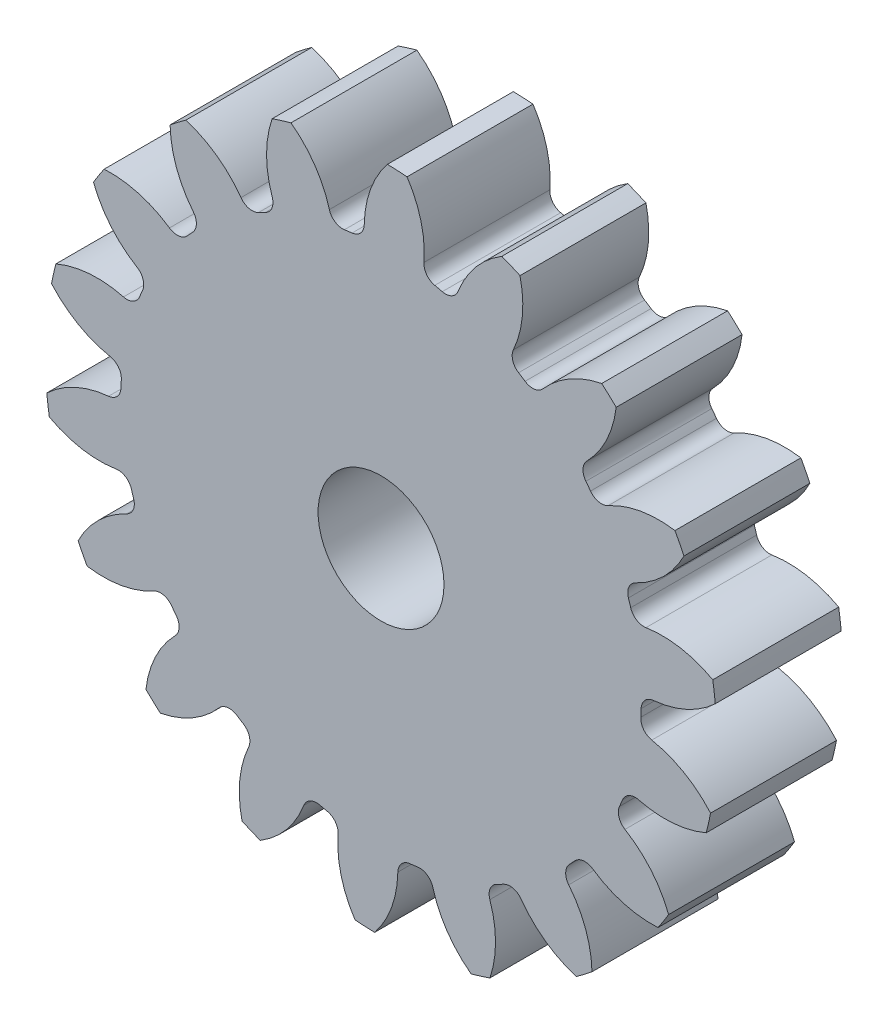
ISO-10303-21;
HEADER;
FILE_DESCRIPTION(('STEP AP214'),'2;1');
FILE_NAME('part.step','',(''),(''),'','','');
FILE_SCHEMA(('AUTOMOTIVE_DESIGN { 1 0 10303 214 1 1 1 1 }'));
ENDSEC;
DATA;
#1=APPLICATION_CONTEXT('core data for automotive mechanical design processes');
#2=APPLICATION_PROTOCOL_DEFINITION('international standard','automotive_design',2000,#1);
#3=PRODUCT_CONTEXT('',#1,'mechanical');
#4=PRODUCT('Part','Part','',(#3));
#5=PRODUCT_RELATED_PRODUCT_CATEGORY('part','',(#4));
#6=PRODUCT_DEFINITION_FORMATION('','',#4);
#7=PRODUCT_DEFINITION_CONTEXT('part definition',#1,'design');
#8=PRODUCT_DEFINITION('design','',#6,#7);
#9=PRODUCT_DEFINITION_SHAPE('','',#8);
#10=(LENGTH_UNIT() NAMED_UNIT(*) SI_UNIT(.MILLI.,.METRE.));
#11=(NAMED_UNIT(*) PLANE_ANGLE_UNIT() SI_UNIT($,.RADIAN.));
#12=(NAMED_UNIT(*) SI_UNIT($,.STERADIAN.) SOLID_ANGLE_UNIT());
#13=UNCERTAINTY_MEASURE_WITH_UNIT(LENGTH_MEASURE(1.E-05),#10,'distance_accuracy_value','');
#14=(GEOMETRIC_REPRESENTATION_CONTEXT(3) GLOBAL_UNCERTAINTY_ASSIGNED_CONTEXT((#13)) GLOBAL_UNIT_ASSIGNED_CONTEXT((#10,
#11,#12)) REPRESENTATION_CONTEXT('',''));
#15=CARTESIAN_POINT('',(0.,0.,0.));
#16=DIRECTION('',(0.,0.,1.));
#17=DIRECTION('',(1.,0.,0.));
#18=AXIS2_PLACEMENT_3D('',#15,#16,#17);
#19=CARTESIAN_POINT('',(0.,0.,127.));
#20=DIRECTION('',(0.,0.,-1.));
#21=DIRECTION('',(-1.,0.,0.));
#22=AXIS2_PLACEMENT_3D('',#19,#20,#21);
#23=CYLINDRICAL_SURFACE('',#22,338.666666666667);
#24=DIRECTION('',(0.,0.,-1.));
#25=VECTOR('',#24,1.);
#26=CARTESIAN_POINT('',(334.572282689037,52.5023691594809,63.5));
#27=LINE('',#26,#25);
#28=CARTESIAN_POINT('',(334.572282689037,52.5023691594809,127.));
#29=VERTEX_POINT('',#28);
#30=CARTESIAN_POINT('',(334.572282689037,52.5023691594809,0.));
#31=VERTEX_POINT('',#30);
#32=EDGE_CURVE('E744',#29,#31,#27,.T.);
#33=ORIENTED_EDGE('',*,*,#32,.F.);
#34=CARTESIAN_POINT('',(0.,0.,127.));
#35=DIRECTION('',(0.,0.,1.));
#36=DIRECTION('',(1.,0.,0.));
#37=AXIS2_PLACEMENT_3D('',#34,#35,#36);
#38=CIRCLE('',#37,338.666666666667);
#39=CARTESIAN_POINT('',(337.076495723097,32.7802858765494,127.));
#40=VERTEX_POINT('',#39);
#41=EDGE_CURVE('E1389',#40,#29,#38,.T.);
#42=ORIENTED_EDGE('',*,*,#41,.F.);
#43=DIRECTION('',(0.,0.,-1.));
#44=VECTOR('',#43,1.);
#45=CARTESIAN_POINT('',(337.076495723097,32.7802858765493,63.5));
#46=LINE('',#45,#44);
#47=CARTESIAN_POINT('',(337.076495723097,32.7802858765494,0.));
#48=VERTEX_POINT('',#47);
#49=EDGE_CURVE('E1383',#48,#40,#46,.F.);
#50=ORIENTED_EDGE('',*,*,#49,.F.);
#51=CARTESIAN_POINT('',(0.,0.,0.));
#52=DIRECTION('',(0.,0.,1.));
#53=DIRECTION('',(1.,0.,0.));
#54=AXIS2_PLACEMENT_3D('',#51,#52,#53);
#55=CIRCLE('',#54,338.666666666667);
#56=EDGE_CURVE('E1394',#48,#31,#55,.T.);
#57=ORIENTED_EDGE('',*,*,#56,.T.);
#58=EDGE_LOOP('',(#33,#42,#50,#57));
#59=FACE_BOUND('',#58,.T.);
#60=ADVANCED_FACE('F33',(#59),#23,.T.);
#61=DIRECTION('',(0.,0.,-1.));
#62=VECTOR('',#61,1.);
#63=CARTESIAN_POINT('',(305.536777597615,146.09034412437,63.5));
#64=LINE('',#63,#62);
#65=CARTESIAN_POINT('',(305.536777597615,146.09034412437,0.));
#66=VERTEX_POINT('',#65);
#67=CARTESIAN_POINT('',(305.536777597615,146.09034412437,127.));
#68=VERTEX_POINT('',#67);
#69=EDGE_CURVE('E715',#66,#68,#64,.F.);
#70=ORIENTED_EDGE('',*,*,#69,.F.);
#71=CARTESIAN_POINT('',(296.438237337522,163.766548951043,0.));
#72=VERTEX_POINT('',#71);
#73=EDGE_CURVE('E1397',#66,#72,#55,.T.);
#74=ORIENTED_EDGE('',*,*,#73,.T.);
#75=DIRECTION('',(0.,0.,-1.));
#76=VECTOR('',#75,1.);
#77=CARTESIAN_POINT('',(296.438237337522,163.766548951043,63.5));
#78=LINE('',#77,#76);
#79=CARTESIAN_POINT('',(296.438237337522,163.766548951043,127.));
#80=VERTEX_POINT('',#79);
#81=EDGE_CURVE('E777',#80,#72,#78,.T.);
#82=ORIENTED_EDGE('',*,*,#81,.F.);
#83=EDGE_CURVE('E1392',#68,#80,#38,.T.);
#84=ORIENTED_EDGE('',*,*,#83,.F.);
#85=EDGE_LOOP('',(#70,#74,#82,#84));
#86=FACE_BOUND('',#85,.T.);
#87=ADVANCED_FACE('F1601',(#86),#23,.T.);
#88=CARTESIAN_POINT('',(0.,0.,127.));
#89=DIRECTION('',(0.,0.,1.));
#90=DIRECTION('',(1.,0.,0.));
#91=AXIS2_PLACEMENT_3D('',#88,#89,#90);
#92=PLANE('',#91);
#93=CARTESIAN_POINT('',(0.,0.,127.000000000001));
#94=DIRECTION('',(0.,0.,1.));
#95=DIRECTION('',(1.,0.,0.));
#96=AXIS2_PLACEMENT_3D('',#93,#94,#95);
#97=CIRCLE('',#96,63.5);
#98=CARTESIAN_POINT('',(63.5,0.,127.000000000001));
#99=VERTEX_POINT('',#98);
#100=EDGE_CURVE('E732',#99,#99,#97,.T.);
#101=ORIENTED_EDGE('',*,*,#100,.F.);
#102=EDGE_LOOP('',(#101));
#103=FACE_BOUND('',#102,.T.);
#104=ORIENTED_EDGE('',*,*,#41,.T.);
#105=CARTESIAN_POINT('',(283.611968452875,-39.9962513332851,127.));
#106=DIRECTION('',(0.,0.,-1.));
#107=DIRECTION('',(0.939692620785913,0.342020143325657,0.));
#108=AXIS2_PLACEMENT_3D('',#105,#106,#107);
#109=CIRCLE('',#108,105.607520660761);
#110=CARTESIAN_POINT('',(267.173255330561,64.3240109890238,127.));
#111=VERTEX_POINT('',#110);
#112=EDGE_CURVE('E724',#111,#29,#109,.T.);
#113=ORIENTED_EDGE('',*,*,#112,.F.);
#114=CARTESIAN_POINT('',(265.02769944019,77.9397333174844,127.));
#115=DIRECTION('',(0.,0.,1.));
#116=DIRECTION('',(-0.939692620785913,-0.342020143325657,0.));
#117=AXIS2_PLACEMENT_3D('',#114,#115,#116);
#118=CIRCLE('',#117,13.7837333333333);
#119=CARTESIAN_POINT('',(251.80393167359,74.0508683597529,127.));
#120=VERTEX_POINT('',#119);
#121=EDGE_CURVE('E722',#120,#111,#118,.T.);
#122=ORIENTED_EDGE('',*,*,#121,.F.);
#123=CARTESIAN_POINT('',(0.,0.,127.));
#124=DIRECTION('',(0.,0.,-1.));
#125=DIRECTION('',(0.939692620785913,0.342020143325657,0.));
#126=AXIS2_PLACEMENT_3D('',#123,#124,#125);
#127=CIRCLE('',#126,262.466666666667);
#128=CARTESIAN_POINT('',(249.499762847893,81.4777236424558,127.));
#129=VERTEX_POINT('',#128);
#130=EDGE_CURVE('E707',#129,#120,#127,.T.);
#131=ORIENTED_EDGE('',*,*,#130,.F.);
#132=CARTESIAN_POINT('',(262.602524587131,85.7566182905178,127.));
#133=DIRECTION('',(0.,0.,1.));
#134=DIRECTION('',(-0.939692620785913,-0.342020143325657,0.));
#135=AXIS2_PLACEMENT_3D('',#132,#133,#134);
#136=CIRCLE('',#135,13.7837333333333);
#137=CARTESIAN_POINT('',(256.664602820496,98.1957657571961,127.));
#138=VERTEX_POINT('',#137);
#139=EDGE_CURVE('E699',#138,#129,#136,.T.);
#140=ORIENTED_EDGE('',*,*,#139,.F.);
#141=CARTESIAN_POINT('',(211.169729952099,193.501405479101,127.));
#142=DIRECTION('',(0.,0.,-1.));
#143=DIRECTION('',(-0.939692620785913,-0.342020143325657,0.));
#144=AXIS2_PLACEMENT_3D('',#141,#142,#143);
#145=CIRCLE('',#144,105.607520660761);
#146=EDGE_CURVE('E729',#68,#138,#145,.T.);
#147=ORIENTED_EDGE('',*,*,#146,.F.);
#148=ORIENTED_EDGE('',*,*,#83,.T.);
#149=CARTESIAN_POINT('',(280.187597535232,59.416823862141,127.));
#150=DIRECTION('',(0.,0.,-1.));
#151=DIRECTION('',(0.766044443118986,0.64278760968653,0.));
#152=AXIS2_PLACEMENT_3D('',#149,#150,#151);
#153=CIRCLE('',#152,105.607520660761);
#154=CARTESIAN_POINT('',(229.060629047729,151.823433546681,127.));
#155=VERTEX_POINT('',#154);
#156=EDGE_CURVE('E753',#155,#80,#153,.T.);
#157=ORIENTED_EDGE('',*,*,#156,.F.);
#158=CARTESIAN_POINT('',(222.387614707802,163.884204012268,127.));
#159=DIRECTION('',(0.,0.,1.));
#160=DIRECTION('',(-0.766044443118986,-0.64278760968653,0.));
#161=AXIS2_PLACEMENT_3D('',#158,#159,#160);
#162=CIRCLE('',#161,13.7837333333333);
#163=CARTESIAN_POINT('',(211.291407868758,155.707071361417,127.));
#164=VERTEX_POINT('',#163);
#165=EDGE_CURVE('E751',#164,#155,#162,.T.);
#166=ORIENTED_EDGE('',*,*,#165,.F.);
#167=CARTESIAN_POINT('',(0.,0.,127.));
#168=DIRECTION('',(0.,0.,-1.));
#169=DIRECTION('',(0.766044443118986,0.64278760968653,0.));
#170=AXIS2_PLACEMENT_3D('',#167,#168,#169);
#171=CIRCLE('',#170,262.466666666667);
#172=CARTESIAN_POINT('',(206.586063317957,161.897960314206,127.));
#173=VERTEX_POINT('',#172);
#174=EDGE_CURVE('E748',#173,#164,#171,.T.);
#175=ORIENTED_EDGE('',*,*,#174,.F.);
#176=CARTESIAN_POINT('',(217.435163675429,170.400214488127,127.));
#177=DIRECTION('',(0.,0.,1.));
#178=DIRECTION('',(-0.766044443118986,-0.64278760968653,0.));
#179=AXIS2_PLACEMENT_3D('',#176,#177,#178);
#180=CIRCLE('',#179,13.7837333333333);
#181=CARTESIAN_POINT('',(207.600903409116,180.058300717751,127.));
#182=VERTEX_POINT('',#181);
#183=EDGE_CURVE('E746',#182,#173,#180,.T.);
#184=ORIENTED_EDGE('',*,*,#183,.F.);
#185=CARTESIAN_POINT('',(132.25325853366,254.056144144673,127.));
#186=DIRECTION('',(0.,0.,-1.));
#187=DIRECTION('',(-0.766044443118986,-0.64278760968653,0.));
#188=AXIS2_PLACEMENT_3D('',#185,#186,#187);
#189=CIRCLE('',#188,105.607520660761);
#190=CARTESIAN_POINT('',(237.144814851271,241.779750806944,127.));
#191=VERTEX_POINT('',#190);
#192=EDGE_CURVE('E756',#191,#182,#189,.T.);
#193=ORIENTED_EDGE('',*,*,#192,.F.);
#194=CARTESIAN_POINT('',(222.549365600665,255.278066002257,127.));
#195=VERTEX_POINT('',#194);
#196=EDGE_CURVE('E1441',#191,#195,#38,.T.);
#197=ORIENTED_EDGE('',*,*,#196,.T.);
#198=CARTESIAN_POINT('',(242.968467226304,151.663353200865,127.));
#199=DIRECTION('',(0.,0.,-1.));
#200=DIRECTION('',(0.50000000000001,0.866025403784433,0.));
#201=AXIS2_PLACEMENT_3D('',#198,#199,#200);
#202=CIRCLE('',#201,105.607520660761);
#203=CARTESIAN_POINT('',(163.319910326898,221.010709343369,127.));
#204=VERTEX_POINT('',#203);
#205=EDGE_CURVE('E788',#204,#195,#202,.T.);
#206=ORIENTED_EDGE('',*,*,#205,.F.);
#207=CARTESIAN_POINT('',(152.924301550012,230.061821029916,127.));
#208=DIRECTION('',(0.,0.,1.));
#209=DIRECTION('',(-0.50000000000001,-0.866025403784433,0.));
#210=AXIS2_PLACEMENT_3D('',#207,#208,#209);
#211=CIRCLE('',#210,13.7837333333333);
#212=CARTESIAN_POINT('',(145.294021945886,218.582703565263,127.));
#213=VERTEX_POINT('',#212);
#214=EDGE_CURVE('E786',#213,#204,#211,.T.);
#215=ORIENTED_EDGE('',*,*,#214,.F.);
#216=CARTESIAN_POINT('',(0.,0.,127.));
#217=DIRECTION('',(0.,0.,-1.));
#218=DIRECTION('',(0.50000000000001,0.866025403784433,0.));
#219=AXIS2_PLACEMENT_3D('',#216,#217,#218);
#220=CIRCLE('',#219,262.466666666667);
#221=CARTESIAN_POINT('',(138.755035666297,222.790913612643,127.));
#222=VERTEX_POINT('',#221);
#223=EDGE_CURVE('E783',#222,#213,#220,.T.);
#224=ORIENTED_EDGE('',*,*,#223,.F.);
#225=CARTESIAN_POINT('',(146.041913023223,234.491029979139,127.));
#226=DIRECTION('',(0.,0.,1.));
#227=DIRECTION('',(-0.50000000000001,-0.866025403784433,0.));
#228=AXIS2_PLACEMENT_3D('',#225,#226,#227);
#229=CIRCLE('',#228,13.7837333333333);
#230=CARTESIAN_POINT('',(133.497471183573,240.203147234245,127.));
#231=VERTEX_POINT('',#230);
#232=EDGE_CURVE('E781',#231,#222,#229,.T.);
#233=ORIENTED_EDGE('',*,*,#232,.F.);
#234=CARTESIAN_POINT('',(37.3850922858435,283.96796235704,127.));
#235=DIRECTION('',(0.,0.,-1.));
#236=DIRECTION('',(-0.50000000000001,-0.866025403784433,0.));
#237=AXIS2_PLACEMENT_3D('',#234,#235,#236);
#238=CIRCLE('',#237,105.607520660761);
#239=CARTESIAN_POINT('',(140.149687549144,308.306951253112,127.));
#240=VERTEX_POINT('',#239);
#241=EDGE_CURVE('E791',#240,#231,#238,.T.);
#242=ORIENTED_EDGE('',*,*,#241,.F.);
#243=CARTESIAN_POINT('',(121.817755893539,315.999280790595,127.));
#244=VERTEX_POINT('',#243);
#245=EDGE_CURVE('E1583',#240,#244,#38,.T.);
#246=ORIENTED_EDGE('',*,*,#245,.T.);
#247=CARTESIAN_POINT('',(176.443753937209,225.617043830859,127.));
#248=DIRECTION('',(0.,0.,-1.));
#249=DIRECTION('',(0.17364817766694,0.984807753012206,0.));
#250=AXIS2_PLACEMENT_3D('',#247,#248,#249);
#251=CIRCLE('',#250,105.607520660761);
#252=CARTESIAN_POINT('',(77.8804000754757,263.540831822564,127.));
#253=VERTEX_POINT('',#252);
#254=EDGE_CURVE('E826',#253,#244,#251,.T.);
#255=ORIENTED_EDGE('',*,*,#254,.F.);
#256=CARTESIAN_POINT('',(65.0160607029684,268.490587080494,127.));
#257=DIRECTION('',(0.,0.,1.));
#258=DIRECTION('',(-0.17364817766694,-0.984807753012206,0.));
#259=AXIS2_PLACEMENT_3D('',#256,#257,#258);
#260=CIRCLE('',#259,13.7837333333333);
#261=CARTESIAN_POINT('',(61.772032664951,255.094035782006,127.));
#262=VERTEX_POINT('',#261);
#263=EDGE_CURVE('E824',#262,#253,#260,.T.);
#264=ORIENTED_EDGE('',*,*,#263,.F.);
#265=CARTESIAN_POINT('',(0.,0.,127.));
#266=DIRECTION('',(0.,0.,-1.));
#267=DIRECTION('',(0.17364817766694,0.984807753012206,0.));
#268=AXIS2_PLACEMENT_3D('',#265,#266,#267);
#269=CIRCLE('',#268,262.466666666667);
#270=CARTESIAN_POINT('',(54.1881029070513,256.811994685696,127.));
#271=VERTEX_POINT('',#270);
#272=EDGE_CURVE('E821',#271,#262,#269,.T.);
#273=ORIENTED_EDGE('',*,*,#272,.F.);
#274=CARTESIAN_POINT('',(57.0338523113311,270.298766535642,127.));
#275=DIRECTION('',(0.,0.,1.));
#276=DIRECTION('',(-0.17364817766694,-0.984807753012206,0.));
#277=AXIS2_PLACEMENT_3D('',#274,#275,#276);
#278=CIRCLE('',#277,13.7837333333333);
#279=CARTESIAN_POINT('',(43.2922737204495,271.375949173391,127.));
#280=VERTEX_POINT('',#279);
#281=EDGE_CURVE('E819',#280,#271,#278,.T.);
#282=ORIENTED_EDGE('',*,*,#281,.F.);
#283=CARTESIAN_POINT('',(-61.9922678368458,279.629053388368,127.));
#284=DIRECTION('',(0.,0.,-1.));
#285=DIRECTION('',(-0.17364817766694,-0.984807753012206,0.));
#286=AXIS2_PLACEMENT_3D('',#283,#284,#285);
#287=CIRCLE('',#286,105.607520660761);
#288=CARTESIAN_POINT('',(26.2504395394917,337.647783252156,127.));
#289=VERTEX_POINT('',#288);
#290=EDGE_CURVE('E829',#289,#280,#287,.T.);
#291=ORIENTED_EDGE('',*,*,#290,.F.);
#292=CARTESIAN_POINT('',(6.39312698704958,338.606318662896,127.));
#293=VERTEX_POINT('',#292);
#294=EDGE_CURVE('E1579',#289,#293,#38,.T.);
#295=ORIENTED_EDGE('',*,*,#294,.T.);
#296=CARTESIAN_POINT('',(88.637319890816,272.357989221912,127.));
#297=DIRECTION('',(0.,0.,-1.));
#298=DIRECTION('',(-0.173648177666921,0.98480775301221,0.));
#299=AXIS2_PLACEMENT_3D('',#296,#297,#298);
#300=CIRCLE('',#299,105.607520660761);
#301=CARTESIAN_POINT('',(-16.9526358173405,274.284040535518,127.));
#302=VERTEX_POINT('',#301);
#303=EDGE_CURVE('E864',#302,#293,#300,.T.);
#304=ORIENTED_EDGE('',*,*,#303,.F.);
#305=CARTESIAN_POINT('',(-30.7340765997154,274.535425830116,127.));
#306=DIRECTION('',(0.,0.,1.));
#307=DIRECTION('',(0.173648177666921,-0.98480775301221,0.));
#308=AXIS2_PLACEMENT_3D('',#305,#306,#307);
#309=CIRCLE('',#308,13.7837333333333);
#310=CARTESIAN_POINT('',(-29.2005754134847,260.837262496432,127.));
#311=VERTEX_POINT('',#310);
#312=EDGE_CURVE('E862',#311,#302,#309,.T.);
#313=ORIENTED_EDGE('',*,*,#312,.F.);
#314=CARTESIAN_POINT('',(0.,0.,127.));
#315=DIRECTION('',(0.,0.,-1.));
#316=DIRECTION('',(-0.173648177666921,0.98480775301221,0.));
#317=AXIS2_PLACEMENT_3D('',#314,#315,#316);
#318=CIRCLE('',#317,262.466666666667);
#319=CARTESIAN_POINT('',(-36.9147147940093,259.857759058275,127.));
#320=VERTEX_POINT('',#319);
#321=EDGE_CURVE('E859',#320,#311,#318,.T.);
#322=ORIENTED_EDGE('',*,*,#321,.F.);
#323=CARTESIAN_POINT('',(-38.8533327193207,273.504482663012,127.));
#324=DIRECTION('',(0.,0.,1.));
#325=DIRECTION('',(0.173648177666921,-0.98480775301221,0.));
#326=AXIS2_PLACEMENT_3D('',#323,#324,#325);
#327=CIRCLE('',#326,13.7837333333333);
#328=CARTESIAN_POINT('',(-52.1346108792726,269.816806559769,127.));
#329=VERTEX_POINT('',#328);
#330=EDGE_CURVE('E857',#329,#320,#327,.T.);
#331=ORIENTED_EDGE('',*,*,#330,.F.);
#332=CARTESIAN_POINT('',(-153.892445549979,241.562753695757,127.));
#333=DIRECTION('',(0.,0.,-1.));
#334=DIRECTION('',(0.173648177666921,-0.98480775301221,0.));
#335=AXIS2_PLACEMENT_3D('',#332,#333,#334);
#336=CIRCLE('',#335,105.607520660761);
#337=CARTESIAN_POINT('',(-90.8149988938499,326.263309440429,127.));
#338=VERTEX_POINT('',#337);
#339=EDGE_CURVE('E867',#338,#329,#336,.T.);
#340=ORIENTED_EDGE('',*,*,#339,.F.);
#341=CARTESIAN_POINT('',(-109.802607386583,320.372437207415,127.));
#342=VERTEX_POINT('',#341);
#343=EDGE_CURVE('E1575',#338,#342,#38,.T.);
#344=ORIENTED_EDGE('',*,*,#343,.T.);
#345=CARTESIAN_POINT('',(-9.86008308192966,286.248541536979,127.));
#346=DIRECTION('',(0.,0.,-1.));
#347=DIRECTION('',(-0.499999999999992,0.866025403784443,0.));
#348=AXIS2_PLACEMENT_3D('',#345,#346,#347);
#349=CIRCLE('',#348,105.607520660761);
#350=CARTESIAN_POINT('',(-109.740933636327,251.944545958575,127.));
#351=VERTEX_POINT('',#350);
#352=EDGE_CURVE('E902',#351,#342,#349,.T.);
#353=ORIENTED_EDGE('',*,*,#352,.F.);
#354=CARTESIAN_POINT('',(-122.777230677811,247.46724051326,127.));
#355=DIRECTION('',(0.,0.,1.));
#356=DIRECTION('',(0.499999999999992,-0.866025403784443,0.));
#357=AXIS2_PLACEMENT_3D('',#354,#355,#356);
#358=CIRCLE('',#357,13.7837333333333);
#359=CARTESIAN_POINT('',(-116.651163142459,235.119665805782,127.));
#360=VERTEX_POINT('',#359);
#361=EDGE_CURVE('E900',#360,#351,#358,.T.);
#362=ORIENTED_EDGE('',*,*,#361,.F.);
#363=CARTESIAN_POINT('',(0.,0.,127.));
#364=DIRECTION('',(0.,0.,-1.));
#365=DIRECTION('',(-0.499999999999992,0.866025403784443,0.));
#366=AXIS2_PLACEMENT_3D('',#363,#364,#365);
#367=CIRCLE('',#366,262.466666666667);
#368=CARTESIAN_POINT('',(-123.565073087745,231.56084259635,127.));
#369=VERTEX_POINT('',#368);
#370=EDGE_CURVE('E897',#369,#360,#367,.T.);
#371=ORIENTED_EDGE('',*,*,#370,.F.);
#372=CARTESIAN_POINT('',(-130.054232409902,243.721521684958,127.));
#373=DIRECTION('',(0.,0.,1.));
#374=DIRECTION('',(0.499999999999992,-0.866025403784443,0.));
#375=AXIS2_PLACEMENT_3D('',#372,#373,#374);
#376=CIRCLE('',#375,13.7837333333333);
#377=CARTESIAN_POINT('',(-141.273291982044,235.713775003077,127.));
#378=VERTEX_POINT('',#377);
#379=EDGE_CURVE('E895',#378,#369,#376,.T.);
#380=ORIENTED_EDGE('',*,*,#379,.F.);
#381=CARTESIAN_POINT('',(-227.230923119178,174.360420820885,127.));
#382=DIRECTION('',(0.,0.,-1.));
#383=DIRECTION('',(0.499999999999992,-0.866025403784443,0.));
#384=AXIS2_PLACEMENT_3D('',#381,#382,#383);
#385=CIRCLE('',#384,105.607520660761);
#386=CARTESIAN_POINT('',(-196.926808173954,275.526665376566,127.));
#387=VERTEX_POINT('',#386);
#388=EDGE_CURVE('E905',#387,#378,#385,.T.);
#389=ORIENTED_EDGE('',*,*,#388,.F.);
#390=CARTESIAN_POINT('',(-212.754526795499,263.496911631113,127.));
#391=VERTEX_POINT('',#390);
#392=EDGE_CURVE('E1571',#387,#391,#38,.T.);
#393=ORIENTED_EDGE('',*,*,#392,.T.);
#394=CARTESIAN_POINT('',(-107.168214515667,265.613295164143,127.));
#395=DIRECTION('',(0.,0.,-1.));
#396=DIRECTION('',(-0.766044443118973,0.642787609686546,0.));
#397=AXIS2_PLACEMENT_3D('',#394,#395,#396);
#398=CIRCLE('',#397,105.607520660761);
#399=CARTESIAN_POINT('',(-189.292855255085,199.216820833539,127.));
#400=VERTEX_POINT('',#399);
#401=EDGE_CURVE('E940',#400,#391,#398,.T.);
#402=ORIENTED_EDGE('',*,*,#401,.F.);
#403=CARTESIAN_POINT('',(-200.011638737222,190.550853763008,127.));
#404=DIRECTION('',(0.,0.,1.));
#405=DIRECTION('',(0.766044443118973,-0.642787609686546,0.));
#406=AXIS2_PLACEMENT_3D('',#403,#404,#405);
#407=CIRCLE('',#406,13.7837333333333);
#408=CARTESIAN_POINT('',(-190.031899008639,181.043167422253,127.));
#409=VERTEX_POINT('',#408);
#410=EDGE_CURVE('E938',#409,#400,#407,.T.);
#411=ORIENTED_EDGE('',*,*,#410,.F.);
#412=CARTESIAN_POINT('',(0.,0.,127.));
#413=DIRECTION('',(0.,0.,-1.));
#414=DIRECTION('',(-0.766044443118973,0.642787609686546,0.));
#415=AXIS2_PLACEMENT_3D('',#412,#413,#414);
#416=CIRCLE('',#415,262.466666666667);
#417=CARTESIAN_POINT('',(-195.311659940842,175.33427104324,127.));
#418=VERTEX_POINT('',#417);
#419=EDGE_CURVE('E935',#418,#409,#416,.T.);
#420=ORIENTED_EDGE('',*,*,#419,.F.);
#421=CARTESIAN_POINT('',(-205.5686722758,184.542148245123,127.));
#422=DIRECTION('',(0.,0.,1.));
#423=DIRECTION('',(0.766044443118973,-0.642787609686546,0.));
#424=AXIS2_PLACEMENT_3D('',#421,#422,#423);
#425=CIRCLE('',#424,13.7837333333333);
#426=CARTESIAN_POINT('',(-213.372329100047,173.180183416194,127.));
#427=VERTEX_POINT('',#426);
#428=EDGE_CURVE('E933',#427,#418,#425,.T.);
#429=ORIENTED_EDGE('',*,*,#428,.F.);
#430=CARTESIAN_POINT('',(-273.161997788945,86.1276479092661,127.));
#431=DIRECTION('',(0.,0.,-1.));
#432=DIRECTION('',(0.766044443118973,-0.642787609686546,0.));
#433=AXIS2_PLACEMENT_3D('',#430,#431,#432);
#434=CIRCLE('',#433,105.607520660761);
#435=CARTESIAN_POINT('',(-279.286338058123,191.557439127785,127.));
#436=VERTEX_POINT('',#435);
#437=EDGE_CURVE('E943',#436,#427,#434,.T.);
#438=ORIENTED_EDGE('',*,*,#437,.F.);
#439=CARTESIAN_POINT('',(-290.045110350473,174.839769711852,127.));
#440=VERTEX_POINT('',#439);
#441=EDGE_CURVE('E1567',#436,#440,#38,.T.);
#442=ORIENTED_EDGE('',*,*,#441,.T.);
#443=CARTESIAN_POINT('',(-191.550277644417,212.94116535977,127.));
#444=DIRECTION('',(0.,0.,-1.));
#445=DIRECTION('',(-0.939692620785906,0.342020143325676,0.));
#446=AXIS2_PLACEMENT_3D('',#443,#444,#445);
#447=CIRCLE('',#446,105.607520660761);
#448=CARTESIAN_POINT('',(-246.01326486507,122.460606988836,127.));
#449=VERTEX_POINT('',#448);
#450=EDGE_CURVE('E978',#449,#440,#447,.T.);
#451=ORIENTED_EDGE('',*,*,#450,.F.);
#452=CARTESIAN_POINT('',(-253.121691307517,110.651221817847,127.));
#453=DIRECTION('',(0.,0.,1.));
#454=DIRECTION('',(0.939692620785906,-0.342020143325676,0.));
#455=AXIS2_PLACEMENT_3D('',#452,#453,#454);
#456=CIRCLE('',#455,13.7837333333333);
#457=CARTESIAN_POINT('',(-240.491983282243,105.130191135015,127.));
#458=VERTEX_POINT('',#457);
#459=EDGE_CURVE('E976',#458,#449,#456,.T.);
#460=ORIENTED_EDGE('',*,*,#459,.F.);
#461=CARTESIAN_POINT('',(0.,0.,127.));
#462=DIRECTION('',(0.,0.,-1.));
#463=DIRECTION('',(-0.939692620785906,0.342020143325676,0.));
#464=AXIS2_PLACEMENT_3D('',#461,#462,#463);
#465=CIRCLE('',#464,262.466666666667);
#466=CARTESIAN_POINT('',(-243.500778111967,97.9597987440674,127.));
#467=VERTEX_POINT('',#466);
#468=EDGE_CURVE('E973',#467,#458,#465,.T.);
#469=ORIENTED_EDGE('',*,*,#468,.F.);
#470=CARTESIAN_POINT('',(-256.28849639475,103.104268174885,127.));
#471=DIRECTION('',(0.,0.,1.));
#472=DIRECTION('',(0.939692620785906,-0.342020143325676,0.));
#473=AXIS2_PLACEMENT_3D('',#470,#471,#472);
#474=CIRCLE('',#473,13.7837333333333);
#475=CARTESIAN_POINT('',(-259.735514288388,89.7585058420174,127.));
#476=VERTEX_POINT('',#475);
#477=EDGE_CURVE('E971',#476,#467,#474,.T.);
#478=ORIENTED_EDGE('',*,*,#477,.F.);
#479=CARTESIAN_POINT('',(-286.145704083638,-12.493390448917,127.));
#480=DIRECTION('',(0.,0.,-1.));
#481=DIRECTION('',(0.939692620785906,-0.342020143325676,0.));
#482=AXIS2_PLACEMENT_3D('',#479,#480,#481);
#483=CIRCLE('',#482,105.607520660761);
#484=CARTESIAN_POINT('',(-327.95981374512,84.4835586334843,127.));
#485=VERTEX_POINT('',#484);
#486=EDGE_CURVE('E981',#485,#476,#483,.T.);
#487=ORIENTED_EDGE('',*,*,#486,.F.);
#488=CARTESIAN_POINT('',(-332.351972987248,65.0943712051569,127.));
#489=VERTEX_POINT('',#488);
#490=EDGE_CURVE('E1563',#485,#489,#38,.T.);
#491=ORIENTED_EDGE('',*,*,#490,.T.);
#492=CARTESIAN_POINT('',(-252.828550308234,134.585188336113,127.));
#493=DIRECTION('',(0.,0.,-1.));
#494=DIRECTION('',(-1.,0.,0.));
#495=AXIS2_PLACEMENT_3D('',#492,#493,#494);
#496=CIRCLE('',#495,105.607520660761);
#497=CARTESIAN_POINT('',(-273.060843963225,30.933836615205,127.));
#498=VERTEX_POINT('',#497);
#499=EDGE_CURVE('E1016',#498,#489,#496,.T.);
#500=ORIENTED_EDGE('',*,*,#499,.F.);
#501=CARTESIAN_POINT('',(-275.701532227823,17.4054194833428,127.));
#502=DIRECTION('',(0.,0.,1.));
#503=DIRECTION('',(1.,0.,0.));
#504=AXIS2_PLACEMENT_3D('',#501,#502,#503);
#505=CIRCLE('',#504,13.7837333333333);
#506=CARTESIAN_POINT('',(-261.945185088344,16.5369622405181,127.));
#507=VERTEX_POINT('',#506);
#508=EDGE_CURVE('E1014',#507,#498,#505,.T.);
#509=ORIENTED_EDGE('',*,*,#508,.F.);
#510=CARTESIAN_POINT('',(0.,0.,127.));
#511=DIRECTION('',(0.,0.,-1.));
#512=DIRECTION('',(-1.,0.,0.));
#513=AXIS2_PLACEMENT_3D('',#510,#511,#512);
#514=CIRCLE('',#513,262.466666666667);
#515=CARTESIAN_POINT('',(-262.320108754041,8.76992898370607,127.));
#516=VERTEX_POINT('',#515);
#517=EDGE_CURVE('E1011',#516,#507,#514,.T.);
#518=ORIENTED_EDGE('',*,*,#517,.F.);
#519=CARTESIAN_POINT('',(-276.096145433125,9.23049170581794,127.));
#520=DIRECTION('',(0.,0.,1.));
#521=DIRECTION('',(1.,0.,0.));
#522=AXIS2_PLACEMENT_3D('',#519,#520,#521);
#523=CIRCLE('',#522,13.7837333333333);
#524=CARTESIAN_POINT('',(-274.770763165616,-4.48937223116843,127.));
#525=VERTEX_POINT('',#524);
#526=EDGE_CURVE('E1009',#525,#516,#523,.T.);
#527=ORIENTED_EDGE('',*,*,#526,.F.);
#528=CARTESIAN_POINT('',(-264.616015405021,-109.607541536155,127.));
#529=DIRECTION('',(0.,0.,-1.));
#530=DIRECTION('',(1.,0.,0.));
#531=AXIS2_PLACEMENT_3D('',#528,#529,#530);
#532=CIRCLE('',#531,105.607520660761);
#533=CARTESIAN_POINT('',(-337.076495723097,-32.780285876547,127.));
#534=VERTEX_POINT('',#533);
#535=EDGE_CURVE('E1019',#534,#525,#532,.T.);
#536=ORIENTED_EDGE('',*,*,#535,.F.);
#537=CARTESIAN_POINT('',(-334.572282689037,-52.5023691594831,127.));
#538=VERTEX_POINT('',#537);
#539=EDGE_CURVE('E1559',#534,#538,#38,.T.);
#540=ORIENTED_EDGE('',*,*,#539,.T.);
#541=CARTESIAN_POINT('',(-283.611968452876,39.9962513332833,127.));
#542=DIRECTION('',(0.,0.,-1.));
#543=DIRECTION('',(-0.939692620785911,-0.342020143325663,0.));
#544=AXIS2_PLACEMENT_3D('',#541,#542,#543);
#545=CIRCLE('',#544,105.607520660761);
#546=CARTESIAN_POINT('',(-267.17325533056,-64.3240109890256,127.));
#547=VERTEX_POINT('',#546);
#548=EDGE_CURVE('E1054',#547,#538,#545,.T.);
#549=ORIENTED_EDGE('',*,*,#548,.F.);
#550=CARTESIAN_POINT('',(-265.02769944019,-77.9397333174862,127.));
#551=DIRECTION('',(0.,0.,1.));
#552=DIRECTION('',(0.939692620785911,0.342020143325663,0.));
#553=AXIS2_PLACEMENT_3D('',#550,#551,#552);
#554=CIRCLE('',#553,13.7837333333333);
#555=CARTESIAN_POINT('',(-251.803931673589,-74.0508683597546,127.));
#556=VERTEX_POINT('',#555);
#557=EDGE_CURVE('E1052',#556,#547,#554,.T.);
#558=ORIENTED_EDGE('',*,*,#557,.F.);
#559=CARTESIAN_POINT('',(0.,0.,127.));
#560=DIRECTION('',(0.,0.,-1.));
#561=DIRECTION('',(-0.939692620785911,-0.342020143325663,0.));
#562=AXIS2_PLACEMENT_3D('',#559,#560,#561);
#563=CIRCLE('',#562,262.466666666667);
#564=CARTESIAN_POINT('',(-249.499762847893,-81.4777236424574,127.));
#565=VERTEX_POINT('',#564);
#566=EDGE_CURVE('E1049',#565,#556,#563,.T.);
#567=ORIENTED_EDGE('',*,*,#566,.F.);
#568=CARTESIAN_POINT('',(-262.60252458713,-85.7566182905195,127.));
#569=DIRECTION('',(0.,0.,1.));
#570=DIRECTION('',(0.939692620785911,0.342020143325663,0.));
#571=AXIS2_PLACEMENT_3D('',#568,#569,#570);
#572=CIRCLE('',#571,13.7837333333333);
#573=CARTESIAN_POINT('',(-256.664602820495,-98.1957657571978,127.));
#574=VERTEX_POINT('',#573);
#575=EDGE_CURVE('E1047',#574,#565,#572,.T.);
#576=ORIENTED_EDGE('',*,*,#575,.F.);
#577=CARTESIAN_POINT('',(-211.169729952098,-193.501405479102,127.));
#578=DIRECTION('',(0.,0.,-1.));
#579=DIRECTION('',(0.939692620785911,0.342020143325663,0.));
#580=AXIS2_PLACEMENT_3D('',#577,#578,#579);
#581=CIRCLE('',#580,105.607520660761);
#582=CARTESIAN_POINT('',(-305.536777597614,-146.090344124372,127.));
#583=VERTEX_POINT('',#582);
#584=EDGE_CURVE('E1057',#583,#574,#581,.T.);
#585=ORIENTED_EDGE('',*,*,#584,.F.);
#586=CARTESIAN_POINT('',(-296.438237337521,-163.766548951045,127.));
#587=VERTEX_POINT('',#586);
#588=EDGE_CURVE('E1555',#583,#587,#38,.T.);
#589=ORIENTED_EDGE('',*,*,#588,.T.);
#590=CARTESIAN_POINT('',(-280.187597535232,-59.416823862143,127.));
#591=DIRECTION('',(0.,0.,-1.));
#592=DIRECTION('',(-0.766044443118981,-0.642787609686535,0.));
#593=AXIS2_PLACEMENT_3D('',#590,#591,#592);
#594=CIRCLE('',#593,105.607520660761);
#595=CARTESIAN_POINT('',(-229.060629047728,-151.823433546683,127.));
#596=VERTEX_POINT('',#595);
#597=EDGE_CURVE('E1092',#596,#587,#594,.T.);
#598=ORIENTED_EDGE('',*,*,#597,.F.);
#599=CARTESIAN_POINT('',(-222.3876147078,-163.884204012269,127.));
#600=DIRECTION('',(0.,0.,1.));
#601=DIRECTION('',(0.766044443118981,0.642787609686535,0.));
#602=AXIS2_PLACEMENT_3D('',#599,#600,#601);
#603=CIRCLE('',#602,13.7837333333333);
#604=CARTESIAN_POINT('',(-211.291407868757,-155.707071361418,127.));
#605=VERTEX_POINT('',#604);
#606=EDGE_CURVE('E1090',#605,#596,#603,.T.);
#607=ORIENTED_EDGE('',*,*,#606,.F.);
#608=CARTESIAN_POINT('',(0.,0.,127.));
#609=DIRECTION('',(0.,0.,-1.));
#610=DIRECTION('',(-0.766044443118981,-0.642787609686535,0.));
#611=AXIS2_PLACEMENT_3D('',#608,#609,#610);
#612=CIRCLE('',#611,262.466666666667);
#613=CARTESIAN_POINT('',(-206.586063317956,-161.897960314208,127.));
#614=VERTEX_POINT('',#613);
#615=EDGE_CURVE('E1087',#614,#605,#612,.T.);
#616=ORIENTED_EDGE('',*,*,#615,.F.);
#617=CARTESIAN_POINT('',(-217.435163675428,-170.400214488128,127.));
#618=DIRECTION('',(0.,0.,1.));
#619=DIRECTION('',(0.766044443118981,0.642787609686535,0.));
#620=AXIS2_PLACEMENT_3D('',#617,#618,#619);
#621=CIRCLE('',#620,13.7837333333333);
#622=CARTESIAN_POINT('',(-207.600903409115,-180.058300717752,127.));
#623=VERTEX_POINT('',#622);
#624=EDGE_CURVE('E1085',#623,#614,#621,.T.);
#625=ORIENTED_EDGE('',*,*,#624,.F.);
#626=CARTESIAN_POINT('',(-132.253258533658,-254.056144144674,127.));
#627=DIRECTION('',(0.,0.,-1.));
#628=DIRECTION('',(0.766044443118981,0.642787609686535,0.));
#629=AXIS2_PLACEMENT_3D('',#626,#627,#628);
#630=CIRCLE('',#629,105.607520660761);
#631=CARTESIAN_POINT('',(-237.144814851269,-241.779750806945,127.));
#632=VERTEX_POINT('',#631);
#633=EDGE_CURVE('E1095',#632,#623,#630,.T.);
#634=ORIENTED_EDGE('',*,*,#633,.F.);
#635=CARTESIAN_POINT('',(-222.549365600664,-255.278066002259,127.));
#636=VERTEX_POINT('',#635);
#637=EDGE_CURVE('E1551',#632,#636,#38,.T.);
#638=ORIENTED_EDGE('',*,*,#637,.T.);
#639=CARTESIAN_POINT('',(-242.968467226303,-151.663353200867,127.));
#640=DIRECTION('',(0.,0.,-1.));
#641=DIRECTION('',(-0.500000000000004,-0.866025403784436,0.));
#642=AXIS2_PLACEMENT_3D('',#639,#640,#641);
#643=CIRCLE('',#642,105.607520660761);
#644=CARTESIAN_POINT('',(-163.319910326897,-221.01070934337,127.));
#645=VERTEX_POINT('',#644);
#646=EDGE_CURVE('E1130',#645,#636,#643,.T.);
#647=ORIENTED_EDGE('',*,*,#646,.F.);
#648=CARTESIAN_POINT('',(-152.92430155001,-230.061821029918,127.));
#649=DIRECTION('',(0.,0.,1.));
#650=DIRECTION('',(0.500000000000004,0.866025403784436,0.));
#651=AXIS2_PLACEMENT_3D('',#648,#649,#650);
#652=CIRCLE('',#651,13.7837333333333);
#653=CARTESIAN_POINT('',(-145.294021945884,-218.582703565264,127.));
#654=VERTEX_POINT('',#653);
#655=EDGE_CURVE('E1128',#654,#645,#652,.T.);
#656=ORIENTED_EDGE('',*,*,#655,.F.);
#657=CARTESIAN_POINT('',(0.,0.,127.));
#658=DIRECTION('',(0.,0.,-1.));
#659=DIRECTION('',(-0.500000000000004,-0.866025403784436,0.));
#660=AXIS2_PLACEMENT_3D('',#657,#658,#659);
#661=CIRCLE('',#660,262.466666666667);
#662=CARTESIAN_POINT('',(-138.755035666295,-222.790913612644,127.));
#663=VERTEX_POINT('',#662);
#664=EDGE_CURVE('E1125',#663,#654,#661,.T.);
#665=ORIENTED_EDGE('',*,*,#664,.F.);
#666=CARTESIAN_POINT('',(-146.041913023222,-234.49102997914,127.));
#667=DIRECTION('',(0.,0.,1.));
#668=DIRECTION('',(0.500000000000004,0.866025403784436,0.));
#669=AXIS2_PLACEMENT_3D('',#666,#667,#668);
#670=CIRCLE('',#669,13.7837333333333);
#671=CARTESIAN_POINT('',(-133.497471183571,-240.203147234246,127.));
#672=VERTEX_POINT('',#671);
#673=EDGE_CURVE('E1123',#672,#663,#670,.T.);
#674=ORIENTED_EDGE('',*,*,#673,.F.);
#675=CARTESIAN_POINT('',(-37.3850922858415,-283.96796235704,127.));
#676=DIRECTION('',(0.,0.,-1.));
#677=DIRECTION('',(0.500000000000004,0.866025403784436,0.));
#678=AXIS2_PLACEMENT_3D('',#675,#676,#677);
#679=CIRCLE('',#678,105.607520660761);
#680=CARTESIAN_POINT('',(-140.149687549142,-308.306951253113,127.));
#681=VERTEX_POINT('',#680);
#682=EDGE_CURVE('E1133',#681,#672,#679,.T.);
#683=ORIENTED_EDGE('',*,*,#682,.F.);
#684=CARTESIAN_POINT('',(-121.817755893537,-315.999280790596,127.));
#685=VERTEX_POINT('',#684);
#686=EDGE_CURVE('E1547',#681,#685,#38,.T.);
#687=ORIENTED_EDGE('',*,*,#686,.T.);
#688=CARTESIAN_POINT('',(-176.443753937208,-225.61704383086,127.));
#689=DIRECTION('',(0.,0.,-1.));
#690=DIRECTION('',(-0.173648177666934,-0.984807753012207,0.));
#691=AXIS2_PLACEMENT_3D('',#688,#689,#690);
#692=CIRCLE('',#691,105.607520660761);
#693=CARTESIAN_POINT('',(-77.880400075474,-263.540831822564,127.));
#694=VERTEX_POINT('',#693);
#695=EDGE_CURVE('E1168',#694,#685,#692,.T.);
#696=ORIENTED_EDGE('',*,*,#695,.F.);
#697=CARTESIAN_POINT('',(-65.0160607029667,-268.490587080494,127.));
#698=DIRECTION('',(0.,0.,1.));
#699=DIRECTION('',(0.173648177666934,0.984807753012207,0.));
#700=AXIS2_PLACEMENT_3D('',#697,#698,#699);
#701=CIRCLE('',#700,13.7837333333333);
#702=CARTESIAN_POINT('',(-61.7720326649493,-255.094035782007,127.));
#703=VERTEX_POINT('',#702);
#704=EDGE_CURVE('E1166',#703,#694,#701,.T.);
#705=ORIENTED_EDGE('',*,*,#704,.F.);
#706=CARTESIAN_POINT('',(0.,0.,127.));
#707=DIRECTION('',(0.,0.,-1.));
#708=DIRECTION('',(-0.173648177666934,-0.984807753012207,0.));
#709=AXIS2_PLACEMENT_3D('',#706,#707,#708);
#710=CIRCLE('',#709,262.466666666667);
#711=CARTESIAN_POINT('',(-54.1881029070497,-256.811994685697,127.));
#712=VERTEX_POINT('',#711);
#713=EDGE_CURVE('E1163',#712,#703,#710,.T.);
#714=ORIENTED_EDGE('',*,*,#713,.F.);
#715=CARTESIAN_POINT('',(-57.0338523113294,-270.298766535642,127.));
#716=DIRECTION('',(0.,0.,1.));
#717=DIRECTION('',(0.173648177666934,0.984807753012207,0.));
#718=AXIS2_PLACEMENT_3D('',#715,#716,#717);
#719=CIRCLE('',#718,13.7837333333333);
#720=CARTESIAN_POINT('',(-43.2922737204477,-271.375949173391,127.));
#721=VERTEX_POINT('',#720);
#722=EDGE_CURVE('E1161',#721,#712,#719,.T.);
#723=ORIENTED_EDGE('',*,*,#722,.F.);
#724=CARTESIAN_POINT('',(61.9922678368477,-279.629053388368,127.));
#725=DIRECTION('',(0.,0.,-1.));
#726=DIRECTION('',(0.173648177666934,0.984807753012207,0.));
#727=AXIS2_PLACEMENT_3D('',#724,#725,#726);
#728=CIRCLE('',#727,105.607520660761);
#729=CARTESIAN_POINT('',(-26.2504395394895,-337.647783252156,127.));
#730=VERTEX_POINT('',#729);
#731=EDGE_CURVE('E1171',#730,#721,#728,.T.);
#732=ORIENTED_EDGE('',*,*,#731,.F.);
#733=CARTESIAN_POINT('',(-6.39312698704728,-338.606318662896,127.));
#734=VERTEX_POINT('',#733);
#735=EDGE_CURVE('E1543',#730,#734,#38,.T.);
#736=ORIENTED_EDGE('',*,*,#735,.T.);
#737=CARTESIAN_POINT('',(-88.6373198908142,-272.357989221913,127.));
#738=DIRECTION('',(0.,0.,-1.));
#739=DIRECTION('',(0.173648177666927,-0.984807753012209,0.));
#740=AXIS2_PLACEMENT_3D('',#737,#738,#739);
#741=CIRCLE('',#740,105.607520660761);
#742=CARTESIAN_POINT('',(16.9526358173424,-274.284040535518,127.));
#743=VERTEX_POINT('',#742);
#744=EDGE_CURVE('E1206',#743,#734,#741,.T.);
#745=ORIENTED_EDGE('',*,*,#744,.F.);
#746=CARTESIAN_POINT('',(30.7340765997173,-274.535425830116,127.));
#747=DIRECTION('',(0.,0.,1.));
#748=DIRECTION('',(-0.173648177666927,0.984807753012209,0.));
#749=AXIS2_PLACEMENT_3D('',#746,#747,#748);
#750=CIRCLE('',#749,13.7837333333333);
#751=CARTESIAN_POINT('',(29.2005754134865,-260.837262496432,127.));
#752=VERTEX_POINT('',#751);
#753=EDGE_CURVE('E1204',#752,#743,#750,.T.);
#754=ORIENTED_EDGE('',*,*,#753,.F.);
#755=CARTESIAN_POINT('',(0.,0.,127.));
#756=DIRECTION('',(0.,0.,-1.));
#757=DIRECTION('',(0.173648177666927,-0.984807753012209,0.));
#758=AXIS2_PLACEMENT_3D('',#755,#756,#757);
#759=CIRCLE('',#758,262.466666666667);
#760=CARTESIAN_POINT('',(36.9147147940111,-259.857759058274,127.));
#761=VERTEX_POINT('',#760);
#762=EDGE_CURVE('E1201',#761,#752,#759,.T.);
#763=ORIENTED_EDGE('',*,*,#762,.F.);
#764=CARTESIAN_POINT('',(38.8533327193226,-273.504482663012,127.));
#765=DIRECTION('',(0.,0.,1.));
#766=DIRECTION('',(-0.173648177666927,0.984807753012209,0.));
#767=AXIS2_PLACEMENT_3D('',#764,#765,#766);
#768=CIRCLE('',#767,13.7837333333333);
#769=CARTESIAN_POINT('',(52.1346108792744,-269.816806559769,127.));
#770=VERTEX_POINT('',#769);
#771=EDGE_CURVE('E1199',#770,#761,#768,.T.);
#772=ORIENTED_EDGE('',*,*,#771,.F.);
#773=CARTESIAN_POINT('',(153.89244554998,-241.562753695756,127.));
#774=DIRECTION('',(0.,0.,-1.));
#775=DIRECTION('',(-0.173648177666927,0.984807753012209,0.));
#776=AXIS2_PLACEMENT_3D('',#773,#774,#775);
#777=CIRCLE('',#776,105.607520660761);
#778=CARTESIAN_POINT('',(90.8149988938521,-326.263309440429,127.));
#779=VERTEX_POINT('',#778);
#780=EDGE_CURVE('E1209',#779,#770,#777,.T.);
#781=ORIENTED_EDGE('',*,*,#780,.F.);
#782=CARTESIAN_POINT('',(109.802607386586,-320.372437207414,127.));
#783=VERTEX_POINT('',#782);
#784=EDGE_CURVE('E1539',#779,#783,#38,.T.);
#785=ORIENTED_EDGE('',*,*,#784,.T.);
#786=CARTESIAN_POINT('',(9.86008308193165,-286.248541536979,127.));
#787=DIRECTION('',(0.,0.,-1.));
#788=DIRECTION('',(0.499999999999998,-0.86602540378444,0.));
#789=AXIS2_PLACEMENT_3D('',#786,#787,#788);
#790=CIRCLE('',#789,105.607520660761);
#791=CARTESIAN_POINT('',(109.740933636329,-251.944545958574,127.));
#792=VERTEX_POINT('',#791);
#793=EDGE_CURVE('E1244',#792,#783,#790,.T.);
#794=ORIENTED_EDGE('',*,*,#793,.F.);
#795=CARTESIAN_POINT('',(122.777230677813,-247.467240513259,127.));
#796=DIRECTION('',(0.,0.,1.));
#797=DIRECTION('',(-0.499999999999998,0.86602540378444,0.));
#798=AXIS2_PLACEMENT_3D('',#795,#796,#797);
#799=CIRCLE('',#798,13.7837333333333);
#800=CARTESIAN_POINT('',(116.651163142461,-235.119665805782,127.));
#801=VERTEX_POINT('',#800);
#802=EDGE_CURVE('E1242',#801,#792,#799,.T.);
#803=ORIENTED_EDGE('',*,*,#802,.F.);
#804=CARTESIAN_POINT('',(0.,0.,127.));
#805=DIRECTION('',(0.,0.,-1.));
#806=DIRECTION('',(0.499999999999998,-0.86602540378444,0.));
#807=AXIS2_PLACEMENT_3D('',#804,#805,#806);
#808=CIRCLE('',#807,262.466666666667);
#809=CARTESIAN_POINT('',(123.565073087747,-231.560842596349,127.));
#810=VERTEX_POINT('',#809);
#811=EDGE_CURVE('E1239',#810,#801,#808,.T.);
#812=ORIENTED_EDGE('',*,*,#811,.F.);
#813=CARTESIAN_POINT('',(130.054232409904,-243.721521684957,127.));
#814=DIRECTION('',(0.,0.,1.));
#815=DIRECTION('',(-0.499999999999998,0.86602540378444,0.));
#816=AXIS2_PLACEMENT_3D('',#813,#814,#815);
#817=CIRCLE('',#816,13.7837333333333);
#818=CARTESIAN_POINT('',(141.273291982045,-235.713775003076,127.));
#819=VERTEX_POINT('',#818);
#820=EDGE_CURVE('E1237',#819,#810,#817,.T.);
#821=ORIENTED_EDGE('',*,*,#820,.F.);
#822=CARTESIAN_POINT('',(227.230923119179,-174.360420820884,127.));
#823=DIRECTION('',(0.,0.,-1.));
#824=DIRECTION('',(-0.499999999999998,0.86602540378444,0.));
#825=AXIS2_PLACEMENT_3D('',#822,#823,#824);
#826=CIRCLE('',#825,105.607520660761);
#827=CARTESIAN_POINT('',(196.926808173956,-275.526665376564,127.));
#828=VERTEX_POINT('',#827);
#829=EDGE_CURVE('E1247',#828,#819,#826,.T.);
#830=ORIENTED_EDGE('',*,*,#829,.F.);
#831=CARTESIAN_POINT('',(212.754526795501,-263.496911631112,127.));
#832=VERTEX_POINT('',#831);
#833=EDGE_CURVE('E1535',#828,#832,#38,.T.);
#834=ORIENTED_EDGE('',*,*,#833,.T.);
#835=CARTESIAN_POINT('',(107.168214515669,-265.613295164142,127.));
#836=DIRECTION('',(0.,0.,-1.));
#837=DIRECTION('',(0.766044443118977,-0.642787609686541,0.));
#838=AXIS2_PLACEMENT_3D('',#835,#836,#837);
#839=CIRCLE('',#838,105.607520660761);
#840=CARTESIAN_POINT('',(189.292855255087,-199.216820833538,127.));
#841=VERTEX_POINT('',#840);
#842=EDGE_CURVE('E1282',#841,#832,#839,.T.);
#843=ORIENTED_EDGE('',*,*,#842,.F.);
#844=CARTESIAN_POINT('',(200.011638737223,-190.550853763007,127.));
#845=DIRECTION('',(0.,0.,1.));
#846=DIRECTION('',(-0.766044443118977,0.642787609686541,0.));
#847=AXIS2_PLACEMENT_3D('',#844,#845,#846);
#848=CIRCLE('',#847,13.7837333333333);
#849=CARTESIAN_POINT('',(190.03189900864,-181.043167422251,127.));
#850=VERTEX_POINT('',#849);
#851=EDGE_CURVE('E1280',#850,#841,#848,.T.);
#852=ORIENTED_EDGE('',*,*,#851,.F.);
#853=CARTESIAN_POINT('',(0.,0.,127.));
#854=DIRECTION('',(0.,0.,-1.));
#855=DIRECTION('',(0.766044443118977,-0.642787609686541,0.));
#856=AXIS2_PLACEMENT_3D('',#853,#854,#855);
#857=CIRCLE('',#856,262.466666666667);
#858=CARTESIAN_POINT('',(195.311659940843,-175.334271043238,127.));
#859=VERTEX_POINT('',#858);
#860=EDGE_CURVE('E1277',#859,#850,#857,.T.);
#861=ORIENTED_EDGE('',*,*,#860,.F.);
#862=CARTESIAN_POINT('',(205.568672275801,-184.542148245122,127.));
#863=DIRECTION('',(0.,0.,1.));
#864=DIRECTION('',(-0.766044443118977,0.642787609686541,0.));
#865=AXIS2_PLACEMENT_3D('',#862,#863,#864);
#866=CIRCLE('',#865,13.7837333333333);
#867=CARTESIAN_POINT('',(213.372329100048,-173.180183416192,127.));
#868=VERTEX_POINT('',#867);
#869=EDGE_CURVE('E1275',#868,#859,#866,.T.);
#870=ORIENTED_EDGE('',*,*,#869,.F.);
#871=CARTESIAN_POINT('',(273.161997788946,-86.1276479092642,127.));
#872=DIRECTION('',(0.,0.,-1.));
#873=DIRECTION('',(-0.766044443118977,0.642787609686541,0.));
#874=AXIS2_PLACEMENT_3D('',#871,#872,#873);
#875=CIRCLE('',#874,105.607520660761);
#876=CARTESIAN_POINT('',(279.286338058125,-191.557439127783,127.));
#877=VERTEX_POINT('',#876);
#878=EDGE_CURVE('E1285',#877,#868,#875,.T.);
#879=ORIENTED_EDGE('',*,*,#878,.F.);
#880=CARTESIAN_POINT('',(290.045110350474,-174.83976971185,127.));
#881=VERTEX_POINT('',#880);
#882=EDGE_CURVE('E1534',#877,#881,#38,.T.);
#883=ORIENTED_EDGE('',*,*,#882,.T.);
#884=CARTESIAN_POINT('',(191.550277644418,-212.941165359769,127.));
#885=DIRECTION('',(0.,0.,-1.));
#886=DIRECTION('',(0.939692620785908,-0.342020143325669,0.));
#887=AXIS2_PLACEMENT_3D('',#884,#885,#886);
#888=CIRCLE('',#887,105.607520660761);
#889=CARTESIAN_POINT('',(246.013264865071,-122.460606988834,127.));
#890=VERTEX_POINT('',#889);
#891=EDGE_CURVE('E1320',#890,#881,#888,.T.);
#892=ORIENTED_EDGE('',*,*,#891,.F.);
#893=CARTESIAN_POINT('',(253.121691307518,-110.651221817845,127.));
#894=DIRECTION('',(0.,0.,1.));
#895=DIRECTION('',(-0.939692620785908,0.342020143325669,0.));
#896=AXIS2_PLACEMENT_3D('',#893,#894,#895);
#897=CIRCLE('',#896,13.7837333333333);
#898=CARTESIAN_POINT('',(240.491983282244,-105.130191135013,127.));
#899=VERTEX_POINT('',#898);
#900=EDGE_CURVE('E1318',#899,#890,#897,.T.);
#901=ORIENTED_EDGE('',*,*,#900,.F.);
#902=CARTESIAN_POINT('',(0.,0.,127.));
#903=DIRECTION('',(0.,0.,-1.));
#904=DIRECTION('',(0.939692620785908,-0.342020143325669,0.));
#905=AXIS2_PLACEMENT_3D('',#902,#903,#904);
#906=CIRCLE('',#905,262.466666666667);
#907=CARTESIAN_POINT('',(243.500778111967,-97.9597987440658,127.));
#908=VERTEX_POINT('',#907);
#909=EDGE_CURVE('E1315',#908,#899,#906,.T.);
#910=ORIENTED_EDGE('',*,*,#909,.F.);
#911=CARTESIAN_POINT('',(256.288496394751,-103.104268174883,127.));
#912=DIRECTION('',(0.,0.,1.));
#913=DIRECTION('',(-0.939692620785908,0.342020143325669,0.));
#914=AXIS2_PLACEMENT_3D('',#911,#912,#913);
#915=CIRCLE('',#914,13.7837333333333);
#916=CARTESIAN_POINT('',(259.735514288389,-89.7585058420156,127.));
#917=VERTEX_POINT('',#916);
#918=EDGE_CURVE('E1313',#917,#908,#915,.T.);
#919=ORIENTED_EDGE('',*,*,#918,.F.);
#920=CARTESIAN_POINT('',(286.145704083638,12.493390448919,127.));
#921=DIRECTION('',(0.,0.,-1.));
#922=DIRECTION('',(-0.939692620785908,0.342020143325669,0.));
#923=AXIS2_PLACEMENT_3D('',#920,#921,#922);
#924=CIRCLE('',#923,105.607520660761);
#925=CARTESIAN_POINT('',(327.959813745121,-84.4835586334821,127.));
#926=VERTEX_POINT('',#925);
#927=EDGE_CURVE('E1323',#926,#917,#924,.T.);
#928=ORIENTED_EDGE('',*,*,#927,.F.);
#929=CARTESIAN_POINT('',(332.351972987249,-65.0943712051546,127.));
#930=VERTEX_POINT('',#929);
#931=EDGE_CURVE('E1393',#926,#930,#38,.T.);
#932=ORIENTED_EDGE('',*,*,#931,.T.);
#933=CARTESIAN_POINT('',(252.828550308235,-134.585188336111,127.));
#934=DIRECTION('',(0.,0.,-1.));
#935=DIRECTION('',(1.,0.,0.));
#936=AXIS2_PLACEMENT_3D('',#933,#934,#935);
#937=CIRCLE('',#936,105.607520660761);
#938=CARTESIAN_POINT('',(273.060843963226,-30.9338366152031,127.));
#939=VERTEX_POINT('',#938);
#940=EDGE_CURVE('E1358',#939,#930,#937,.T.);
#941=ORIENTED_EDGE('',*,*,#940,.F.);
#942=CARTESIAN_POINT('',(275.701532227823,-17.4054194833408,127.));
#943=DIRECTION('',(0.,0.,1.));
#944=DIRECTION('',(-1.,0.,0.));
#945=AXIS2_PLACEMENT_3D('',#942,#943,#944);
#946=CIRCLE('',#945,13.7837333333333);
#947=CARTESIAN_POINT('',(261.945185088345,-16.5369622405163,127.));
#948=VERTEX_POINT('',#947);
#949=EDGE_CURVE('E1356',#948,#939,#946,.T.);
#950=ORIENTED_EDGE('',*,*,#949,.F.);
#951=CARTESIAN_POINT('',(0.,0.,127.));
#952=DIRECTION('',(0.,0.,-1.));
#953=DIRECTION('',(1.,0.,0.));
#954=AXIS2_PLACEMENT_3D('',#951,#952,#953);
#955=CIRCLE('',#954,262.466666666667);
#956=CARTESIAN_POINT('',(262.320108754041,-8.76992898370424,127.));
#957=VERTEX_POINT('',#956);
#958=EDGE_CURVE('E1353',#957,#948,#955,.T.);
#959=ORIENTED_EDGE('',*,*,#958,.F.);
#960=CARTESIAN_POINT('',(276.096145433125,-9.23049170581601,127.));
#961=DIRECTION('',(0.,0.,1.));
#962=DIRECTION('',(-1.,0.,0.));
#963=AXIS2_PLACEMENT_3D('',#960,#961,#962);
#964=CIRCLE('',#963,13.7837333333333);
#965=CARTESIAN_POINT('',(274.770763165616,4.48937223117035,127.));
#966=VERTEX_POINT('',#965);
#967=EDGE_CURVE('E1351',#966,#957,#964,.T.);
#968=ORIENTED_EDGE('',*,*,#967,.F.);
#969=CARTESIAN_POINT('',(264.61601540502,109.607541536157,127.));
#970=DIRECTION('',(0.,0.,-1.));
#971=DIRECTION('',(-1.,0.,0.));
#972=AXIS2_PLACEMENT_3D('',#969,#970,#971);
#973=CIRCLE('',#972,105.607520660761);
#974=EDGE_CURVE('E1361',#40,#966,#973,.T.);
#975=ORIENTED_EDGE('',*,*,#974,.F.);
#976=EDGE_LOOP('',(#104,#113,#122,#131,#140,#147,#148,#157,#166,#175,#184,#193,#197,#206,#215,
#224,#233,#242,#246,#255,#264,#273,#282,#291,#295,#304,#313,#322,#331,#340,#344,#353,#362,#371,
#380,#389,#393,#402,#411,#420,#429,#438,#442,#451,#460,#469,#478,#487,#491,#500,#509,#518,#527,
#536,#540,#549,#558,#567,#576,#585,#589,#598,#607,#616,#625,#634,#638,#647,#656,#665,#674,#683,
#687,#696,#705,#714,#723,#732,#736,#745,#754,#763,#772,#781,#785,#794,#803,#812,#821,#830,#834,
#843,#852,#861,#870,#879,#883,#892,#901,#910,#919,#928,#932,#941,#950,#959,#968,#975));
#977=FACE_BOUND('',#976,.T.);
#978=ADVANCED_FACE('F720',(#103,#977),#92,.T.);
#979=CARTESIAN_POINT('',(0.,0.,0.));
#980=DIRECTION('',(0.,0.,1.));
#981=DIRECTION('',(1.,0.,0.));
#982=AXIS2_PLACEMENT_3D('',#979,#980,#981);
#983=PLANE('',#982);
#984=CARTESIAN_POINT('',(0.,0.,0.));
#985=DIRECTION('',(0.,0.,1.));
#986=DIRECTION('',(1.,0.,0.));
#987=AXIS2_PLACEMENT_3D('',#984,#985,#986);
#988=CIRCLE('',#987,63.5);
#989=CARTESIAN_POINT('',(63.5,0.,-1.77635683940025E-12));
#990=VERTEX_POINT('',#989);
#991=EDGE_CURVE('E36',#990,#990,#988,.T.);
#992=ORIENTED_EDGE('',*,*,#991,.T.);
#993=EDGE_LOOP('',(#992));
#994=FACE_BOUND('',#993,.T.);
#995=CARTESIAN_POINT('',(283.611968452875,-39.9962513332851,0.));
#996=DIRECTION('',(0.,0.,-1.));
#997=DIRECTION('',(0.939692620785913,0.342020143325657,0.));
#998=AXIS2_PLACEMENT_3D('',#995,#996,#997);
#999=CIRCLE('',#998,105.607520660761);
#1000=CARTESIAN_POINT('',(267.173255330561,64.3240109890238,0.));
#1001=VERTEX_POINT('',#1000);
#1002=EDGE_CURVE('E708',#1001,#31,#999,.T.);
#1003=ORIENTED_EDGE('',*,*,#1002,.T.);
#1004=ORIENTED_EDGE('',*,*,#56,.F.);
#1005=CARTESIAN_POINT('',(264.61601540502,109.607541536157,0.));
#1006=DIRECTION('',(0.,0.,1.));
#1007=DIRECTION('',(1.,0.,0.));
#1008=AXIS2_PLACEMENT_3D('',#1005,#1006,#1007);
#1009=CIRCLE('',#1008,105.607520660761);
#1010=CARTESIAN_POINT('',(274.770763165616,4.48937223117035,0.));
#1011=VERTEX_POINT('',#1010);
#1012=EDGE_CURVE('E1391',#1011,#48,#1009,.T.);
#1013=ORIENTED_EDGE('',*,*,#1012,.F.);
#1014=CARTESIAN_POINT('',(276.096145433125,-9.23049170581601,0.));
#1015=DIRECTION('',(0.,0.,1.));
#1016=DIRECTION('',(-1.,0.,0.));
#1017=AXIS2_PLACEMENT_3D('',#1014,#1015,#1016);
#1018=CIRCLE('',#1017,13.7837333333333);
#1019=CARTESIAN_POINT('',(262.320108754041,-8.76992898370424,0.));
#1020=VERTEX_POINT('',#1019);
#1021=EDGE_CURVE('E1350',#1011,#1020,#1018,.T.);
#1022=ORIENTED_EDGE('',*,*,#1021,.T.);
#1023=CARTESIAN_POINT('',(0.,0.,0.));
#1024=DIRECTION('',(0.,0.,-1.));
#1025=DIRECTION('',(1.,0.,0.));
#1026=AXIS2_PLACEMENT_3D('',#1023,#1024,#1025);
#1027=CIRCLE('',#1026,262.466666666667);
#1028=CARTESIAN_POINT('',(261.945185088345,-16.5369622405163,0.));
#1029=VERTEX_POINT('',#1028);
#1030=EDGE_CURVE('E1366',#1020,#1029,#1027,.T.);
#1031=ORIENTED_EDGE('',*,*,#1030,.T.);
#1032=CARTESIAN_POINT('',(275.701532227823,-17.4054194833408,0.));
#1033=DIRECTION('',(0.,0.,1.));
#1034=DIRECTION('',(-1.,0.,0.));
#1035=AXIS2_PLACEMENT_3D('',#1032,#1033,#1034);
#1036=CIRCLE('',#1035,13.7837333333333);
#1037=CARTESIAN_POINT('',(273.060843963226,-30.9338366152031,0.));
#1038=VERTEX_POINT('',#1037);
#1039=EDGE_CURVE('E1369',#1029,#1038,#1036,.T.);
#1040=ORIENTED_EDGE('',*,*,#1039,.T.);
#1041=CARTESIAN_POINT('',(252.828550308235,-134.585188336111,0.));
#1042=DIRECTION('',(0.,0.,-1.));
#1043=DIRECTION('',(1.,0.,0.));
#1044=AXIS2_PLACEMENT_3D('',#1041,#1042,#1043);
#1045=CIRCLE('',#1044,105.607520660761);
#1046=CARTESIAN_POINT('',(332.351972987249,-65.0943712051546,0.));
#1047=VERTEX_POINT('',#1046);
#1048=EDGE_CURVE('E1354',#1038,#1047,#1045,.T.);
#1049=ORIENTED_EDGE('',*,*,#1048,.T.);
#1050=CARTESIAN_POINT('',(327.959813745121,-84.4835586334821,0.));
#1051=VERTEX_POINT('',#1050);
#1052=EDGE_CURVE('E1388',#1051,#1047,#55,.T.);
#1053=ORIENTED_EDGE('',*,*,#1052,.F.);
#1054=CARTESIAN_POINT('',(286.145704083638,12.493390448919,0.));
#1055=DIRECTION('',(0.,0.,1.));
#1056=DIRECTION('',(1.,0.,0.));
#1057=AXIS2_PLACEMENT_3D('',#1054,#1055,#1056);
#1058=CIRCLE('',#1057,105.607520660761);
#1059=CARTESIAN_POINT('',(259.735514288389,-89.7585058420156,0.));
#1060=VERTEX_POINT('',#1059);
#1061=EDGE_CURVE('E1399',#1060,#1051,#1058,.T.);
#1062=ORIENTED_EDGE('',*,*,#1061,.F.);
#1063=CARTESIAN_POINT('',(256.288496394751,-103.104268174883,0.));
#1064=DIRECTION('',(0.,0.,1.));
#1065=DIRECTION('',(-0.939692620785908,0.342020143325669,0.));
#1066=AXIS2_PLACEMENT_3D('',#1063,#1064,#1065);
#1067=CIRCLE('',#1066,13.7837333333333);
#1068=CARTESIAN_POINT('',(243.500778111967,-97.9597987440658,0.));
#1069=VERTEX_POINT('',#1068);
#1070=EDGE_CURVE('E1312',#1060,#1069,#1067,.T.);
#1071=ORIENTED_EDGE('',*,*,#1070,.T.);
#1072=CARTESIAN_POINT('',(0.,0.,0.));
#1073=DIRECTION('',(0.,0.,-1.));
#1074=DIRECTION('',(0.939692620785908,-0.342020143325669,0.));
#1075=AXIS2_PLACEMENT_3D('',#1072,#1073,#1074);
#1076=CIRCLE('',#1075,262.466666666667);
#1077=CARTESIAN_POINT('',(240.491983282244,-105.130191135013,0.));
#1078=VERTEX_POINT('',#1077);
#1079=EDGE_CURVE('E1328',#1069,#1078,#1076,.T.);
#1080=ORIENTED_EDGE('',*,*,#1079,.T.);
#1081=CARTESIAN_POINT('',(253.121691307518,-110.651221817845,0.));
#1082=DIRECTION('',(0.,0.,1.));
#1083=DIRECTION('',(-0.939692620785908,0.342020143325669,0.));
#1084=AXIS2_PLACEMENT_3D('',#1081,#1082,#1083);
#1085=CIRCLE('',#1084,13.7837333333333);
#1086=CARTESIAN_POINT('',(246.013264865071,-122.460606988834,0.));
#1087=VERTEX_POINT('',#1086);
#1088=EDGE_CURVE('E1331',#1078,#1087,#1085,.T.);
#1089=ORIENTED_EDGE('',*,*,#1088,.T.);
#1090=CARTESIAN_POINT('',(191.550277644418,-212.941165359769,0.));
#1091=DIRECTION('',(0.,0.,-1.));
#1092=DIRECTION('',(0.939692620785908,-0.342020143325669,0.));
#1093=AXIS2_PLACEMENT_3D('',#1090,#1091,#1092);
#1094=CIRCLE('',#1093,105.607520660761);
#1095=CARTESIAN_POINT('',(290.045110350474,-174.83976971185,0.));
#1096=VERTEX_POINT('',#1095);
#1097=EDGE_CURVE('E1316',#1087,#1096,#1094,.T.);
#1098=ORIENTED_EDGE('',*,*,#1097,.T.);
#1099=CARTESIAN_POINT('',(279.286338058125,-191.557439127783,0.));
#1100=VERTEX_POINT('',#1099);
#1101=EDGE_CURVE('E1505',#1100,#1096,#55,.T.);
#1102=ORIENTED_EDGE('',*,*,#1101,.F.);
#1103=CARTESIAN_POINT('',(273.161997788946,-86.1276479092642,0.));
#1104=DIRECTION('',(0.,0.,1.));
#1105=DIRECTION('',(1.,0.,0.));
#1106=AXIS2_PLACEMENT_3D('',#1103,#1104,#1105);
#1107=CIRCLE('',#1106,105.607520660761);
#1108=CARTESIAN_POINT('',(213.372329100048,-173.180183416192,0.));
#1109=VERTEX_POINT('',#1108);
#1110=EDGE_CURVE('E1401',#1109,#1100,#1107,.T.);
#1111=ORIENTED_EDGE('',*,*,#1110,.F.);
#1112=CARTESIAN_POINT('',(205.568672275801,-184.542148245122,0.));
#1113=DIRECTION('',(0.,0.,1.));
#1114=DIRECTION('',(-0.766044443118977,0.642787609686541,0.));
#1115=AXIS2_PLACEMENT_3D('',#1112,#1113,#1114);
#1116=CIRCLE('',#1115,13.7837333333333);
#1117=CARTESIAN_POINT('',(195.311659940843,-175.334271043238,0.));
#1118=VERTEX_POINT('',#1117);
#1119=EDGE_CURVE('E1274',#1109,#1118,#1116,.T.);
#1120=ORIENTED_EDGE('',*,*,#1119,.T.);
#1121=CARTESIAN_POINT('',(0.,0.,0.));
#1122=DIRECTION('',(0.,0.,-1.));
#1123=DIRECTION('',(0.766044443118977,-0.642787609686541,0.));
#1124=AXIS2_PLACEMENT_3D('',#1121,#1122,#1123);
#1125=CIRCLE('',#1124,262.466666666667);
#1126=CARTESIAN_POINT('',(190.03189900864,-181.043167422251,0.));
#1127=VERTEX_POINT('',#1126);
#1128=EDGE_CURVE('E1290',#1118,#1127,#1125,.T.);
#1129=ORIENTED_EDGE('',*,*,#1128,.T.);
#1130=CARTESIAN_POINT('',(200.011638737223,-190.550853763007,0.));
#1131=DIRECTION('',(0.,0.,1.));
#1132=DIRECTION('',(-0.766044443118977,0.642787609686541,0.));
#1133=AXIS2_PLACEMENT_3D('',#1130,#1131,#1132);
#1134=CIRCLE('',#1133,13.7837333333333);
#1135=CARTESIAN_POINT('',(189.292855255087,-199.216820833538,0.));
#1136=VERTEX_POINT('',#1135);
#1137=EDGE_CURVE('E1293',#1127,#1136,#1134,.T.);
#1138=ORIENTED_EDGE('',*,*,#1137,.T.);
#1139=CARTESIAN_POINT('',(107.168214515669,-265.613295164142,0.));
#1140=DIRECTION('',(0.,0.,-1.));
#1141=DIRECTION('',(0.766044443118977,-0.642787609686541,0.));
#1142=AXIS2_PLACEMENT_3D('',#1139,#1140,#1141);
#1143=CIRCLE('',#1142,105.607520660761);
#1144=CARTESIAN_POINT('',(212.754526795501,-263.496911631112,0.));
#1145=VERTEX_POINT('',#1144);
#1146=EDGE_CURVE('E1278',#1136,#1145,#1143,.T.);
#1147=ORIENTED_EDGE('',*,*,#1146,.T.);
#1148=CARTESIAN_POINT('',(196.926808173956,-275.526665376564,0.));
#1149=VERTEX_POINT('',#1148);
#1150=EDGE_CURVE('E1500',#1149,#1145,#55,.T.);
#1151=ORIENTED_EDGE('',*,*,#1150,.F.);
#1152=CARTESIAN_POINT('',(227.230923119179,-174.360420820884,0.));
#1153=DIRECTION('',(0.,0.,1.));
#1154=DIRECTION('',(1.,0.,0.));
#1155=AXIS2_PLACEMENT_3D('',#1152,#1153,#1154);
#1156=CIRCLE('',#1155,105.607520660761);
#1157=CARTESIAN_POINT('',(141.273291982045,-235.713775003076,0.));
#1158=VERTEX_POINT('',#1157);
#1159=EDGE_CURVE('E1403',#1158,#1149,#1156,.T.);
#1160=ORIENTED_EDGE('',*,*,#1159,.F.);
#1161=CARTESIAN_POINT('',(130.054232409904,-243.721521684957,0.));
#1162=DIRECTION('',(0.,0.,1.));
#1163=DIRECTION('',(-0.499999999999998,0.86602540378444,0.));
#1164=AXIS2_PLACEMENT_3D('',#1161,#1162,#1163);
#1165=CIRCLE('',#1164,13.7837333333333);
#1166=CARTESIAN_POINT('',(123.565073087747,-231.560842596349,0.));
#1167=VERTEX_POINT('',#1166);
#1168=EDGE_CURVE('E1236',#1158,#1167,#1165,.T.);
#1169=ORIENTED_EDGE('',*,*,#1168,.T.);
#1170=CARTESIAN_POINT('',(0.,0.,0.));
#1171=DIRECTION('',(0.,0.,-1.));
#1172=DIRECTION('',(0.499999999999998,-0.86602540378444,0.));
#1173=AXIS2_PLACEMENT_3D('',#1170,#1171,#1172);
#1174=CIRCLE('',#1173,262.466666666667);
#1175=CARTESIAN_POINT('',(116.651163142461,-235.119665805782,0.));
#1176=VERTEX_POINT('',#1175);
#1177=EDGE_CURVE('E1252',#1167,#1176,#1174,.T.);
#1178=ORIENTED_EDGE('',*,*,#1177,.T.);
#1179=CARTESIAN_POINT('',(122.777230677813,-247.467240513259,0.));
#1180=DIRECTION('',(0.,0.,1.));
#1181=DIRECTION('',(-0.499999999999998,0.86602540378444,0.));
#1182=AXIS2_PLACEMENT_3D('',#1179,#1180,#1181);
#1183=CIRCLE('',#1182,13.7837333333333);
#1184=CARTESIAN_POINT('',(109.740933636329,-251.944545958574,0.));
#1185=VERTEX_POINT('',#1184);
#1186=EDGE_CURVE('E1255',#1176,#1185,#1183,.T.);
#1187=ORIENTED_EDGE('',*,*,#1186,.T.);
#1188=CARTESIAN_POINT('',(9.86008308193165,-286.248541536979,0.));
#1189=DIRECTION('',(0.,0.,-1.));
#1190=DIRECTION('',(0.499999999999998,-0.86602540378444,0.));
#1191=AXIS2_PLACEMENT_3D('',#1188,#1189,#1190);
#1192=CIRCLE('',#1191,105.607520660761);
#1193=CARTESIAN_POINT('',(109.802607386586,-320.372437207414,0.));
#1194=VERTEX_POINT('',#1193);
#1195=EDGE_CURVE('E1240',#1185,#1194,#1192,.T.);
#1196=ORIENTED_EDGE('',*,*,#1195,.T.);
#1197=CARTESIAN_POINT('',(90.8149988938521,-326.263309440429,0.));
#1198=VERTEX_POINT('',#1197);
#1199=EDGE_CURVE('E1495',#1198,#1194,#55,.T.);
#1200=ORIENTED_EDGE('',*,*,#1199,.F.);
#1201=CARTESIAN_POINT('',(153.89244554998,-241.562753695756,0.));
#1202=DIRECTION('',(0.,0.,1.));
#1203=DIRECTION('',(1.,0.,0.));
#1204=AXIS2_PLACEMENT_3D('',#1201,#1202,#1203);
#1205=CIRCLE('',#1204,105.607520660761);
#1206=CARTESIAN_POINT('',(52.1346108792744,-269.816806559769,0.));
#1207=VERTEX_POINT('',#1206);
#1208=EDGE_CURVE('E1405',#1207,#1198,#1205,.T.);
#1209=ORIENTED_EDGE('',*,*,#1208,.F.);
#1210=CARTESIAN_POINT('',(38.8533327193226,-273.504482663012,0.));
#1211=DIRECTION('',(0.,0.,1.));
#1212=DIRECTION('',(-0.173648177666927,0.984807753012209,0.));
#1213=AXIS2_PLACEMENT_3D('',#1210,#1211,#1212);
#1214=CIRCLE('',#1213,13.7837333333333);
#1215=CARTESIAN_POINT('',(36.9147147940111,-259.857759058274,0.));
#1216=VERTEX_POINT('',#1215);
#1217=EDGE_CURVE('E1198',#1207,#1216,#1214,.T.);
#1218=ORIENTED_EDGE('',*,*,#1217,.T.);
#1219=CARTESIAN_POINT('',(0.,0.,0.));
#1220=DIRECTION('',(0.,0.,-1.));
#1221=DIRECTION('',(0.173648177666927,-0.984807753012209,0.));
#1222=AXIS2_PLACEMENT_3D('',#1219,#1220,#1221);
#1223=CIRCLE('',#1222,262.466666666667);
#1224=CARTESIAN_POINT('',(29.2005754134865,-260.837262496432,0.));
#1225=VERTEX_POINT('',#1224);
#1226=EDGE_CURVE('E1214',#1216,#1225,#1223,.T.);
#1227=ORIENTED_EDGE('',*,*,#1226,.T.);
#1228=CARTESIAN_POINT('',(30.7340765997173,-274.535425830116,0.));
#1229=DIRECTION('',(0.,0.,1.));
#1230=DIRECTION('',(-0.173648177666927,0.984807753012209,0.));
#1231=AXIS2_PLACEMENT_3D('',#1228,#1229,#1230);
#1232=CIRCLE('',#1231,13.7837333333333);
#1233=CARTESIAN_POINT('',(16.9526358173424,-274.284040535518,0.));
#1234=VERTEX_POINT('',#1233);
#1235=EDGE_CURVE('E1217',#1225,#1234,#1232,.T.);
#1236=ORIENTED_EDGE('',*,*,#1235,.T.);
#1237=CARTESIAN_POINT('',(-88.6373198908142,-272.357989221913,0.));
#1238=DIRECTION('',(0.,0.,-1.));
#1239=DIRECTION('',(0.173648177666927,-0.984807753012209,0.));
#1240=AXIS2_PLACEMENT_3D('',#1237,#1238,#1239);
#1241=CIRCLE('',#1240,105.607520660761);
#1242=CARTESIAN_POINT('',(-6.39312698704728,-338.606318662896,0.));
#1243=VERTEX_POINT('',#1242);
#1244=EDGE_CURVE('E1202',#1234,#1243,#1241,.T.);
#1245=ORIENTED_EDGE('',*,*,#1244,.T.);
#1246=CARTESIAN_POINT('',(-26.2504395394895,-337.647783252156,0.));
#1247=VERTEX_POINT('',#1246);
#1248=EDGE_CURVE('E1490',#1247,#1243,#55,.T.);
#1249=ORIENTED_EDGE('',*,*,#1248,.F.);
#1250=CARTESIAN_POINT('',(61.9922678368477,-279.629053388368,0.));
#1251=DIRECTION('',(0.,0.,1.));
#1252=DIRECTION('',(1.,0.,0.));
#1253=AXIS2_PLACEMENT_3D('',#1250,#1251,#1252);
#1254=CIRCLE('',#1253,105.607520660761);
#1255=CARTESIAN_POINT('',(-43.2922737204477,-271.375949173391,0.));
#1256=VERTEX_POINT('',#1255);
#1257=EDGE_CURVE('E1407',#1256,#1247,#1254,.T.);
#1258=ORIENTED_EDGE('',*,*,#1257,.F.);
#1259=CARTESIAN_POINT('',(-57.0338523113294,-270.298766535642,0.));
#1260=DIRECTION('',(0.,0.,1.));
#1261=DIRECTION('',(0.173648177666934,0.984807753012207,0.));
#1262=AXIS2_PLACEMENT_3D('',#1259,#1260,#1261);
#1263=CIRCLE('',#1262,13.7837333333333);
#1264=CARTESIAN_POINT('',(-54.1881029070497,-256.811994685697,0.));
#1265=VERTEX_POINT('',#1264);
#1266=EDGE_CURVE('E1160',#1256,#1265,#1263,.T.);
#1267=ORIENTED_EDGE('',*,*,#1266,.T.);
#1268=CARTESIAN_POINT('',(0.,0.,0.));
#1269=DIRECTION('',(0.,0.,-1.));
#1270=DIRECTION('',(-0.173648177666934,-0.984807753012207,0.));
#1271=AXIS2_PLACEMENT_3D('',#1268,#1269,#1270);
#1272=CIRCLE('',#1271,262.466666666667);
#1273=CARTESIAN_POINT('',(-61.7720326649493,-255.094035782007,0.));
#1274=VERTEX_POINT('',#1273);
#1275=EDGE_CURVE('E1176',#1265,#1274,#1272,.T.);
#1276=ORIENTED_EDGE('',*,*,#1275,.T.);
#1277=CARTESIAN_POINT('',(-65.0160607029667,-268.490587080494,0.));
#1278=DIRECTION('',(0.,0.,1.));
#1279=DIRECTION('',(0.173648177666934,0.984807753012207,0.));
#1280=AXIS2_PLACEMENT_3D('',#1277,#1278,#1279);
#1281=CIRCLE('',#1280,13.7837333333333);
#1282=CARTESIAN_POINT('',(-77.880400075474,-263.540831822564,0.));
#1283=VERTEX_POINT('',#1282);
#1284=EDGE_CURVE('E1179',#1274,#1283,#1281,.T.);
#1285=ORIENTED_EDGE('',*,*,#1284,.T.);
#1286=CARTESIAN_POINT('',(-176.443753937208,-225.61704383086,0.));
#1287=DIRECTION('',(0.,0.,-1.));
#1288=DIRECTION('',(-0.173648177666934,-0.984807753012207,0.));
#1289=AXIS2_PLACEMENT_3D('',#1286,#1287,#1288);
#1290=CIRCLE('',#1289,105.607520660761);
#1291=CARTESIAN_POINT('',(-121.817755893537,-315.999280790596,0.));
#1292=VERTEX_POINT('',#1291);
#1293=EDGE_CURVE('E1164',#1283,#1292,#1290,.T.);
#1294=ORIENTED_EDGE('',*,*,#1293,.T.);
#1295=CARTESIAN_POINT('',(-140.149687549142,-308.306951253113,0.));
#1296=VERTEX_POINT('',#1295);
#1297=EDGE_CURVE('E1485',#1296,#1292,#55,.T.);
#1298=ORIENTED_EDGE('',*,*,#1297,.F.);
#1299=CARTESIAN_POINT('',(-37.3850922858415,-283.96796235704,0.));
#1300=DIRECTION('',(0.,0.,1.));
#1301=DIRECTION('',(1.,0.,0.));
#1302=AXIS2_PLACEMENT_3D('',#1299,#1300,#1301);
#1303=CIRCLE('',#1302,105.607520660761);
#1304=CARTESIAN_POINT('',(-133.497471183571,-240.203147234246,0.));
#1305=VERTEX_POINT('',#1304);
#1306=EDGE_CURVE('E1409',#1305,#1296,#1303,.T.);
#1307=ORIENTED_EDGE('',*,*,#1306,.F.);
#1308=CARTESIAN_POINT('',(-146.041913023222,-234.49102997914,0.));
#1309=DIRECTION('',(0.,0.,1.));
#1310=DIRECTION('',(0.500000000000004,0.866025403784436,0.));
#1311=AXIS2_PLACEMENT_3D('',#1308,#1309,#1310);
#1312=CIRCLE('',#1311,13.7837333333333);
#1313=CARTESIAN_POINT('',(-138.755035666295,-222.790913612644,0.));
#1314=VERTEX_POINT('',#1313);
#1315=EDGE_CURVE('E1122',#1305,#1314,#1312,.T.);
#1316=ORIENTED_EDGE('',*,*,#1315,.T.);
#1317=CARTESIAN_POINT('',(0.,0.,0.));
#1318=DIRECTION('',(0.,0.,-1.));
#1319=DIRECTION('',(-0.500000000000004,-0.866025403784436,0.));
#1320=AXIS2_PLACEMENT_3D('',#1317,#1318,#1319);
#1321=CIRCLE('',#1320,262.466666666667);
#1322=CARTESIAN_POINT('',(-145.294021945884,-218.582703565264,0.));
#1323=VERTEX_POINT('',#1322);
#1324=EDGE_CURVE('E1138',#1314,#1323,#1321,.T.);
#1325=ORIENTED_EDGE('',*,*,#1324,.T.);
#1326=CARTESIAN_POINT('',(-152.92430155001,-230.061821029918,0.));
#1327=DIRECTION('',(0.,0.,1.));
#1328=DIRECTION('',(0.500000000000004,0.866025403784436,0.));
#1329=AXIS2_PLACEMENT_3D('',#1326,#1327,#1328);
#1330=CIRCLE('',#1329,13.7837333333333);
#1331=CARTESIAN_POINT('',(-163.319910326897,-221.01070934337,0.));
#1332=VERTEX_POINT('',#1331);
#1333=EDGE_CURVE('E1141',#1323,#1332,#1330,.T.);
#1334=ORIENTED_EDGE('',*,*,#1333,.T.);
#1335=CARTESIAN_POINT('',(-242.968467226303,-151.663353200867,0.));
#1336=DIRECTION('',(0.,0.,-1.));
#1337=DIRECTION('',(-0.500000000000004,-0.866025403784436,0.));
#1338=AXIS2_PLACEMENT_3D('',#1335,#1336,#1337);
#1339=CIRCLE('',#1338,105.607520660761);
#1340=CARTESIAN_POINT('',(-222.549365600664,-255.278066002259,0.));
#1341=VERTEX_POINT('',#1340);
#1342=EDGE_CURVE('E1126',#1332,#1341,#1339,.T.);
#1343=ORIENTED_EDGE('',*,*,#1342,.T.);
#1344=CARTESIAN_POINT('',(-237.144814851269,-241.779750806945,0.));
#1345=VERTEX_POINT('',#1344);
#1346=EDGE_CURVE('E1480',#1345,#1341,#55,.T.);
#1347=ORIENTED_EDGE('',*,*,#1346,.F.);
#1348=CARTESIAN_POINT('',(-132.253258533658,-254.056144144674,0.));
#1349=DIRECTION('',(0.,0.,1.));
#1350=DIRECTION('',(1.,0.,0.));
#1351=AXIS2_PLACEMENT_3D('',#1348,#1349,#1350);
#1352=CIRCLE('',#1351,105.607520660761);
#1353=CARTESIAN_POINT('',(-207.600903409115,-180.058300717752,0.));
#1354=VERTEX_POINT('',#1353);
#1355=EDGE_CURVE('E1411',#1354,#1345,#1352,.T.);
#1356=ORIENTED_EDGE('',*,*,#1355,.F.);
#1357=CARTESIAN_POINT('',(-217.435163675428,-170.400214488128,0.));
#1358=DIRECTION('',(0.,0.,1.));
#1359=DIRECTION('',(0.766044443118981,0.642787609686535,0.));
#1360=AXIS2_PLACEMENT_3D('',#1357,#1358,#1359);
#1361=CIRCLE('',#1360,13.7837333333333);
#1362=CARTESIAN_POINT('',(-206.586063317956,-161.897960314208,0.));
#1363=VERTEX_POINT('',#1362);
#1364=EDGE_CURVE('E1084',#1354,#1363,#1361,.T.);
#1365=ORIENTED_EDGE('',*,*,#1364,.T.);
#1366=CARTESIAN_POINT('',(0.,0.,0.));
#1367=DIRECTION('',(0.,0.,-1.));
#1368=DIRECTION('',(-0.766044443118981,-0.642787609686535,0.));
#1369=AXIS2_PLACEMENT_3D('',#1366,#1367,#1368);
#1370=CIRCLE('',#1369,262.466666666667);
#1371=CARTESIAN_POINT('',(-211.291407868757,-155.707071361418,0.));
#1372=VERTEX_POINT('',#1371);
#1373=EDGE_CURVE('E1100',#1363,#1372,#1370,.T.);
#1374=ORIENTED_EDGE('',*,*,#1373,.T.);
#1375=CARTESIAN_POINT('',(-222.3876147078,-163.884204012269,0.));
#1376=DIRECTION('',(0.,0.,1.));
#1377=DIRECTION('',(0.766044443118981,0.642787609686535,0.));
#1378=AXIS2_PLACEMENT_3D('',#1375,#1376,#1377);
#1379=CIRCLE('',#1378,13.7837333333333);
#1380=CARTESIAN_POINT('',(-229.060629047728,-151.823433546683,0.));
#1381=VERTEX_POINT('',#1380);
#1382=EDGE_CURVE('E1103',#1372,#1381,#1379,.T.);
#1383=ORIENTED_EDGE('',*,*,#1382,.T.);
#1384=CARTESIAN_POINT('',(-280.187597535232,-59.416823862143,0.));
#1385=DIRECTION('',(0.,0.,-1.));
#1386=DIRECTION('',(-0.766044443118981,-0.642787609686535,0.));
#1387=AXIS2_PLACEMENT_3D('',#1384,#1385,#1386);
#1388=CIRCLE('',#1387,105.607520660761);
#1389=CARTESIAN_POINT('',(-296.438237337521,-163.766548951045,0.));
#1390=VERTEX_POINT('',#1389);
#1391=EDGE_CURVE('E1088',#1381,#1390,#1388,.T.);
#1392=ORIENTED_EDGE('',*,*,#1391,.T.);
#1393=CARTESIAN_POINT('',(-305.536777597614,-146.090344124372,0.));
#1394=VERTEX_POINT('',#1393);
#1395=EDGE_CURVE('E1475',#1394,#1390,#55,.T.);
#1396=ORIENTED_EDGE('',*,*,#1395,.F.);
#1397=CARTESIAN_POINT('',(-211.169729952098,-193.501405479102,0.));
#1398=DIRECTION('',(0.,0.,1.));
#1399=DIRECTION('',(1.,0.,0.));
#1400=AXIS2_PLACEMENT_3D('',#1397,#1398,#1399);
#1401=CIRCLE('',#1400,105.607520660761);
#1402=CARTESIAN_POINT('',(-256.664602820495,-98.1957657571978,0.));
#1403=VERTEX_POINT('',#1402);
#1404=EDGE_CURVE('E1413',#1403,#1394,#1401,.T.);
#1405=ORIENTED_EDGE('',*,*,#1404,.F.);
#1406=CARTESIAN_POINT('',(-262.60252458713,-85.7566182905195,0.));
#1407=DIRECTION('',(0.,0.,1.));
#1408=DIRECTION('',(0.939692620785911,0.342020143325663,0.));
#1409=AXIS2_PLACEMENT_3D('',#1406,#1407,#1408);
#1410=CIRCLE('',#1409,13.7837333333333);
#1411=CARTESIAN_POINT('',(-249.499762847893,-81.4777236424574,0.));
#1412=VERTEX_POINT('',#1411);
#1413=EDGE_CURVE('E1046',#1403,#1412,#1410,.T.);
#1414=ORIENTED_EDGE('',*,*,#1413,.T.);
#1415=CARTESIAN_POINT('',(0.,0.,0.));
#1416=DIRECTION('',(0.,0.,-1.));
#1417=DIRECTION('',(-0.939692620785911,-0.342020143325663,0.));
#1418=AXIS2_PLACEMENT_3D('',#1415,#1416,#1417);
#1419=CIRCLE('',#1418,262.466666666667);
#1420=CARTESIAN_POINT('',(-251.803931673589,-74.0508683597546,0.));
#1421=VERTEX_POINT('',#1420);
#1422=EDGE_CURVE('E1062',#1412,#1421,#1419,.T.);
#1423=ORIENTED_EDGE('',*,*,#1422,.T.);
#1424=CARTESIAN_POINT('',(-265.02769944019,-77.9397333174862,0.));
#1425=DIRECTION('',(0.,0.,1.));
#1426=DIRECTION('',(0.939692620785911,0.342020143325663,0.));
#1427=AXIS2_PLACEMENT_3D('',#1424,#1425,#1426);
#1428=CIRCLE('',#1427,13.7837333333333);
#1429=CARTESIAN_POINT('',(-267.17325533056,-64.3240109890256,0.));
#1430=VERTEX_POINT('',#1429);
#1431=EDGE_CURVE('E1065',#1421,#1430,#1428,.T.);
#1432=ORIENTED_EDGE('',*,*,#1431,.T.);
#1433=CARTESIAN_POINT('',(-283.611968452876,39.9962513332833,0.));
#1434=DIRECTION('',(0.,0.,-1.));
#1435=DIRECTION('',(-0.939692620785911,-0.342020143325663,0.));
#1436=AXIS2_PLACEMENT_3D('',#1433,#1434,#1435);
#1437=CIRCLE('',#1436,105.607520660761);
#1438=CARTESIAN_POINT('',(-334.572282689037,-52.5023691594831,0.));
#1439=VERTEX_POINT('',#1438);
#1440=EDGE_CURVE('E1050',#1430,#1439,#1437,.T.);
#1441=ORIENTED_EDGE('',*,*,#1440,.T.);
#1442=CARTESIAN_POINT('',(-337.076495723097,-32.780285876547,0.));
#1443=VERTEX_POINT('',#1442);
#1444=EDGE_CURVE('E1470',#1443,#1439,#55,.T.);
#1445=ORIENTED_EDGE('',*,*,#1444,.F.);
#1446=CARTESIAN_POINT('',(-264.616015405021,-109.607541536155,0.));
#1447=DIRECTION('',(0.,0.,1.));
#1448=DIRECTION('',(1.,0.,0.));
#1449=AXIS2_PLACEMENT_3D('',#1446,#1447,#1448);
#1450=CIRCLE('',#1449,105.607520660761);
#1451=CARTESIAN_POINT('',(-274.770763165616,-4.48937223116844,0.));
#1452=VERTEX_POINT('',#1451);
#1453=EDGE_CURVE('E1415',#1452,#1443,#1450,.T.);
#1454=ORIENTED_EDGE('',*,*,#1453,.F.);
#1455=CARTESIAN_POINT('',(-276.096145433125,9.23049170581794,0.));
#1456=DIRECTION('',(0.,0.,1.));
#1457=DIRECTION('',(1.,0.,0.));
#1458=AXIS2_PLACEMENT_3D('',#1455,#1456,#1457);
#1459=CIRCLE('',#1458,13.7837333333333);
#1460=CARTESIAN_POINT('',(-262.320108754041,8.76992898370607,0.));
#1461=VERTEX_POINT('',#1460);
#1462=EDGE_CURVE('E1008',#1452,#1461,#1459,.T.);
#1463=ORIENTED_EDGE('',*,*,#1462,.T.);
#1464=CARTESIAN_POINT('',(0.,0.,0.));
#1465=DIRECTION('',(0.,0.,-1.));
#1466=DIRECTION('',(-1.,0.,0.));
#1467=AXIS2_PLACEMENT_3D('',#1464,#1465,#1466);
#1468=CIRCLE('',#1467,262.466666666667);
#1469=CARTESIAN_POINT('',(-261.945185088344,16.5369622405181,0.));
#1470=VERTEX_POINT('',#1469);
#1471=EDGE_CURVE('E1024',#1461,#1470,#1468,.T.);
#1472=ORIENTED_EDGE('',*,*,#1471,.T.);
#1473=CARTESIAN_POINT('',(-275.701532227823,17.4054194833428,0.));
#1474=DIRECTION('',(0.,0.,1.));
#1475=DIRECTION('',(1.,0.,0.));
#1476=AXIS2_PLACEMENT_3D('',#1473,#1474,#1475);
#1477=CIRCLE('',#1476,13.7837333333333);
#1478=CARTESIAN_POINT('',(-273.060843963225,30.933836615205,0.));
#1479=VERTEX_POINT('',#1478);
#1480=EDGE_CURVE('E1027',#1470,#1479,#1477,.T.);
#1481=ORIENTED_EDGE('',*,*,#1480,.T.);
#1482=CARTESIAN_POINT('',(-252.828550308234,134.585188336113,0.));
#1483=DIRECTION('',(0.,0.,-1.));
#1484=DIRECTION('',(-1.,0.,0.));
#1485=AXIS2_PLACEMENT_3D('',#1482,#1483,#1484);
#1486=CIRCLE('',#1485,105.607520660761);
#1487=CARTESIAN_POINT('',(-332.351972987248,65.0943712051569,0.));
#1488=VERTEX_POINT('',#1487);
#1489=EDGE_CURVE('E1012',#1479,#1488,#1486,.T.);
#1490=ORIENTED_EDGE('',*,*,#1489,.T.);
#1491=CARTESIAN_POINT('',(-327.95981374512,84.4835586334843,0.));
#1492=VERTEX_POINT('',#1491);
#1493=EDGE_CURVE('E1465',#1492,#1488,#55,.T.);
#1494=ORIENTED_EDGE('',*,*,#1493,.F.);
#1495=CARTESIAN_POINT('',(-286.145704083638,-12.493390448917,0.));
#1496=DIRECTION('',(0.,0.,1.));
#1497=DIRECTION('',(1.,0.,0.));
#1498=AXIS2_PLACEMENT_3D('',#1495,#1496,#1497);
#1499=CIRCLE('',#1498,105.607520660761);
#1500=CARTESIAN_POINT('',(-259.735514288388,89.7585058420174,0.));
#1501=VERTEX_POINT('',#1500);
#1502=EDGE_CURVE('E1417',#1501,#1492,#1499,.T.);
#1503=ORIENTED_EDGE('',*,*,#1502,.F.);
#1504=CARTESIAN_POINT('',(-256.28849639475,103.104268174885,0.));
#1505=DIRECTION('',(0.,0.,1.));
#1506=DIRECTION('',(0.939692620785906,-0.342020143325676,0.));
#1507=AXIS2_PLACEMENT_3D('',#1504,#1505,#1506);
#1508=CIRCLE('',#1507,13.7837333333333);
#1509=CARTESIAN_POINT('',(-243.500778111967,97.9597987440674,0.));
#1510=VERTEX_POINT('',#1509);
#1511=EDGE_CURVE('E970',#1501,#1510,#1508,.T.);
#1512=ORIENTED_EDGE('',*,*,#1511,.T.);
#1513=CARTESIAN_POINT('',(0.,0.,0.));
#1514=DIRECTION('',(0.,0.,-1.));
#1515=DIRECTION('',(-0.939692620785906,0.342020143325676,0.));
#1516=AXIS2_PLACEMENT_3D('',#1513,#1514,#1515);
#1517=CIRCLE('',#1516,262.466666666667);
#1518=CARTESIAN_POINT('',(-240.491983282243,105.130191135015,0.));
#1519=VERTEX_POINT('',#1518);
#1520=EDGE_CURVE('E986',#1510,#1519,#1517,.T.);
#1521=ORIENTED_EDGE('',*,*,#1520,.T.);
#1522=CARTESIAN_POINT('',(-253.121691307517,110.651221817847,0.));
#1523=DIRECTION('',(0.,0.,1.));
#1524=DIRECTION('',(0.939692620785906,-0.342020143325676,0.));
#1525=AXIS2_PLACEMENT_3D('',#1522,#1523,#1524);
#1526=CIRCLE('',#1525,13.7837333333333);
#1527=CARTESIAN_POINT('',(-246.01326486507,122.460606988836,0.));
#1528=VERTEX_POINT('',#1527);
#1529=EDGE_CURVE('E989',#1519,#1528,#1526,.T.);
#1530=ORIENTED_EDGE('',*,*,#1529,.T.);
#1531=CARTESIAN_POINT('',(-191.550277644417,212.94116535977,0.));
#1532=DIRECTION('',(0.,0.,-1.));
#1533=DIRECTION('',(-0.939692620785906,0.342020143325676,0.));
#1534=AXIS2_PLACEMENT_3D('',#1531,#1532,#1533);
#1535=CIRCLE('',#1534,105.607520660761);
#1536=CARTESIAN_POINT('',(-290.045110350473,174.839769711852,0.));
#1537=VERTEX_POINT('',#1536);
#1538=EDGE_CURVE('E974',#1528,#1537,#1535,.T.);
#1539=ORIENTED_EDGE('',*,*,#1538,.T.);
#1540=CARTESIAN_POINT('',(-279.286338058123,191.557439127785,0.));
#1541=VERTEX_POINT('',#1540);
#1542=EDGE_CURVE('E1460',#1541,#1537,#55,.T.);
#1543=ORIENTED_EDGE('',*,*,#1542,.F.);
#1544=CARTESIAN_POINT('',(-273.161997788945,86.1276479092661,0.));
#1545=DIRECTION('',(0.,0.,1.));
#1546=DIRECTION('',(1.,0.,0.));
#1547=AXIS2_PLACEMENT_3D('',#1544,#1545,#1546);
#1548=CIRCLE('',#1547,105.607520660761);
#1549=CARTESIAN_POINT('',(-213.372329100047,173.180183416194,0.));
#1550=VERTEX_POINT('',#1549);
#1551=EDGE_CURVE('E1419',#1550,#1541,#1548,.T.);
#1552=ORIENTED_EDGE('',*,*,#1551,.F.);
#1553=CARTESIAN_POINT('',(-205.5686722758,184.542148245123,0.));
#1554=DIRECTION('',(0.,0.,1.));
#1555=DIRECTION('',(0.766044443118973,-0.642787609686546,0.));
#1556=AXIS2_PLACEMENT_3D('',#1553,#1554,#1555);
#1557=CIRCLE('',#1556,13.7837333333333);
#1558=CARTESIAN_POINT('',(-195.311659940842,175.33427104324,0.));
#1559=VERTEX_POINT('',#1558);
#1560=EDGE_CURVE('E932',#1550,#1559,#1557,.T.);
#1561=ORIENTED_EDGE('',*,*,#1560,.T.);
#1562=CARTESIAN_POINT('',(0.,0.,0.));
#1563=DIRECTION('',(0.,0.,-1.));
#1564=DIRECTION('',(-0.766044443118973,0.642787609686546,0.));
#1565=AXIS2_PLACEMENT_3D('',#1562,#1563,#1564);
#1566=CIRCLE('',#1565,262.466666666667);
#1567=CARTESIAN_POINT('',(-190.031899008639,181.043167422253,0.));
#1568=VERTEX_POINT('',#1567);
#1569=EDGE_CURVE('E948',#1559,#1568,#1566,.T.);
#1570=ORIENTED_EDGE('',*,*,#1569,.T.);
#1571=CARTESIAN_POINT('',(-200.011638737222,190.550853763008,0.));
#1572=DIRECTION('',(0.,0.,1.));
#1573=DIRECTION('',(0.766044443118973,-0.642787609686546,0.));
#1574=AXIS2_PLACEMENT_3D('',#1571,#1572,#1573);
#1575=CIRCLE('',#1574,13.7837333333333);
#1576=CARTESIAN_POINT('',(-189.292855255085,199.216820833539,0.));
#1577=VERTEX_POINT('',#1576);
#1578=EDGE_CURVE('E951',#1568,#1577,#1575,.T.);
#1579=ORIENTED_EDGE('',*,*,#1578,.T.);
#1580=CARTESIAN_POINT('',(-107.168214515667,265.613295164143,0.));
#1581=DIRECTION('',(0.,0.,-1.));
#1582=DIRECTION('',(-0.766044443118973,0.642787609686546,0.));
#1583=AXIS2_PLACEMENT_3D('',#1580,#1581,#1582);
#1584=CIRCLE('',#1583,105.607520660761);
#1585=CARTESIAN_POINT('',(-212.754526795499,263.496911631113,0.));
#1586=VERTEX_POINT('',#1585);
#1587=EDGE_CURVE('E936',#1577,#1586,#1584,.T.);
#1588=ORIENTED_EDGE('',*,*,#1587,.T.);
#1589=CARTESIAN_POINT('',(-196.926808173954,275.526665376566,0.));
#1590=VERTEX_POINT('',#1589);
#1591=EDGE_CURVE('E1455',#1590,#1586,#55,.T.);
#1592=ORIENTED_EDGE('',*,*,#1591,.F.);
#1593=CARTESIAN_POINT('',(-227.230923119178,174.360420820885,0.));
#1594=DIRECTION('',(0.,0.,1.));
#1595=DIRECTION('',(1.,0.,0.));
#1596=AXIS2_PLACEMENT_3D('',#1593,#1594,#1595);
#1597=CIRCLE('',#1596,105.607520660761);
#1598=CARTESIAN_POINT('',(-141.273291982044,235.713775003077,0.));
#1599=VERTEX_POINT('',#1598);
#1600=EDGE_CURVE('E1421',#1599,#1590,#1597,.T.);
#1601=ORIENTED_EDGE('',*,*,#1600,.F.);
#1602=CARTESIAN_POINT('',(-130.054232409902,243.721521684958,0.));
#1603=DIRECTION('',(0.,0.,1.));
#1604=DIRECTION('',(0.499999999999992,-0.866025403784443,0.));
#1605=AXIS2_PLACEMENT_3D('',#1602,#1603,#1604);
#1606=CIRCLE('',#1605,13.7837333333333);
#1607=CARTESIAN_POINT('',(-123.565073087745,231.56084259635,0.));
#1608=VERTEX_POINT('',#1607);
#1609=EDGE_CURVE('E894',#1599,#1608,#1606,.T.);
#1610=ORIENTED_EDGE('',*,*,#1609,.T.);
#1611=CARTESIAN_POINT('',(0.,0.,0.));
#1612=DIRECTION('',(0.,0.,-1.));
#1613=DIRECTION('',(-0.499999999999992,0.866025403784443,0.));
#1614=AXIS2_PLACEMENT_3D('',#1611,#1612,#1613);
#1615=CIRCLE('',#1614,262.466666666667);
#1616=CARTESIAN_POINT('',(-116.651163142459,235.119665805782,0.));
#1617=VERTEX_POINT('',#1616);
#1618=EDGE_CURVE('E910',#1608,#1617,#1615,.T.);
#1619=ORIENTED_EDGE('',*,*,#1618,.T.);
#1620=CARTESIAN_POINT('',(-122.777230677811,247.46724051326,0.));
#1621=DIRECTION('',(0.,0.,1.));
#1622=DIRECTION('',(0.499999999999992,-0.866025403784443,0.));
#1623=AXIS2_PLACEMENT_3D('',#1620,#1621,#1622);
#1624=CIRCLE('',#1623,13.7837333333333);
#1625=CARTESIAN_POINT('',(-109.740933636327,251.944545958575,0.));
#1626=VERTEX_POINT('',#1625);
#1627=EDGE_CURVE('E913',#1617,#1626,#1624,.T.);
#1628=ORIENTED_EDGE('',*,*,#1627,.T.);
#1629=CARTESIAN_POINT('',(-9.86008308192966,286.248541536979,0.));
#1630=DIRECTION('',(0.,0.,-1.));
#1631=DIRECTION('',(-0.499999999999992,0.866025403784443,0.));
#1632=AXIS2_PLACEMENT_3D('',#1629,#1630,#1631);
#1633=CIRCLE('',#1632,105.607520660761);
#1634=CARTESIAN_POINT('',(-109.802607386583,320.372437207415,0.));
#1635=VERTEX_POINT('',#1634);
#1636=EDGE_CURVE('E898',#1626,#1635,#1633,.T.);
#1637=ORIENTED_EDGE('',*,*,#1636,.T.);
#1638=CARTESIAN_POINT('',(-90.8149988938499,326.263309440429,0.));
#1639=VERTEX_POINT('',#1638);
#1640=EDGE_CURVE('E1450',#1639,#1635,#55,.T.);
#1641=ORIENTED_EDGE('',*,*,#1640,.F.);
#1642=CARTESIAN_POINT('',(-153.892445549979,241.562753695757,0.));
#1643=DIRECTION('',(0.,0.,1.));
#1644=DIRECTION('',(1.,0.,0.));
#1645=AXIS2_PLACEMENT_3D('',#1642,#1643,#1644);
#1646=CIRCLE('',#1645,105.607520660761);
#1647=CARTESIAN_POINT('',(-52.1346108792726,269.816806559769,0.));
#1648=VERTEX_POINT('',#1647);
#1649=EDGE_CURVE('E1423',#1648,#1639,#1646,.T.);
#1650=ORIENTED_EDGE('',*,*,#1649,.F.);
#1651=CARTESIAN_POINT('',(-38.8533327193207,273.504482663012,0.));
#1652=DIRECTION('',(0.,0.,1.));
#1653=DIRECTION('',(0.173648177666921,-0.98480775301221,0.));
#1654=AXIS2_PLACEMENT_3D('',#1651,#1652,#1653);
#1655=CIRCLE('',#1654,13.7837333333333);
#1656=CARTESIAN_POINT('',(-36.9147147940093,259.857759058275,0.));
#1657=VERTEX_POINT('',#1656);
#1658=EDGE_CURVE('E856',#1648,#1657,#1655,.T.);
#1659=ORIENTED_EDGE('',*,*,#1658,.T.);
#1660=CARTESIAN_POINT('',(0.,0.,0.));
#1661=DIRECTION('',(0.,0.,-1.));
#1662=DIRECTION('',(-0.173648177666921,0.98480775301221,0.));
#1663=AXIS2_PLACEMENT_3D('',#1660,#1661,#1662);
#1664=CIRCLE('',#1663,262.466666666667);
#1665=CARTESIAN_POINT('',(-29.2005754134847,260.837262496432,0.));
#1666=VERTEX_POINT('',#1665);
#1667=EDGE_CURVE('E872',#1657,#1666,#1664,.T.);
#1668=ORIENTED_EDGE('',*,*,#1667,.T.);
#1669=CARTESIAN_POINT('',(-30.7340765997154,274.535425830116,0.));
#1670=DIRECTION('',(0.,0.,1.));
#1671=DIRECTION('',(0.173648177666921,-0.98480775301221,0.));
#1672=AXIS2_PLACEMENT_3D('',#1669,#1670,#1671);
#1673=CIRCLE('',#1672,13.7837333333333);
#1674=CARTESIAN_POINT('',(-16.9526358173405,274.284040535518,0.));
#1675=VERTEX_POINT('',#1674);
#1676=EDGE_CURVE('E875',#1666,#1675,#1673,.T.);
#1677=ORIENTED_EDGE('',*,*,#1676,.T.);
#1678=CARTESIAN_POINT('',(88.637319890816,272.357989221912,0.));
#1679=DIRECTION('',(0.,0.,-1.));
#1680=DIRECTION('',(-0.173648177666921,0.98480775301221,0.));
#1681=AXIS2_PLACEMENT_3D('',#1678,#1679,#1680);
#1682=CIRCLE('',#1681,105.607520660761);
#1683=CARTESIAN_POINT('',(6.39312698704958,338.606318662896,0.));
#1684=VERTEX_POINT('',#1683);
#1685=EDGE_CURVE('E860',#1675,#1684,#1682,.T.);
#1686=ORIENTED_EDGE('',*,*,#1685,.T.);
#1687=CARTESIAN_POINT('',(26.2504395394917,337.647783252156,0.));
#1688=VERTEX_POINT('',#1687);
#1689=EDGE_CURVE('E1445',#1688,#1684,#55,.T.);
#1690=ORIENTED_EDGE('',*,*,#1689,.F.);
#1691=CARTESIAN_POINT('',(-61.9922678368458,279.629053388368,0.));
#1692=DIRECTION('',(0.,0.,1.));
#1693=DIRECTION('',(1.,0.,0.));
#1694=AXIS2_PLACEMENT_3D('',#1691,#1692,#1693);
#1695=CIRCLE('',#1694,105.607520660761);
#1696=CARTESIAN_POINT('',(43.2922737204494,271.375949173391,0.));
#1697=VERTEX_POINT('',#1696);
#1698=EDGE_CURVE('E1425',#1697,#1688,#1695,.T.);
#1699=ORIENTED_EDGE('',*,*,#1698,.F.);
#1700=CARTESIAN_POINT('',(57.0338523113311,270.298766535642,0.));
#1701=DIRECTION('',(0.,0.,1.));
#1702=DIRECTION('',(-0.17364817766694,-0.984807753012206,0.));
#1703=AXIS2_PLACEMENT_3D('',#1700,#1701,#1702);
#1704=CIRCLE('',#1703,13.7837333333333);
#1705=CARTESIAN_POINT('',(54.1881029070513,256.811994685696,0.));
#1706=VERTEX_POINT('',#1705);
#1707=EDGE_CURVE('E818',#1697,#1706,#1704,.T.);
#1708=ORIENTED_EDGE('',*,*,#1707,.T.);
#1709=CARTESIAN_POINT('',(0.,0.,0.));
#1710=DIRECTION('',(0.,0.,-1.));
#1711=DIRECTION('',(0.17364817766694,0.984807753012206,0.));
#1712=AXIS2_PLACEMENT_3D('',#1709,#1710,#1711);
#1713=CIRCLE('',#1712,262.466666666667);
#1714=CARTESIAN_POINT('',(61.772032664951,255.094035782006,0.));
#1715=VERTEX_POINT('',#1714);
#1716=EDGE_CURVE('E834',#1706,#1715,#1713,.T.);
#1717=ORIENTED_EDGE('',*,*,#1716,.T.);
#1718=CARTESIAN_POINT('',(65.0160607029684,268.490587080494,0.));
#1719=DIRECTION('',(0.,0.,1.));
#1720=DIRECTION('',(-0.17364817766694,-0.984807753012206,0.));
#1721=AXIS2_PLACEMENT_3D('',#1718,#1719,#1720);
#1722=CIRCLE('',#1721,13.7837333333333);
#1723=CARTESIAN_POINT('',(77.8804000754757,263.540831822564,0.));
#1724=VERTEX_POINT('',#1723);
#1725=EDGE_CURVE('E837',#1715,#1724,#1722,.T.);
#1726=ORIENTED_EDGE('',*,*,#1725,.T.);
#1727=CARTESIAN_POINT('',(176.443753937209,225.617043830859,0.));
#1728=DIRECTION('',(0.,0.,-1.));
#1729=DIRECTION('',(0.17364817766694,0.984807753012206,0.));
#1730=AXIS2_PLACEMENT_3D('',#1727,#1728,#1729);
#1731=CIRCLE('',#1730,105.607520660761);
#1732=CARTESIAN_POINT('',(121.817755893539,315.999280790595,0.));
#1733=VERTEX_POINT('',#1732);
#1734=EDGE_CURVE('E822',#1724,#1733,#1731,.T.);
#1735=ORIENTED_EDGE('',*,*,#1734,.T.);
#1736=CARTESIAN_POINT('',(140.149687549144,308.306951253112,0.));
#1737=VERTEX_POINT('',#1736);
#1738=EDGE_CURVE('E1444',#1737,#1733,#55,.T.);
#1739=ORIENTED_EDGE('',*,*,#1738,.F.);
#1740=CARTESIAN_POINT('',(37.3850922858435,283.96796235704,0.));
#1741=DIRECTION('',(0.,0.,1.));
#1742=DIRECTION('',(1.,0.,0.));
#1743=AXIS2_PLACEMENT_3D('',#1740,#1741,#1742);
#1744=CIRCLE('',#1743,105.607520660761);
#1745=CARTESIAN_POINT('',(133.497471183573,240.203147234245,0.));
#1746=VERTEX_POINT('',#1745);
#1747=EDGE_CURVE('E1427',#1746,#1737,#1744,.T.);
#1748=ORIENTED_EDGE('',*,*,#1747,.F.);
#1749=CARTESIAN_POINT('',(146.041913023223,234.491029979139,0.));
#1750=DIRECTION('',(0.,0.,1.));
#1751=DIRECTION('',(-0.50000000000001,-0.866025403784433,0.));
#1752=AXIS2_PLACEMENT_3D('',#1749,#1750,#1751);
#1753=CIRCLE('',#1752,13.7837333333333);
#1754=CARTESIAN_POINT('',(138.755035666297,222.790913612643,0.));
#1755=VERTEX_POINT('',#1754);
#1756=EDGE_CURVE('E780',#1746,#1755,#1753,.T.);
#1757=ORIENTED_EDGE('',*,*,#1756,.T.);
#1758=CARTESIAN_POINT('',(0.,0.,0.));
#1759=DIRECTION('',(0.,0.,-1.));
#1760=DIRECTION('',(0.50000000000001,0.866025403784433,0.));
#1761=AXIS2_PLACEMENT_3D('',#1758,#1759,#1760);
#1762=CIRCLE('',#1761,262.466666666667);
#1763=CARTESIAN_POINT('',(145.294021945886,218.582703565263,0.));
#1764=VERTEX_POINT('',#1763);
#1765=EDGE_CURVE('E796',#1755,#1764,#1762,.T.);
#1766=ORIENTED_EDGE('',*,*,#1765,.T.);
#1767=CARTESIAN_POINT('',(152.924301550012,230.061821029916,0.));
#1768=DIRECTION('',(0.,0.,1.));
#1769=DIRECTION('',(-0.50000000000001,-0.866025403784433,0.));
#1770=AXIS2_PLACEMENT_3D('',#1767,#1768,#1769);
#1771=CIRCLE('',#1770,13.7837333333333);
#1772=CARTESIAN_POINT('',(163.319910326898,221.010709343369,0.));
#1773=VERTEX_POINT('',#1772);
#1774=EDGE_CURVE('E799',#1764,#1773,#1771,.T.);
#1775=ORIENTED_EDGE('',*,*,#1774,.T.);
#1776=CARTESIAN_POINT('',(242.968467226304,151.663353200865,0.));
#1777=DIRECTION('',(0.,0.,-1.));
#1778=DIRECTION('',(0.50000000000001,0.866025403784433,0.));
#1779=AXIS2_PLACEMENT_3D('',#1776,#1777,#1778);
#1780=CIRCLE('',#1779,105.607520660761);
#1781=CARTESIAN_POINT('',(222.549365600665,255.278066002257,0.));
#1782=VERTEX_POINT('',#1781);
#1783=EDGE_CURVE('E784',#1773,#1782,#1780,.T.);
#1784=ORIENTED_EDGE('',*,*,#1783,.T.);
#1785=CARTESIAN_POINT('',(237.144814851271,241.779750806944,0.));
#1786=VERTEX_POINT('',#1785);
#1787=EDGE_CURVE('E1440',#1786,#1782,#55,.T.);
#1788=ORIENTED_EDGE('',*,*,#1787,.F.);
#1789=CARTESIAN_POINT('',(132.25325853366,254.056144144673,0.));
#1790=DIRECTION('',(0.,0.,1.));
#1791=DIRECTION('',(1.,0.,0.));
#1792=AXIS2_PLACEMENT_3D('',#1789,#1790,#1791);
#1793=CIRCLE('',#1792,105.607520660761);
#1794=CARTESIAN_POINT('',(207.600903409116,180.058300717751,0.));
#1795=VERTEX_POINT('',#1794);
#1796=EDGE_CURVE('E41',#1795,#1786,#1793,.T.);
#1797=ORIENTED_EDGE('',*,*,#1796,.F.);
#1798=CARTESIAN_POINT('',(217.435163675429,170.400214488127,0.));
#1799=DIRECTION('',(0.,0.,1.));
#1800=DIRECTION('',(-0.766044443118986,-0.64278760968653,0.));
#1801=AXIS2_PLACEMENT_3D('',#1798,#1799,#1800);
#1802=CIRCLE('',#1801,13.7837333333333);
#1803=CARTESIAN_POINT('',(206.586063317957,161.897960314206,0.));
#1804=VERTEX_POINT('',#1803);
#1805=EDGE_CURVE('E56',#1795,#1804,#1802,.T.);
#1806=ORIENTED_EDGE('',*,*,#1805,.T.);
#1807=CARTESIAN_POINT('',(0.,0.,0.));
#1808=DIRECTION('',(0.,0.,-1.));
#1809=DIRECTION('',(0.766044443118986,0.64278760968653,0.));
#1810=AXIS2_PLACEMENT_3D('',#1807,#1808,#1809);
#1811=CIRCLE('',#1810,262.466666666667);
#1812=CARTESIAN_POINT('',(211.291407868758,155.707071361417,0.));
#1813=VERTEX_POINT('',#1812);
#1814=EDGE_CURVE('E760',#1804,#1813,#1811,.T.);
#1815=ORIENTED_EDGE('',*,*,#1814,.T.);
#1816=CARTESIAN_POINT('',(222.387614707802,163.884204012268,0.));
#1817=DIRECTION('',(0.,0.,1.));
#1818=DIRECTION('',(-0.766044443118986,-0.64278760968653,0.));
#1819=AXIS2_PLACEMENT_3D('',#1816,#1817,#1818);
#1820=CIRCLE('',#1819,13.7837333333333);
#1821=CARTESIAN_POINT('',(229.060629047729,151.823433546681,0.));
#1822=VERTEX_POINT('',#1821);
#1823=EDGE_CURVE('E763',#1813,#1822,#1820,.T.);
#1824=ORIENTED_EDGE('',*,*,#1823,.T.);
#1825=CARTESIAN_POINT('',(280.187597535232,59.416823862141,0.));
#1826=DIRECTION('',(0.,0.,-1.));
#1827=DIRECTION('',(0.766044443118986,0.64278760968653,0.));
#1828=AXIS2_PLACEMENT_3D('',#1825,#1826,#1827);
#1829=CIRCLE('',#1828,105.607520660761);
#1830=EDGE_CURVE('E749',#1822,#72,#1829,.T.);
#1831=ORIENTED_EDGE('',*,*,#1830,.T.);
#1832=ORIENTED_EDGE('',*,*,#73,.F.);
#1833=CARTESIAN_POINT('',(211.169729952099,193.501405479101,0.));
#1834=DIRECTION('',(0.,0.,1.));
#1835=DIRECTION('',(1.,0.,0.));
#1836=AXIS2_PLACEMENT_3D('',#1833,#1834,#1835);
#1837=CIRCLE('',#1836,105.607520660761);
#1838=CARTESIAN_POINT('',(256.664602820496,98.1957657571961,0.));
#1839=VERTEX_POINT('',#1838);
#1840=EDGE_CURVE('E11',#1839,#66,#1837,.T.);
#1841=ORIENTED_EDGE('',*,*,#1840,.F.);
#1842=CARTESIAN_POINT('',(262.602524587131,85.7566182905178,0.));
#1843=DIRECTION('',(0.,0.,1.));
#1844=DIRECTION('',(-0.939692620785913,-0.342020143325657,0.));
#1845=AXIS2_PLACEMENT_3D('',#1842,#1843,#1844);
#1846=CIRCLE('',#1845,13.7837333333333);
#1847=CARTESIAN_POINT('',(249.499762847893,81.4777236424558,0.));
#1848=VERTEX_POINT('',#1847);
#1849=EDGE_CURVE('E48',#1839,#1848,#1846,.T.);
#1850=ORIENTED_EDGE('',*,*,#1849,.T.);
#1851=CARTESIAN_POINT('',(0.,0.,0.));
#1852=DIRECTION('',(0.,0.,-1.));
#1853=DIRECTION('',(0.939692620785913,0.342020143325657,0.));
#1854=AXIS2_PLACEMENT_3D('',#1851,#1852,#1853);
#1855=CIRCLE('',#1854,262.466666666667);
#1856=CARTESIAN_POINT('',(251.80393167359,74.0508683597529,0.));
#1857=VERTEX_POINT('',#1856);
#1858=EDGE_CURVE('E714',#1848,#1857,#1855,.T.);
#1859=ORIENTED_EDGE('',*,*,#1858,.T.);
#1860=CARTESIAN_POINT('',(265.02769944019,77.9397333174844,0.));
#1861=DIRECTION('',(0.,0.,1.));
#1862=DIRECTION('',(-0.939692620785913,-0.342020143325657,0.));
#1863=AXIS2_PLACEMENT_3D('',#1860,#1861,#1862);
#1864=CIRCLE('',#1863,13.7837333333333);
#1865=EDGE_CURVE('E734',#1857,#1001,#1864,.T.);
#1866=ORIENTED_EDGE('',*,*,#1865,.T.);
#1867=EDGE_LOOP('',(#1003,#1004,#1013,#1022,#1031,#1040,#1049,#1053,#1062,#1071,#1080,#1089,
#1098,#1102,#1111,#1120,#1129,#1138,#1147,#1151,#1160,#1169,#1178,#1187,#1196,#1200,#1209,#1218,
#1227,#1236,#1245,#1249,#1258,#1267,#1276,#1285,#1294,#1298,#1307,#1316,#1325,#1334,#1343,#1347,
#1356,#1365,#1374,#1383,#1392,#1396,#1405,#1414,#1423,#1432,#1441,#1445,#1454,#1463,#1472,#1481,
#1490,#1494,#1503,#1512,#1521,#1530,#1539,#1543,#1552,#1561,#1570,#1579,#1588,#1592,#1601,#1610,
#1619,#1628,#1637,#1641,#1650,#1659,#1668,#1677,#1686,#1690,#1699,#1708,#1717,#1726,#1735,#1739,
#1748,#1757,#1766,#1775,#1784,#1788,#1797,#1806,#1815,#1824,#1831,#1832,#1841,#1850,#1859,#1866));
#1868=FACE_BOUND('',#1867,.T.);
#1869=ADVANCED_FACE('F1442',(#994,#1868),#983,.F.);
#1870=DIRECTION('',(0.,0.,-1.));
#1871=VECTOR('',#1870,1.);
#1872=CARTESIAN_POINT('',(237.144814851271,241.779750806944,63.5));
#1873=LINE('',#1872,#1871);
#1874=EDGE_CURVE('E775',#1786,#191,#1873,.F.);
#1875=ORIENTED_EDGE('',*,*,#1874,.F.);
#1876=ORIENTED_EDGE('',*,*,#1787,.T.);
#1877=DIRECTION('',(0.,0.,-1.));
#1878=VECTOR('',#1877,1.);
#1879=CARTESIAN_POINT('',(222.549365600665,255.278066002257,63.5));
#1880=LINE('',#1879,#1878);
#1881=EDGE_CURVE('E815',#195,#1782,#1880,.T.);
#1882=ORIENTED_EDGE('',*,*,#1881,.F.);
#1883=ORIENTED_EDGE('',*,*,#196,.F.);
#1884=EDGE_LOOP('',(#1875,#1876,#1882,#1883));
#1885=FACE_BOUND('',#1884,.T.);
#1886=ADVANCED_FACE('F1438',(#1885),#23,.T.);
#1887=DIRECTION('',(0.,0.,-1.));
#1888=VECTOR('',#1887,1.);
#1889=CARTESIAN_POINT('',(140.149687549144,308.306951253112,63.5));
#1890=LINE('',#1889,#1888);
#1891=EDGE_CURVE('E813',#1737,#240,#1890,.F.);
#1892=ORIENTED_EDGE('',*,*,#1891,.F.);
#1893=ORIENTED_EDGE('',*,*,#1738,.T.);
#1894=DIRECTION('',(0.,0.,-1.));
#1895=VECTOR('',#1894,1.);
#1896=CARTESIAN_POINT('',(121.817755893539,315.999280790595,63.5));
#1897=LINE('',#1896,#1895);
#1898=EDGE_CURVE('E853',#244,#1733,#1897,.T.);
#1899=ORIENTED_EDGE('',*,*,#1898,.F.);
#1900=ORIENTED_EDGE('',*,*,#245,.F.);
#1901=EDGE_LOOP('',(#1892,#1893,#1899,#1900));
#1902=FACE_BOUND('',#1901,.T.);
#1903=ADVANCED_FACE('F1699',(#1902),#23,.T.);
#1904=DIRECTION('',(0.,0.,-1.));
#1905=VECTOR('',#1904,1.);
#1906=CARTESIAN_POINT('',(26.2504395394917,337.647783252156,63.5));
#1907=LINE('',#1906,#1905);
#1908=EDGE_CURVE('E851',#1688,#289,#1907,.F.);
#1909=ORIENTED_EDGE('',*,*,#1908,.F.);
#1910=ORIENTED_EDGE('',*,*,#1689,.T.);
#1911=DIRECTION('',(0.,0.,-1.));
#1912=VECTOR('',#1911,1.);
#1913=CARTESIAN_POINT('',(6.39312698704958,338.606318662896,63.5));
#1914=LINE('',#1913,#1912);
#1915=EDGE_CURVE('E891',#293,#1684,#1914,.T.);
#1916=ORIENTED_EDGE('',*,*,#1915,.F.);
#1917=ORIENTED_EDGE('',*,*,#294,.F.);
#1918=EDGE_LOOP('',(#1909,#1910,#1916,#1917));
#1919=FACE_BOUND('',#1918,.T.);
#1920=ADVANCED_FACE('F1787',(#1919),#23,.T.);
#1921=DIRECTION('',(0.,0.,-1.));
#1922=VECTOR('',#1921,1.);
#1923=CARTESIAN_POINT('',(-90.8149988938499,326.263309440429,63.5));
#1924=LINE('',#1923,#1922);
#1925=EDGE_CURVE('E889',#1639,#338,#1924,.F.);
#1926=ORIENTED_EDGE('',*,*,#1925,.F.);
#1927=ORIENTED_EDGE('',*,*,#1640,.T.);
#1928=DIRECTION('',(0.,0.,-1.));
#1929=VECTOR('',#1928,1.);
#1930=CARTESIAN_POINT('',(-109.802607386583,320.372437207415,63.5));
#1931=LINE('',#1930,#1929);
#1932=EDGE_CURVE('E929',#342,#1635,#1931,.T.);
#1933=ORIENTED_EDGE('',*,*,#1932,.F.);
#1934=ORIENTED_EDGE('',*,*,#343,.F.);
#1935=EDGE_LOOP('',(#1926,#1927,#1933,#1934));
#1936=FACE_BOUND('',#1935,.T.);
#1937=ADVANCED_FACE('F1794',(#1936),#23,.T.);
#1938=DIRECTION('',(0.,0.,-1.));
#1939=VECTOR('',#1938,1.);
#1940=CARTESIAN_POINT('',(-196.926808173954,275.526665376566,63.5));
#1941=LINE('',#1940,#1939);
#1942=EDGE_CURVE('E927',#1590,#387,#1941,.F.);
#1943=ORIENTED_EDGE('',*,*,#1942,.F.);
#1944=ORIENTED_EDGE('',*,*,#1591,.T.);
#1945=DIRECTION('',(0.,0.,-1.));
#1946=VECTOR('',#1945,1.);
#1947=CARTESIAN_POINT('',(-212.754526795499,263.496911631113,63.5));
#1948=LINE('',#1947,#1946);
#1949=EDGE_CURVE('E967',#391,#1586,#1948,.T.);
#1950=ORIENTED_EDGE('',*,*,#1949,.F.);
#1951=ORIENTED_EDGE('',*,*,#392,.F.);
#1952=EDGE_LOOP('',(#1943,#1944,#1950,#1951));
#1953=FACE_BOUND('',#1952,.T.);
#1954=ADVANCED_FACE('F1801',(#1953),#23,.T.);
#1955=DIRECTION('',(0.,0.,-1.));
#1956=VECTOR('',#1955,1.);
#1957=CARTESIAN_POINT('',(-279.286338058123,191.557439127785,63.5));
#1958=LINE('',#1957,#1956);
#1959=EDGE_CURVE('E965',#1541,#436,#1958,.F.);
#1960=ORIENTED_EDGE('',*,*,#1959,.F.);
#1961=ORIENTED_EDGE('',*,*,#1542,.T.);
#1962=DIRECTION('',(0.,0.,-1.));
#1963=VECTOR('',#1962,1.);
#1964=CARTESIAN_POINT('',(-290.045110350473,174.839769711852,63.5));
#1965=LINE('',#1964,#1963);
#1966=EDGE_CURVE('E1005',#440,#1537,#1965,.T.);
#1967=ORIENTED_EDGE('',*,*,#1966,.F.);
#1968=ORIENTED_EDGE('',*,*,#441,.F.);
#1969=EDGE_LOOP('',(#1960,#1961,#1967,#1968));
#1970=FACE_BOUND('',#1969,.T.);
#1971=ADVANCED_FACE('F1808',(#1970),#23,.T.);
#1972=DIRECTION('',(0.,0.,-1.));
#1973=VECTOR('',#1972,1.);
#1974=CARTESIAN_POINT('',(-327.95981374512,84.4835586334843,63.5));
#1975=LINE('',#1974,#1973);
#1976=EDGE_CURVE('E1003',#1492,#485,#1975,.F.);
#1977=ORIENTED_EDGE('',*,*,#1976,.F.);
#1978=ORIENTED_EDGE('',*,*,#1493,.T.);
#1979=DIRECTION('',(0.,0.,-1.));
#1980=VECTOR('',#1979,1.);
#1981=CARTESIAN_POINT('',(-332.351972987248,65.0943712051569,63.5));
#1982=LINE('',#1981,#1980);
#1983=EDGE_CURVE('E1043',#489,#1488,#1982,.T.);
#1984=ORIENTED_EDGE('',*,*,#1983,.F.);
#1985=ORIENTED_EDGE('',*,*,#490,.F.);
#1986=EDGE_LOOP('',(#1977,#1978,#1984,#1985));
#1987=FACE_BOUND('',#1986,.T.);
#1988=ADVANCED_FACE('F1815',(#1987),#23,.T.);
#1989=DIRECTION('',(0.,0.,-1.));
#1990=VECTOR('',#1989,1.);
#1991=CARTESIAN_POINT('',(-337.076495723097,-32.780285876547,63.5));
#1992=LINE('',#1991,#1990);
#1993=EDGE_CURVE('E1041',#1443,#534,#1992,.F.);
#1994=ORIENTED_EDGE('',*,*,#1993,.F.);
#1995=ORIENTED_EDGE('',*,*,#1444,.T.);
#1996=DIRECTION('',(0.,0.,-1.));
#1997=VECTOR('',#1996,1.);
#1998=CARTESIAN_POINT('',(-334.572282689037,-52.5023691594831,63.5));
#1999=LINE('',#1998,#1997);
#2000=EDGE_CURVE('E1081',#538,#1439,#1999,.T.);
#2001=ORIENTED_EDGE('',*,*,#2000,.F.);
#2002=ORIENTED_EDGE('',*,*,#539,.F.);
#2003=EDGE_LOOP('',(#1994,#1995,#2001,#2002));
#2004=FACE_BOUND('',#2003,.T.);
#2005=ADVANCED_FACE('F1822',(#2004),#23,.T.);
#2006=DIRECTION('',(0.,0.,-1.));
#2007=VECTOR('',#2006,1.);
#2008=CARTESIAN_POINT('',(-305.536777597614,-146.090344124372,63.5));
#2009=LINE('',#2008,#2007);
#2010=EDGE_CURVE('E1079',#1394,#583,#2009,.F.);
#2011=ORIENTED_EDGE('',*,*,#2010,.F.);
#2012=ORIENTED_EDGE('',*,*,#1395,.T.);
#2013=DIRECTION('',(0.,0.,-1.));
#2014=VECTOR('',#2013,1.);
#2015=CARTESIAN_POINT('',(-296.438237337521,-163.766548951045,63.5));
#2016=LINE('',#2015,#2014);
#2017=EDGE_CURVE('E1119',#587,#1390,#2016,.T.);
#2018=ORIENTED_EDGE('',*,*,#2017,.F.);
#2019=ORIENTED_EDGE('',*,*,#588,.F.);
#2020=EDGE_LOOP('',(#2011,#2012,#2018,#2019));
#2021=FACE_BOUND('',#2020,.T.);
#2022=ADVANCED_FACE('F1829',(#2021),#23,.T.);
#2023=DIRECTION('',(0.,0.,-1.));
#2024=VECTOR('',#2023,1.);
#2025=CARTESIAN_POINT('',(-237.144814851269,-241.779750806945,63.5));
#2026=LINE('',#2025,#2024);
#2027=EDGE_CURVE('E1117',#1345,#632,#2026,.F.);
#2028=ORIENTED_EDGE('',*,*,#2027,.F.);
#2029=ORIENTED_EDGE('',*,*,#1346,.T.);
#2030=DIRECTION('',(0.,0.,-1.));
#2031=VECTOR('',#2030,1.);
#2032=CARTESIAN_POINT('',(-222.549365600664,-255.278066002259,63.5));
#2033=LINE('',#2032,#2031);
#2034=EDGE_CURVE('E1157',#636,#1341,#2033,.T.);
#2035=ORIENTED_EDGE('',*,*,#2034,.F.);
#2036=ORIENTED_EDGE('',*,*,#637,.F.);
#2037=EDGE_LOOP('',(#2028,#2029,#2035,#2036));
#2038=FACE_BOUND('',#2037,.T.);
#2039=ADVANCED_FACE('F1836',(#2038),#23,.T.);
#2040=DIRECTION('',(0.,0.,-1.));
#2041=VECTOR('',#2040,1.);
#2042=CARTESIAN_POINT('',(-140.149687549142,-308.306951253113,63.5));
#2043=LINE('',#2042,#2041);
#2044=EDGE_CURVE('E1155',#1296,#681,#2043,.F.);
#2045=ORIENTED_EDGE('',*,*,#2044,.F.);
#2046=ORIENTED_EDGE('',*,*,#1297,.T.);
#2047=DIRECTION('',(0.,0.,-1.));
#2048=VECTOR('',#2047,1.);
#2049=CARTESIAN_POINT('',(-121.817755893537,-315.999280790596,63.5));
#2050=LINE('',#2049,#2048);
#2051=EDGE_CURVE('E1195',#685,#1292,#2050,.T.);
#2052=ORIENTED_EDGE('',*,*,#2051,.F.);
#2053=ORIENTED_EDGE('',*,*,#686,.F.);
#2054=EDGE_LOOP('',(#2045,#2046,#2052,#2053));
#2055=FACE_BOUND('',#2054,.T.);
#2056=ADVANCED_FACE('F1843',(#2055),#23,.T.);
#2057=DIRECTION('',(0.,0.,-1.));
#2058=VECTOR('',#2057,1.);
#2059=CARTESIAN_POINT('',(-26.2504395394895,-337.647783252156,63.5));
#2060=LINE('',#2059,#2058);
#2061=EDGE_CURVE('E1193',#1247,#730,#2060,.F.);
#2062=ORIENTED_EDGE('',*,*,#2061,.F.);
#2063=ORIENTED_EDGE('',*,*,#1248,.T.);
#2064=DIRECTION('',(0.,0.,-1.));
#2065=VECTOR('',#2064,1.);
#2066=CARTESIAN_POINT('',(-6.39312698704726,-338.606318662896,63.5));
#2067=LINE('',#2066,#2065);
#2068=EDGE_CURVE('E1233',#734,#1243,#2067,.T.);
#2069=ORIENTED_EDGE('',*,*,#2068,.F.);
#2070=ORIENTED_EDGE('',*,*,#735,.F.);
#2071=EDGE_LOOP('',(#2062,#2063,#2069,#2070));
#2072=FACE_BOUND('',#2071,.T.);
#2073=ADVANCED_FACE('F1850',(#2072),#23,.T.);
#2074=DIRECTION('',(0.,0.,-1.));
#2075=VECTOR('',#2074,1.);
#2076=CARTESIAN_POINT('',(90.8149988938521,-326.263309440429,63.5));
#2077=LINE('',#2076,#2075);
#2078=EDGE_CURVE('E1231',#1198,#779,#2077,.F.);
#2079=ORIENTED_EDGE('',*,*,#2078,.F.);
#2080=ORIENTED_EDGE('',*,*,#1199,.T.);
#2081=DIRECTION('',(0.,0.,-1.));
#2082=VECTOR('',#2081,1.);
#2083=CARTESIAN_POINT('',(109.802607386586,-320.372437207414,63.5));
#2084=LINE('',#2083,#2082);
#2085=EDGE_CURVE('E1271',#783,#1194,#2084,.T.);
#2086=ORIENTED_EDGE('',*,*,#2085,.F.);
#2087=ORIENTED_EDGE('',*,*,#784,.F.);
#2088=EDGE_LOOP('',(#2079,#2080,#2086,#2087));
#2089=FACE_BOUND('',#2088,.T.);
#2090=ADVANCED_FACE('F1641',(#2089),#23,.T.);
#2091=DIRECTION('',(0.,0.,-1.));
#2092=VECTOR('',#2091,1.);
#2093=CARTESIAN_POINT('',(196.926808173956,-275.526665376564,63.5));
#2094=LINE('',#2093,#2092);
#2095=EDGE_CURVE('E1269',#1149,#828,#2094,.F.);
#2096=ORIENTED_EDGE('',*,*,#2095,.F.);
#2097=ORIENTED_EDGE('',*,*,#1150,.T.);
#2098=DIRECTION('',(0.,0.,-1.));
#2099=VECTOR('',#2098,1.);
#2100=CARTESIAN_POINT('',(212.754526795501,-263.496911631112,63.5));
#2101=LINE('',#2100,#2099);
#2102=EDGE_CURVE('E1309',#832,#1145,#2101,.T.);
#2103=ORIENTED_EDGE('',*,*,#2102,.F.);
#2104=ORIENTED_EDGE('',*,*,#833,.F.);
#2105=EDGE_LOOP('',(#2096,#2097,#2103,#2104));
#2106=FACE_BOUND('',#2105,.T.);
#2107=ADVANCED_FACE('F1637',(#2106),#23,.T.);
#2108=DIRECTION('',(0.,0.,-1.));
#2109=VECTOR('',#2108,1.);
#2110=CARTESIAN_POINT('',(279.286338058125,-191.557439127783,63.5));
#2111=LINE('',#2110,#2109);
#2112=EDGE_CURVE('E1307',#1100,#877,#2111,.F.);
#2113=ORIENTED_EDGE('',*,*,#2112,.F.);
#2114=ORIENTED_EDGE('',*,*,#1101,.T.);
#2115=DIRECTION('',(0.,0.,-1.));
#2116=VECTOR('',#2115,1.);
#2117=CARTESIAN_POINT('',(290.045110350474,-174.83976971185,63.5));
#2118=LINE('',#2117,#2116);
#2119=EDGE_CURVE('E1347',#881,#1096,#2118,.T.);
#2120=ORIENTED_EDGE('',*,*,#2119,.F.);
#2121=ORIENTED_EDGE('',*,*,#882,.F.);
#2122=EDGE_LOOP('',(#2113,#2114,#2120,#2121));
#2123=FACE_BOUND('',#2122,.T.);
#2124=ADVANCED_FACE('F1630',(#2123),#23,.T.);
#2125=DIRECTION('',(0.,0.,-1.));
#2126=VECTOR('',#2125,1.);
#2127=CARTESIAN_POINT('',(327.959813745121,-84.4835586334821,63.5));
#2128=LINE('',#2127,#2126);
#2129=EDGE_CURVE('E1345',#1051,#926,#2128,.F.);
#2130=ORIENTED_EDGE('',*,*,#2129,.F.);
#2131=ORIENTED_EDGE('',*,*,#1052,.T.);
#2132=DIRECTION('',(0.,0.,-1.));
#2133=VECTOR('',#2132,1.);
#2134=CARTESIAN_POINT('',(332.351972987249,-65.0943712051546,63.5));
#2135=LINE('',#2134,#2133);
#2136=EDGE_CURVE('E1385',#930,#1047,#2135,.T.);
#2137=ORIENTED_EDGE('',*,*,#2136,.F.);
#2138=ORIENTED_EDGE('',*,*,#931,.F.);
#2139=EDGE_LOOP('',(#2130,#2131,#2137,#2138));
#2140=FACE_BOUND('',#2139,.T.);
#2141=ADVANCED_FACE('F1518',(#2140),#23,.T.);
#2142=CARTESIAN_POINT('',(252.828550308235,-134.585188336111,127.));
#2143=DIRECTION('',(0.,0.,-1.));
#2144=DIRECTION('',(-1.,0.,0.));
#2145=AXIS2_PLACEMENT_3D('',#2142,#2143,#2144);
#2146=CYLINDRICAL_SURFACE('',#2145,105.607520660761);
#2147=ORIENTED_EDGE('',*,*,#2136,.T.);
#2148=ORIENTED_EDGE('',*,*,#1048,.F.);
#2149=DIRECTION('',(0.,0.,-1.));
#2150=VECTOR('',#2149,1.);
#2151=CARTESIAN_POINT('',(273.060843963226,-30.9338366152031,127.));
#2152=LINE('',#2151,#2150);
#2153=EDGE_CURVE('E1376',#939,#1038,#2152,.T.);
#2154=ORIENTED_EDGE('',*,*,#2153,.F.);
#2155=ORIENTED_EDGE('',*,*,#940,.T.);
#2156=EDGE_LOOP('',(#2147,#2148,#2154,#2155));
#2157=FACE_BOUND('',#2156,.T.);
#2158=ADVANCED_FACE('F1523',(#2157),#2146,.T.);
#2159=CARTESIAN_POINT('',(264.61601540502,109.607541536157,127.));
#2160=DIRECTION('',(0.,0.,-1.));
#2161=DIRECTION('',(-1.,0.,0.));
#2162=AXIS2_PLACEMENT_3D('',#2159,#2160,#2161);
#2163=CYLINDRICAL_SURFACE('',#2162,105.607520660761);
#2164=ORIENTED_EDGE('',*,*,#49,.T.);
#2165=ORIENTED_EDGE('',*,*,#974,.T.);
#2166=DIRECTION('',(0.,0.,-1.));
#2167=VECTOR('',#2166,1.);
#2168=CARTESIAN_POINT('',(274.770763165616,4.48937223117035,127.));
#2169=LINE('',#2168,#2167);
#2170=EDGE_CURVE('E1363',#966,#1011,#2169,.T.);
#2171=ORIENTED_EDGE('',*,*,#2170,.T.);
#2172=ORIENTED_EDGE('',*,*,#1012,.T.);
#2173=EDGE_LOOP('',(#2164,#2165,#2171,#2172));
#2174=FACE_BOUND('',#2173,.T.);
#2175=ADVANCED_FACE('F1635',(#2174),#2163,.T.);
#2176=CARTESIAN_POINT('',(276.096145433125,-9.23049170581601,127.));
#2177=DIRECTION('',(0.,0.,-1.));
#2178=DIRECTION('',(-1.,0.,0.));
#2179=AXIS2_PLACEMENT_3D('',#2176,#2177,#2178);
#2180=CYLINDRICAL_SURFACE('',#2179,13.7837333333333);
#2181=ORIENTED_EDGE('',*,*,#1021,.F.);
#2182=ORIENTED_EDGE('',*,*,#2170,.F.);
#2183=ORIENTED_EDGE('',*,*,#967,.T.);
#2184=DIRECTION('',(0.,0.,-1.));
#2185=VECTOR('',#2184,1.);
#2186=CARTESIAN_POINT('',(262.320108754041,-8.76992898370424,127.));
#2187=LINE('',#2186,#2185);
#2188=EDGE_CURVE('E1380',#957,#1020,#2187,.T.);
#2189=ORIENTED_EDGE('',*,*,#2188,.T.);
#2190=EDGE_LOOP('',(#2181,#2182,#2183,#2189));
#2191=FACE_BOUND('',#2190,.T.);
#2192=ADVANCED_FACE('F1680',(#2191),#2180,.F.);
#2193=CARTESIAN_POINT('',(0.,0.,127.));
#2194=DIRECTION('',(0.,0.,-1.));
#2195=DIRECTION('',(-1.,0.,0.));
#2196=AXIS2_PLACEMENT_3D('',#2193,#2194,#2195);
#2197=CYLINDRICAL_SURFACE('',#2196,262.466666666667);
#2198=ORIENTED_EDGE('',*,*,#1030,.F.);
#2199=ORIENTED_EDGE('',*,*,#2188,.F.);
#2200=ORIENTED_EDGE('',*,*,#958,.T.);
#2201=DIRECTION('',(0.,0.,-1.));
#2202=VECTOR('',#2201,1.);
#2203=CARTESIAN_POINT('',(261.945185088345,-16.5369622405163,127.));
#2204=LINE('',#2203,#2202);
#2205=EDGE_CURVE('E1378',#948,#1029,#2204,.T.);
#2206=ORIENTED_EDGE('',*,*,#2205,.T.);
#2207=EDGE_LOOP('',(#2198,#2199,#2200,#2206));
#2208=FACE_BOUND('',#2207,.T.);
#2209=ADVANCED_FACE('F1685',(#2208),#2197,.T.);
#2210=CARTESIAN_POINT('',(275.701532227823,-17.4054194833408,127.));
#2211=DIRECTION('',(0.,0.,-1.));
#2212=DIRECTION('',(-1.,0.,0.));
#2213=AXIS2_PLACEMENT_3D('',#2210,#2211,#2212);
#2214=CYLINDRICAL_SURFACE('',#2213,13.7837333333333);
#2215=ORIENTED_EDGE('',*,*,#1039,.F.);
#2216=ORIENTED_EDGE('',*,*,#2205,.F.);
#2217=ORIENTED_EDGE('',*,*,#949,.T.);
#2218=ORIENTED_EDGE('',*,*,#2153,.T.);
#2219=EDGE_LOOP('',(#2215,#2216,#2217,#2218));
#2220=FACE_BOUND('',#2219,.T.);
#2221=ADVANCED_FACE('F1529',(#2220),#2214,.F.);
#2222=CARTESIAN_POINT('',(191.550277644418,-212.941165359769,127.));
#2223=DIRECTION('',(0.,0.,-1.));
#2224=DIRECTION('',(-1.,0.,0.));
#2225=AXIS2_PLACEMENT_3D('',#2222,#2223,#2224);
#2226=CYLINDRICAL_SURFACE('',#2225,105.607520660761);
#2227=ORIENTED_EDGE('',*,*,#2119,.T.);
#2228=ORIENTED_EDGE('',*,*,#1097,.F.);
#2229=DIRECTION('',(0.,0.,-1.));
#2230=VECTOR('',#2229,1.);
#2231=CARTESIAN_POINT('',(246.013264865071,-122.460606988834,127.));
#2232=LINE('',#2231,#2230);
#2233=EDGE_CURVE('E1338',#890,#1087,#2232,.T.);
#2234=ORIENTED_EDGE('',*,*,#2233,.F.);
#2235=ORIENTED_EDGE('',*,*,#891,.T.);
#2236=EDGE_LOOP('',(#2227,#2228,#2234,#2235));
#2237=FACE_BOUND('',#2236,.T.);
#2238=ADVANCED_FACE('F1648',(#2237),#2226,.T.);
#2239=CARTESIAN_POINT('',(286.145704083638,12.493390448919,127.));
#2240=DIRECTION('',(0.,0.,-1.));
#2241=DIRECTION('',(-1.,0.,0.));
#2242=AXIS2_PLACEMENT_3D('',#2239,#2240,#2241);
#2243=CYLINDRICAL_SURFACE('',#2242,105.607520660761);
#2244=ORIENTED_EDGE('',*,*,#2129,.T.);
#2245=ORIENTED_EDGE('',*,*,#927,.T.);
#2246=DIRECTION('',(0.,0.,-1.));
#2247=VECTOR('',#2246,1.);
#2248=CARTESIAN_POINT('',(259.735514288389,-89.7585058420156,127.));
#2249=LINE('',#2248,#2247);
#2250=EDGE_CURVE('E1325',#917,#1060,#2249,.T.);
#2251=ORIENTED_EDGE('',*,*,#2250,.T.);
#2252=ORIENTED_EDGE('',*,*,#1061,.T.);
#2253=EDGE_LOOP('',(#2244,#2245,#2251,#2252));
#2254=FACE_BOUND('',#2253,.T.);
#2255=ADVANCED_FACE('F1661',(#2254),#2243,.T.);
#2256=CARTESIAN_POINT('',(256.288496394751,-103.104268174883,127.));
#2257=DIRECTION('',(0.,0.,-1.));
#2258=DIRECTION('',(-1.,0.,0.));
#2259=AXIS2_PLACEMENT_3D('',#2256,#2257,#2258);
#2260=CYLINDRICAL_SURFACE('',#2259,13.7837333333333);
#2261=ORIENTED_EDGE('',*,*,#1070,.F.);
#2262=ORIENTED_EDGE('',*,*,#2250,.F.);
#2263=ORIENTED_EDGE('',*,*,#918,.T.);
#2264=DIRECTION('',(0.,0.,-1.));
#2265=VECTOR('',#2264,1.);
#2266=CARTESIAN_POINT('',(243.500778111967,-97.9597987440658,127.));
#2267=LINE('',#2266,#2265);
#2268=EDGE_CURVE('E1342',#908,#1069,#2267,.T.);
#2269=ORIENTED_EDGE('',*,*,#2268,.T.);
#2270=EDGE_LOOP('',(#2261,#2262,#2263,#2269));
#2271=FACE_BOUND('',#2270,.T.);
#2272=ADVANCED_FACE('F1658',(#2271),#2260,.F.);
#2273=CARTESIAN_POINT('',(0.,0.,127.));
#2274=DIRECTION('',(0.,0.,-1.));
#2275=DIRECTION('',(-1.,0.,0.));
#2276=AXIS2_PLACEMENT_3D('',#2273,#2274,#2275);
#2277=CYLINDRICAL_SURFACE('',#2276,262.466666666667);
#2278=ORIENTED_EDGE('',*,*,#1079,.F.);
#2279=ORIENTED_EDGE('',*,*,#2268,.F.);
#2280=ORIENTED_EDGE('',*,*,#909,.T.);
#2281=DIRECTION('',(0.,0.,-1.));
#2282=VECTOR('',#2281,1.);
#2283=CARTESIAN_POINT('',(240.491983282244,-105.130191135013,127.));
#2284=LINE('',#2283,#2282);
#2285=EDGE_CURVE('E1340',#899,#1078,#2284,.T.);
#2286=ORIENTED_EDGE('',*,*,#2285,.T.);
#2287=EDGE_LOOP('',(#2278,#2279,#2280,#2286));
#2288=FACE_BOUND('',#2287,.T.);
#2289=ADVANCED_FACE('F1655',(#2288),#2277,.T.);
#2290=CARTESIAN_POINT('',(253.121691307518,-110.651221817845,127.));
#2291=DIRECTION('',(0.,0.,-1.));
#2292=DIRECTION('',(-1.,0.,0.));
#2293=AXIS2_PLACEMENT_3D('',#2290,#2291,#2292);
#2294=CYLINDRICAL_SURFACE('',#2293,13.7837333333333);
#2295=ORIENTED_EDGE('',*,*,#1088,.F.);
#2296=ORIENTED_EDGE('',*,*,#2285,.F.);
#2297=ORIENTED_EDGE('',*,*,#900,.T.);
#2298=ORIENTED_EDGE('',*,*,#2233,.T.);
#2299=EDGE_LOOP('',(#2295,#2296,#2297,#2298));
#2300=FACE_BOUND('',#2299,.T.);
#2301=ADVANCED_FACE('F1653',(#2300),#2294,.F.);
#2302=CARTESIAN_POINT('',(107.168214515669,-265.613295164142,127.));
#2303=DIRECTION('',(0.,0.,-1.));
#2304=DIRECTION('',(-1.,0.,0.));
#2305=AXIS2_PLACEMENT_3D('',#2302,#2303,#2304);
#2306=CYLINDRICAL_SURFACE('',#2305,105.607520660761);
#2307=ORIENTED_EDGE('',*,*,#2102,.T.);
#2308=ORIENTED_EDGE('',*,*,#1146,.F.);
#2309=DIRECTION('',(0.,0.,-1.));
#2310=VECTOR('',#2309,1.);
#2311=CARTESIAN_POINT('',(189.292855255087,-199.216820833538,127.));
#2312=LINE('',#2311,#2310);
#2313=EDGE_CURVE('E1300',#841,#1136,#2312,.T.);
#2314=ORIENTED_EDGE('',*,*,#2313,.F.);
#2315=ORIENTED_EDGE('',*,*,#842,.T.);
#2316=EDGE_LOOP('',(#2307,#2308,#2314,#2315));
#2317=FACE_BOUND('',#2316,.T.);
#2318=ADVANCED_FACE('F1676',(#2317),#2306,.T.);
#2319=CARTESIAN_POINT('',(273.161997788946,-86.1276479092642,127.));
#2320=DIRECTION('',(0.,0.,-1.));
#2321=DIRECTION('',(-1.,0.,0.));
#2322=AXIS2_PLACEMENT_3D('',#2319,#2320,#2321);
#2323=CYLINDRICAL_SURFACE('',#2322,105.607520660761);
#2324=ORIENTED_EDGE('',*,*,#2112,.T.);
#2325=ORIENTED_EDGE('',*,*,#878,.T.);
#2326=DIRECTION('',(0.,0.,-1.));
#2327=VECTOR('',#2326,1.);
#2328=CARTESIAN_POINT('',(213.372329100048,-173.180183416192,127.));
#2329=LINE('',#2328,#2327);
#2330=EDGE_CURVE('E1287',#868,#1109,#2329,.T.);
#2331=ORIENTED_EDGE('',*,*,#2330,.T.);
#2332=ORIENTED_EDGE('',*,*,#1110,.T.);
#2333=EDGE_LOOP('',(#2324,#2325,#2331,#2332));
#2334=FACE_BOUND('',#2333,.T.);
#2335=ADVANCED_FACE('F1940',(#2334),#2323,.T.);
#2336=CARTESIAN_POINT('',(205.568672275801,-184.542148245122,127.));
#2337=DIRECTION('',(0.,0.,-1.));
#2338=DIRECTION('',(-1.,0.,0.));
#2339=AXIS2_PLACEMENT_3D('',#2336,#2337,#2338);
#2340=CYLINDRICAL_SURFACE('',#2339,13.7837333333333);
#2341=ORIENTED_EDGE('',*,*,#1119,.F.);
#2342=ORIENTED_EDGE('',*,*,#2330,.F.);
#2343=ORIENTED_EDGE('',*,*,#869,.T.);
#2344=DIRECTION('',(0.,0.,-1.));
#2345=VECTOR('',#2344,1.);
#2346=CARTESIAN_POINT('',(195.311659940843,-175.334271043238,127.));
#2347=LINE('',#2346,#2345);
#2348=EDGE_CURVE('E1304',#859,#1118,#2347,.T.);
#2349=ORIENTED_EDGE('',*,*,#2348,.T.);
#2350=EDGE_LOOP('',(#2341,#2342,#2343,#2349));
#2351=FACE_BOUND('',#2350,.T.);
#2352=ADVANCED_FACE('F1671',(#2351),#2340,.F.);
#2353=CARTESIAN_POINT('',(0.,0.,127.));
#2354=DIRECTION('',(0.,0.,-1.));
#2355=DIRECTION('',(-1.,0.,0.));
#2356=AXIS2_PLACEMENT_3D('',#2353,#2354,#2355);
#2357=CYLINDRICAL_SURFACE('',#2356,262.466666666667);
#2358=ORIENTED_EDGE('',*,*,#1128,.F.);
#2359=ORIENTED_EDGE('',*,*,#2348,.F.);
#2360=ORIENTED_EDGE('',*,*,#860,.T.);
#2361=DIRECTION('',(0.,0.,-1.));
#2362=VECTOR('',#2361,1.);
#2363=CARTESIAN_POINT('',(190.03189900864,-181.043167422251,127.));
#2364=LINE('',#2363,#2362);
#2365=EDGE_CURVE('E1302',#850,#1127,#2364,.T.);
#2366=ORIENTED_EDGE('',*,*,#2365,.T.);
#2367=EDGE_LOOP('',(#2358,#2359,#2360,#2366));
#2368=FACE_BOUND('',#2367,.T.);
#2369=ADVANCED_FACE('F1958',(#2368),#2357,.T.);
#2370=CARTESIAN_POINT('',(200.011638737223,-190.550853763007,127.));
#2371=DIRECTION('',(0.,0.,-1.));
#2372=DIRECTION('',(-1.,0.,0.));
#2373=AXIS2_PLACEMENT_3D('',#2370,#2371,#2372);
#2374=CYLINDRICAL_SURFACE('',#2373,13.7837333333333);
#2375=ORIENTED_EDGE('',*,*,#1137,.F.);
#2376=ORIENTED_EDGE('',*,*,#2365,.F.);
#2377=ORIENTED_EDGE('',*,*,#851,.T.);
#2378=ORIENTED_EDGE('',*,*,#2313,.T.);
#2379=EDGE_LOOP('',(#2375,#2376,#2377,#2378));
#2380=FACE_BOUND('',#2379,.T.);
#2381=ADVANCED_FACE('F1967',(#2380),#2374,.F.);
#2382=CARTESIAN_POINT('',(9.86008308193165,-286.248541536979,127.));
#2383=DIRECTION('',(0.,0.,-1.));
#2384=DIRECTION('',(-1.,0.,0.));
#2385=AXIS2_PLACEMENT_3D('',#2382,#2383,#2384);
#2386=CYLINDRICAL_SURFACE('',#2385,105.607520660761);
#2387=ORIENTED_EDGE('',*,*,#2085,.T.);
#2388=ORIENTED_EDGE('',*,*,#1195,.F.);
#2389=DIRECTION('',(0.,0.,-1.));
#2390=VECTOR('',#2389,1.);
#2391=CARTESIAN_POINT('',(109.740933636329,-251.944545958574,127.));
#2392=LINE('',#2391,#2390);
#2393=EDGE_CURVE('E1262',#792,#1185,#2392,.T.);
#2394=ORIENTED_EDGE('',*,*,#2393,.F.);
#2395=ORIENTED_EDGE('',*,*,#793,.T.);
#2396=EDGE_LOOP('',(#2387,#2388,#2394,#2395));
#2397=FACE_BOUND('',#2396,.T.);
#2398=ADVANCED_FACE('F1976',(#2397),#2386,.T.);
#2399=CARTESIAN_POINT('',(227.230923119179,-174.360420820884,127.));
#2400=DIRECTION('',(0.,0.,-1.));
#2401=DIRECTION('',(-1.,0.,0.));
#2402=AXIS2_PLACEMENT_3D('',#2399,#2400,#2401);
#2403=CYLINDRICAL_SURFACE('',#2402,105.607520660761);
#2404=ORIENTED_EDGE('',*,*,#2095,.T.);
#2405=ORIENTED_EDGE('',*,*,#829,.T.);
#2406=DIRECTION('',(0.,0.,-1.));
#2407=VECTOR('',#2406,1.);
#2408=CARTESIAN_POINT('',(141.273291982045,-235.713775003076,127.));
#2409=LINE('',#2408,#2407);
#2410=EDGE_CURVE('E1249',#819,#1158,#2409,.T.);
#2411=ORIENTED_EDGE('',*,*,#2410,.T.);
#2412=ORIENTED_EDGE('',*,*,#1159,.T.);
#2413=EDGE_LOOP('',(#2404,#2405,#2411,#2412));
#2414=FACE_BOUND('',#2413,.T.);
#2415=ADVANCED_FACE('F1986',(#2414),#2403,.T.);
#2416=CARTESIAN_POINT('',(130.054232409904,-243.721521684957,127.));
#2417=DIRECTION('',(0.,0.,-1.));
#2418=DIRECTION('',(-1.,0.,0.));
#2419=AXIS2_PLACEMENT_3D('',#2416,#2417,#2418);
#2420=CYLINDRICAL_SURFACE('',#2419,13.7837333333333);
#2421=ORIENTED_EDGE('',*,*,#1168,.F.);
#2422=ORIENTED_EDGE('',*,*,#2410,.F.);
#2423=ORIENTED_EDGE('',*,*,#820,.T.);
#2424=DIRECTION('',(0.,0.,-1.));
#2425=VECTOR('',#2424,1.);
#2426=CARTESIAN_POINT('',(123.565073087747,-231.560842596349,127.));
#2427=LINE('',#2426,#2425);
#2428=EDGE_CURVE('E1266',#810,#1167,#2427,.T.);
#2429=ORIENTED_EDGE('',*,*,#2428,.T.);
#2430=EDGE_LOOP('',(#2421,#2422,#2423,#2429));
#2431=FACE_BOUND('',#2430,.T.);
#2432=ADVANCED_FACE('F1996',(#2431),#2420,.F.);
#2433=CARTESIAN_POINT('',(0.,0.,127.));
#2434=DIRECTION('',(0.,0.,-1.));
#2435=DIRECTION('',(-1.,0.,0.));
#2436=AXIS2_PLACEMENT_3D('',#2433,#2434,#2435);
#2437=CYLINDRICAL_SURFACE('',#2436,262.466666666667);
#2438=ORIENTED_EDGE('',*,*,#1177,.F.);
#2439=ORIENTED_EDGE('',*,*,#2428,.F.);
#2440=ORIENTED_EDGE('',*,*,#811,.T.);
#2441=DIRECTION('',(0.,0.,-1.));
#2442=VECTOR('',#2441,1.);
#2443=CARTESIAN_POINT('',(116.651163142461,-235.119665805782,127.));
#2444=LINE('',#2443,#2442);
#2445=EDGE_CURVE('E1264',#801,#1176,#2444,.T.);
#2446=ORIENTED_EDGE('',*,*,#2445,.T.);
#2447=EDGE_LOOP('',(#2438,#2439,#2440,#2446));
#2448=FACE_BOUND('',#2447,.T.);
#2449=ADVANCED_FACE('F2006',(#2448),#2437,.T.);
#2450=CARTESIAN_POINT('',(122.777230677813,-247.467240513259,127.));
#2451=DIRECTION('',(0.,0.,-1.));
#2452=DIRECTION('',(-1.,0.,0.));
#2453=AXIS2_PLACEMENT_3D('',#2450,#2451,#2452);
#2454=CYLINDRICAL_SURFACE('',#2453,13.7837333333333);
#2455=ORIENTED_EDGE('',*,*,#1186,.F.);
#2456=ORIENTED_EDGE('',*,*,#2445,.F.);
#2457=ORIENTED_EDGE('',*,*,#802,.T.);
#2458=ORIENTED_EDGE('',*,*,#2393,.T.);
#2459=EDGE_LOOP('',(#2455,#2456,#2457,#2458));
#2460=FACE_BOUND('',#2459,.T.);
#2461=ADVANCED_FACE('F2016',(#2460),#2454,.F.);
#2462=CARTESIAN_POINT('',(-88.6373198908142,-272.357989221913,127.));
#2463=DIRECTION('',(0.,0.,-1.));
#2464=DIRECTION('',(-1.,0.,0.));
#2465=AXIS2_PLACEMENT_3D('',#2462,#2463,#2464);
#2466=CYLINDRICAL_SURFACE('',#2465,105.607520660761);
#2467=ORIENTED_EDGE('',*,*,#2068,.T.);
#2468=ORIENTED_EDGE('',*,*,#1244,.F.);
#2469=DIRECTION('',(0.,0.,-1.));
#2470=VECTOR('',#2469,1.);
#2471=CARTESIAN_POINT('',(16.9526358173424,-274.284040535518,127.));
#2472=LINE('',#2471,#2470);
#2473=EDGE_CURVE('E1224',#743,#1234,#2472,.T.);
#2474=ORIENTED_EDGE('',*,*,#2473,.F.);
#2475=ORIENTED_EDGE('',*,*,#744,.T.);
#2476=EDGE_LOOP('',(#2467,#2468,#2474,#2475));
#2477=FACE_BOUND('',#2476,.T.);
#2478=ADVANCED_FACE('F2026',(#2477),#2466,.T.);
#2479=CARTESIAN_POINT('',(153.89244554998,-241.562753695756,127.));
#2480=DIRECTION('',(0.,0.,-1.));
#2481=DIRECTION('',(-1.,0.,0.));
#2482=AXIS2_PLACEMENT_3D('',#2479,#2480,#2481);
#2483=CYLINDRICAL_SURFACE('',#2482,105.607520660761);
#2484=ORIENTED_EDGE('',*,*,#2078,.T.);
#2485=ORIENTED_EDGE('',*,*,#780,.T.);
#2486=DIRECTION('',(0.,0.,-1.));
#2487=VECTOR('',#2486,1.);
#2488=CARTESIAN_POINT('',(52.1346108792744,-269.816806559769,127.));
#2489=LINE('',#2488,#2487);
#2490=EDGE_CURVE('E1211',#770,#1207,#2489,.T.);
#2491=ORIENTED_EDGE('',*,*,#2490,.T.);
#2492=ORIENTED_EDGE('',*,*,#1208,.T.);
#2493=EDGE_LOOP('',(#2484,#2485,#2491,#2492));
#2494=FACE_BOUND('',#2493,.T.);
#2495=ADVANCED_FACE('F2036',(#2494),#2483,.T.);
#2496=CARTESIAN_POINT('',(38.8533327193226,-273.504482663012,127.));
#2497=DIRECTION('',(0.,0.,-1.));
#2498=DIRECTION('',(-1.,0.,0.));
#2499=AXIS2_PLACEMENT_3D('',#2496,#2497,#2498);
#2500=CYLINDRICAL_SURFACE('',#2499,13.7837333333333);
#2501=ORIENTED_EDGE('',*,*,#1217,.F.);
#2502=ORIENTED_EDGE('',*,*,#2490,.F.);
#2503=ORIENTED_EDGE('',*,*,#771,.T.);
#2504=DIRECTION('',(0.,0.,-1.));
#2505=VECTOR('',#2504,1.);
#2506=CARTESIAN_POINT('',(36.9147147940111,-259.857759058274,127.));
#2507=LINE('',#2506,#2505);
#2508=EDGE_CURVE('E1228',#761,#1216,#2507,.T.);
#2509=ORIENTED_EDGE('',*,*,#2508,.T.);
#2510=EDGE_LOOP('',(#2501,#2502,#2503,#2509));
#2511=FACE_BOUND('',#2510,.T.);
#2512=ADVANCED_FACE('F2046',(#2511),#2500,.F.);
#2513=CARTESIAN_POINT('',(0.,0.,127.));
#2514=DIRECTION('',(0.,0.,-1.));
#2515=DIRECTION('',(-1.,0.,0.));
#2516=AXIS2_PLACEMENT_3D('',#2513,#2514,#2515);
#2517=CYLINDRICAL_SURFACE('',#2516,262.466666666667);
#2518=ORIENTED_EDGE('',*,*,#1226,.F.);
#2519=ORIENTED_EDGE('',*,*,#2508,.F.);
#2520=ORIENTED_EDGE('',*,*,#762,.T.);
#2521=DIRECTION('',(0.,0.,-1.));
#2522=VECTOR('',#2521,1.);
#2523=CARTESIAN_POINT('',(29.2005754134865,-260.837262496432,127.));
#2524=LINE('',#2523,#2522);
#2525=EDGE_CURVE('E1226',#752,#1225,#2524,.T.);
#2526=ORIENTED_EDGE('',*,*,#2525,.T.);
#2527=EDGE_LOOP('',(#2518,#2519,#2520,#2526));
#2528=FACE_BOUND('',#2527,.T.);
#2529=ADVANCED_FACE('F2056',(#2528),#2517,.T.);
#2530=CARTESIAN_POINT('',(30.7340765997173,-274.535425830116,127.));
#2531=DIRECTION('',(0.,0.,-1.));
#2532=DIRECTION('',(-1.,0.,0.));
#2533=AXIS2_PLACEMENT_3D('',#2530,#2531,#2532);
#2534=CYLINDRICAL_SURFACE('',#2533,13.7837333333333);
#2535=ORIENTED_EDGE('',*,*,#1235,.F.);
#2536=ORIENTED_EDGE('',*,*,#2525,.F.);
#2537=ORIENTED_EDGE('',*,*,#753,.T.);
#2538=ORIENTED_EDGE('',*,*,#2473,.T.);
#2539=EDGE_LOOP('',(#2535,#2536,#2537,#2538));
#2540=FACE_BOUND('',#2539,.T.);
#2541=ADVANCED_FACE('F2066',(#2540),#2534,.F.);
#2542=CARTESIAN_POINT('',(-176.443753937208,-225.61704383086,127.));
#2543=DIRECTION('',(0.,0.,-1.));
#2544=DIRECTION('',(-1.,0.,0.));
#2545=AXIS2_PLACEMENT_3D('',#2542,#2543,#2544);
#2546=CYLINDRICAL_SURFACE('',#2545,105.607520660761);
#2547=ORIENTED_EDGE('',*,*,#2051,.T.);
#2548=ORIENTED_EDGE('',*,*,#1293,.F.);
#2549=DIRECTION('',(0.,0.,-1.));
#2550=VECTOR('',#2549,1.);
#2551=CARTESIAN_POINT('',(-77.880400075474,-263.540831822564,127.));
#2552=LINE('',#2551,#2550);
#2553=EDGE_CURVE('E1186',#694,#1283,#2552,.T.);
#2554=ORIENTED_EDGE('',*,*,#2553,.F.);
#2555=ORIENTED_EDGE('',*,*,#695,.T.);
#2556=EDGE_LOOP('',(#2547,#2548,#2554,#2555));
#2557=FACE_BOUND('',#2556,.T.);
#2558=ADVANCED_FACE('F2076',(#2557),#2546,.T.);
#2559=CARTESIAN_POINT('',(61.9922678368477,-279.629053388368,127.));
#2560=DIRECTION('',(0.,0.,-1.));
#2561=DIRECTION('',(-1.,0.,0.));
#2562=AXIS2_PLACEMENT_3D('',#2559,#2560,#2561);
#2563=CYLINDRICAL_SURFACE('',#2562,105.607520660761);
#2564=ORIENTED_EDGE('',*,*,#2061,.T.);
#2565=ORIENTED_EDGE('',*,*,#731,.T.);
#2566=DIRECTION('',(0.,0.,-1.));
#2567=VECTOR('',#2566,1.);
#2568=CARTESIAN_POINT('',(-43.2922737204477,-271.375949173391,127.));
#2569=LINE('',#2568,#2567);
#2570=EDGE_CURVE('E1173',#721,#1256,#2569,.T.);
#2571=ORIENTED_EDGE('',*,*,#2570,.T.);
#2572=ORIENTED_EDGE('',*,*,#1257,.T.);
#2573=EDGE_LOOP('',(#2564,#2565,#2571,#2572));
#2574=FACE_BOUND('',#2573,.T.);
#2575=ADVANCED_FACE('F2086',(#2574),#2563,.T.);
#2576=CARTESIAN_POINT('',(-57.0338523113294,-270.298766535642,127.));
#2577=DIRECTION('',(0.,0.,-1.));
#2578=DIRECTION('',(-1.,0.,0.));
#2579=AXIS2_PLACEMENT_3D('',#2576,#2577,#2578);
#2580=CYLINDRICAL_SURFACE('',#2579,13.7837333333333);
#2581=ORIENTED_EDGE('',*,*,#1266,.F.);
#2582=ORIENTED_EDGE('',*,*,#2570,.F.);
#2583=ORIENTED_EDGE('',*,*,#722,.T.);
#2584=DIRECTION('',(0.,0.,-1.));
#2585=VECTOR('',#2584,1.);
#2586=CARTESIAN_POINT('',(-54.1881029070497,-256.811994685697,127.));
#2587=LINE('',#2586,#2585);
#2588=EDGE_CURVE('E1190',#712,#1265,#2587,.T.);
#2589=ORIENTED_EDGE('',*,*,#2588,.T.);
#2590=EDGE_LOOP('',(#2581,#2582,#2583,#2589));
#2591=FACE_BOUND('',#2590,.T.);
#2592=ADVANCED_FACE('F2096',(#2591),#2580,.F.);
#2593=CARTESIAN_POINT('',(0.,0.,127.));
#2594=DIRECTION('',(0.,0.,-1.));
#2595=DIRECTION('',(-1.,0.,0.));
#2596=AXIS2_PLACEMENT_3D('',#2593,#2594,#2595);
#2597=CYLINDRICAL_SURFACE('',#2596,262.466666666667);
#2598=ORIENTED_EDGE('',*,*,#1275,.F.);
#2599=ORIENTED_EDGE('',*,*,#2588,.F.);
#2600=ORIENTED_EDGE('',*,*,#713,.T.);
#2601=DIRECTION('',(0.,0.,-1.));
#2602=VECTOR('',#2601,1.);
#2603=CARTESIAN_POINT('',(-61.7720326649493,-255.094035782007,127.));
#2604=LINE('',#2603,#2602);
#2605=EDGE_CURVE('E1188',#703,#1274,#2604,.T.);
#2606=ORIENTED_EDGE('',*,*,#2605,.T.);
#2607=EDGE_LOOP('',(#2598,#2599,#2600,#2606));
#2608=FACE_BOUND('',#2607,.T.);
#2609=ADVANCED_FACE('F2106',(#2608),#2597,.T.);
#2610=CARTESIAN_POINT('',(-65.0160607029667,-268.490587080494,127.));
#2611=DIRECTION('',(0.,0.,-1.));
#2612=DIRECTION('',(-1.,0.,0.));
#2613=AXIS2_PLACEMENT_3D('',#2610,#2611,#2612);
#2614=CYLINDRICAL_SURFACE('',#2613,13.7837333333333);
#2615=ORIENTED_EDGE('',*,*,#1284,.F.);
#2616=ORIENTED_EDGE('',*,*,#2605,.F.);
#2617=ORIENTED_EDGE('',*,*,#704,.T.);
#2618=ORIENTED_EDGE('',*,*,#2553,.T.);
#2619=EDGE_LOOP('',(#2615,#2616,#2617,#2618));
#2620=FACE_BOUND('',#2619,.T.);
#2621=ADVANCED_FACE('F2116',(#2620),#2614,.F.);
#2622=CARTESIAN_POINT('',(-242.968467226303,-151.663353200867,127.));
#2623=DIRECTION('',(0.,0.,-1.));
#2624=DIRECTION('',(-1.,0.,0.));
#2625=AXIS2_PLACEMENT_3D('',#2622,#2623,#2624);
#2626=CYLINDRICAL_SURFACE('',#2625,105.607520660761);
#2627=ORIENTED_EDGE('',*,*,#2034,.T.);
#2628=ORIENTED_EDGE('',*,*,#1342,.F.);
#2629=DIRECTION('',(0.,0.,-1.));
#2630=VECTOR('',#2629,1.);
#2631=CARTESIAN_POINT('',(-163.319910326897,-221.01070934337,127.));
#2632=LINE('',#2631,#2630);
#2633=EDGE_CURVE('E1148',#645,#1332,#2632,.T.);
#2634=ORIENTED_EDGE('',*,*,#2633,.F.);
#2635=ORIENTED_EDGE('',*,*,#646,.T.);
#2636=EDGE_LOOP('',(#2627,#2628,#2634,#2635));
#2637=FACE_BOUND('',#2636,.T.);
#2638=ADVANCED_FACE('F2126',(#2637),#2626,.T.);
#2639=CARTESIAN_POINT('',(-37.3850922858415,-283.96796235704,127.));
#2640=DIRECTION('',(0.,0.,-1.));
#2641=DIRECTION('',(-1.,0.,0.));
#2642=AXIS2_PLACEMENT_3D('',#2639,#2640,#2641);
#2643=CYLINDRICAL_SURFACE('',#2642,105.607520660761);
#2644=ORIENTED_EDGE('',*,*,#2044,.T.);
#2645=ORIENTED_EDGE('',*,*,#682,.T.);
#2646=DIRECTION('',(0.,0.,-1.));
#2647=VECTOR('',#2646,1.);
#2648=CARTESIAN_POINT('',(-133.497471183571,-240.203147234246,127.));
#2649=LINE('',#2648,#2647);
#2650=EDGE_CURVE('E1135',#672,#1305,#2649,.T.);
#2651=ORIENTED_EDGE('',*,*,#2650,.T.);
#2652=ORIENTED_EDGE('',*,*,#1306,.T.);
#2653=EDGE_LOOP('',(#2644,#2645,#2651,#2652));
#2654=FACE_BOUND('',#2653,.T.);
#2655=ADVANCED_FACE('F2136',(#2654),#2643,.T.);
#2656=CARTESIAN_POINT('',(-146.041913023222,-234.49102997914,127.));
#2657=DIRECTION('',(0.,0.,-1.));
#2658=DIRECTION('',(-1.,0.,0.));
#2659=AXIS2_PLACEMENT_3D('',#2656,#2657,#2658);
#2660=CYLINDRICAL_SURFACE('',#2659,13.7837333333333);
#2661=ORIENTED_EDGE('',*,*,#1315,.F.);
#2662=ORIENTED_EDGE('',*,*,#2650,.F.);
#2663=ORIENTED_EDGE('',*,*,#673,.T.);
#2664=DIRECTION('',(0.,0.,-1.));
#2665=VECTOR('',#2664,1.);
#2666=CARTESIAN_POINT('',(-138.755035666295,-222.790913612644,127.));
#2667=LINE('',#2666,#2665);
#2668=EDGE_CURVE('E1152',#663,#1314,#2667,.T.);
#2669=ORIENTED_EDGE('',*,*,#2668,.T.);
#2670=EDGE_LOOP('',(#2661,#2662,#2663,#2669));
#2671=FACE_BOUND('',#2670,.T.);
#2672=ADVANCED_FACE('F2146',(#2671),#2660,.F.);
#2673=CARTESIAN_POINT('',(0.,0.,127.));
#2674=DIRECTION('',(0.,0.,-1.));
#2675=DIRECTION('',(-1.,0.,0.));
#2676=AXIS2_PLACEMENT_3D('',#2673,#2674,#2675);
#2677=CYLINDRICAL_SURFACE('',#2676,262.466666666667);
#2678=ORIENTED_EDGE('',*,*,#1324,.F.);
#2679=ORIENTED_EDGE('',*,*,#2668,.F.);
#2680=ORIENTED_EDGE('',*,*,#664,.T.);
#2681=DIRECTION('',(0.,0.,-1.));
#2682=VECTOR('',#2681,1.);
#2683=CARTESIAN_POINT('',(-145.294021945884,-218.582703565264,127.));
#2684=LINE('',#2683,#2682);
#2685=EDGE_CURVE('E1150',#654,#1323,#2684,.T.);
#2686=ORIENTED_EDGE('',*,*,#2685,.T.);
#2687=EDGE_LOOP('',(#2678,#2679,#2680,#2686));
#2688=FACE_BOUND('',#2687,.T.);
#2689=ADVANCED_FACE('F2156',(#2688),#2677,.T.);
#2690=CARTESIAN_POINT('',(-152.92430155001,-230.061821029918,127.));
#2691=DIRECTION('',(0.,0.,-1.));
#2692=DIRECTION('',(-1.,0.,0.));
#2693=AXIS2_PLACEMENT_3D('',#2690,#2691,#2692);
#2694=CYLINDRICAL_SURFACE('',#2693,13.7837333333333);
#2695=ORIENTED_EDGE('',*,*,#1333,.F.);
#2696=ORIENTED_EDGE('',*,*,#2685,.F.);
#2697=ORIENTED_EDGE('',*,*,#655,.T.);
#2698=ORIENTED_EDGE('',*,*,#2633,.T.);
#2699=EDGE_LOOP('',(#2695,#2696,#2697,#2698));
#2700=FACE_BOUND('',#2699,.T.);
#2701=ADVANCED_FACE('F2166',(#2700),#2694,.F.);
#2702=CARTESIAN_POINT('',(-280.187597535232,-59.416823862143,127.));
#2703=DIRECTION('',(0.,0.,-1.));
#2704=DIRECTION('',(-1.,0.,0.));
#2705=AXIS2_PLACEMENT_3D('',#2702,#2703,#2704);
#2706=CYLINDRICAL_SURFACE('',#2705,105.607520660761);
#2707=ORIENTED_EDGE('',*,*,#2017,.T.);
#2708=ORIENTED_EDGE('',*,*,#1391,.F.);
#2709=DIRECTION('',(0.,0.,-1.));
#2710=VECTOR('',#2709,1.);
#2711=CARTESIAN_POINT('',(-229.060629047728,-151.823433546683,127.));
#2712=LINE('',#2711,#2710);
#2713=EDGE_CURVE('E1110',#596,#1381,#2712,.T.);
#2714=ORIENTED_EDGE('',*,*,#2713,.F.);
#2715=ORIENTED_EDGE('',*,*,#597,.T.);
#2716=EDGE_LOOP('',(#2707,#2708,#2714,#2715));
#2717=FACE_BOUND('',#2716,.T.);
#2718=ADVANCED_FACE('F2176',(#2717),#2706,.T.);
#2719=CARTESIAN_POINT('',(-132.253258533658,-254.056144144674,127.));
#2720=DIRECTION('',(0.,0.,-1.));
#2721=DIRECTION('',(-1.,0.,0.));
#2722=AXIS2_PLACEMENT_3D('',#2719,#2720,#2721);
#2723=CYLINDRICAL_SURFACE('',#2722,105.607520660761);
#2724=ORIENTED_EDGE('',*,*,#2027,.T.);
#2725=ORIENTED_EDGE('',*,*,#633,.T.);
#2726=DIRECTION('',(0.,0.,-1.));
#2727=VECTOR('',#2726,1.);
#2728=CARTESIAN_POINT('',(-207.600903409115,-180.058300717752,127.));
#2729=LINE('',#2728,#2727);
#2730=EDGE_CURVE('E1097',#623,#1354,#2729,.T.);
#2731=ORIENTED_EDGE('',*,*,#2730,.T.);
#2732=ORIENTED_EDGE('',*,*,#1355,.T.);
#2733=EDGE_LOOP('',(#2724,#2725,#2731,#2732));
#2734=FACE_BOUND('',#2733,.T.);
#2735=ADVANCED_FACE('F2186',(#2734),#2723,.T.);
#2736=CARTESIAN_POINT('',(-217.435163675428,-170.400214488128,127.));
#2737=DIRECTION('',(0.,0.,-1.));
#2738=DIRECTION('',(-1.,0.,0.));
#2739=AXIS2_PLACEMENT_3D('',#2736,#2737,#2738);
#2740=CYLINDRICAL_SURFACE('',#2739,13.7837333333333);
#2741=ORIENTED_EDGE('',*,*,#1364,.F.);
#2742=ORIENTED_EDGE('',*,*,#2730,.F.);
#2743=ORIENTED_EDGE('',*,*,#624,.T.);
#2744=DIRECTION('',(0.,0.,-1.));
#2745=VECTOR('',#2744,1.);
#2746=CARTESIAN_POINT('',(-206.586063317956,-161.897960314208,127.));
#2747=LINE('',#2746,#2745);
#2748=EDGE_CURVE('E1114',#614,#1363,#2747,.T.);
#2749=ORIENTED_EDGE('',*,*,#2748,.T.);
#2750=EDGE_LOOP('',(#2741,#2742,#2743,#2749));
#2751=FACE_BOUND('',#2750,.T.);
#2752=ADVANCED_FACE('F2196',(#2751),#2740,.F.);
#2753=CARTESIAN_POINT('',(0.,0.,127.));
#2754=DIRECTION('',(0.,0.,-1.));
#2755=DIRECTION('',(-1.,0.,0.));
#2756=AXIS2_PLACEMENT_3D('',#2753,#2754,#2755);
#2757=CYLINDRICAL_SURFACE('',#2756,262.466666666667);
#2758=ORIENTED_EDGE('',*,*,#1373,.F.);
#2759=ORIENTED_EDGE('',*,*,#2748,.F.);
#2760=ORIENTED_EDGE('',*,*,#615,.T.);
#2761=DIRECTION('',(0.,0.,-1.));
#2762=VECTOR('',#2761,1.);
#2763=CARTESIAN_POINT('',(-211.291407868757,-155.707071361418,127.));
#2764=LINE('',#2763,#2762);
#2765=EDGE_CURVE('E1112',#605,#1372,#2764,.T.);
#2766=ORIENTED_EDGE('',*,*,#2765,.T.);
#2767=EDGE_LOOP('',(#2758,#2759,#2760,#2766));
#2768=FACE_BOUND('',#2767,.T.);
#2769=ADVANCED_FACE('F2206',(#2768),#2757,.T.);
#2770=CARTESIAN_POINT('',(-222.3876147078,-163.884204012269,127.));
#2771=DIRECTION('',(0.,0.,-1.));
#2772=DIRECTION('',(-1.,0.,0.));
#2773=AXIS2_PLACEMENT_3D('',#2770,#2771,#2772);
#2774=CYLINDRICAL_SURFACE('',#2773,13.7837333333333);
#2775=ORIENTED_EDGE('',*,*,#1382,.F.);
#2776=ORIENTED_EDGE('',*,*,#2765,.F.);
#2777=ORIENTED_EDGE('',*,*,#606,.T.);
#2778=ORIENTED_EDGE('',*,*,#2713,.T.);
#2779=EDGE_LOOP('',(#2775,#2776,#2777,#2778));
#2780=FACE_BOUND('',#2779,.T.);
#2781=ADVANCED_FACE('F2216',(#2780),#2774,.F.);
#2782=CARTESIAN_POINT('',(-283.611968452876,39.9962513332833,127.));
#2783=DIRECTION('',(0.,0.,-1.));
#2784=DIRECTION('',(-1.,0.,0.));
#2785=AXIS2_PLACEMENT_3D('',#2782,#2783,#2784);
#2786=CYLINDRICAL_SURFACE('',#2785,105.607520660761);
#2787=ORIENTED_EDGE('',*,*,#2000,.T.);
#2788=ORIENTED_EDGE('',*,*,#1440,.F.);
#2789=DIRECTION('',(0.,0.,-1.));
#2790=VECTOR('',#2789,1.);
#2791=CARTESIAN_POINT('',(-267.17325533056,-64.3240109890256,127.));
#2792=LINE('',#2791,#2790);
#2793=EDGE_CURVE('E1072',#547,#1430,#2792,.T.);
#2794=ORIENTED_EDGE('',*,*,#2793,.F.);
#2795=ORIENTED_EDGE('',*,*,#548,.T.);
#2796=EDGE_LOOP('',(#2787,#2788,#2794,#2795));
#2797=FACE_BOUND('',#2796,.T.);
#2798=ADVANCED_FACE('F2226',(#2797),#2786,.T.);
#2799=CARTESIAN_POINT('',(-211.169729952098,-193.501405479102,127.));
#2800=DIRECTION('',(0.,0.,-1.));
#2801=DIRECTION('',(-1.,0.,0.));
#2802=AXIS2_PLACEMENT_3D('',#2799,#2800,#2801);
#2803=CYLINDRICAL_SURFACE('',#2802,105.607520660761);
#2804=ORIENTED_EDGE('',*,*,#2010,.T.);
#2805=ORIENTED_EDGE('',*,*,#584,.T.);
#2806=DIRECTION('',(0.,0.,-1.));
#2807=VECTOR('',#2806,1.);
#2808=CARTESIAN_POINT('',(-256.664602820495,-98.1957657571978,127.));
#2809=LINE('',#2808,#2807);
#2810=EDGE_CURVE('E1059',#574,#1403,#2809,.T.);
#2811=ORIENTED_EDGE('',*,*,#2810,.T.);
#2812=ORIENTED_EDGE('',*,*,#1404,.T.);
#2813=EDGE_LOOP('',(#2804,#2805,#2811,#2812));
#2814=FACE_BOUND('',#2813,.T.);
#2815=ADVANCED_FACE('F2236',(#2814),#2803,.T.);
#2816=CARTESIAN_POINT('',(-262.60252458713,-85.7566182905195,127.));
#2817=DIRECTION('',(0.,0.,-1.));
#2818=DIRECTION('',(-1.,0.,0.));
#2819=AXIS2_PLACEMENT_3D('',#2816,#2817,#2818);
#2820=CYLINDRICAL_SURFACE('',#2819,13.7837333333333);
#2821=ORIENTED_EDGE('',*,*,#1413,.F.);
#2822=ORIENTED_EDGE('',*,*,#2810,.F.);
#2823=ORIENTED_EDGE('',*,*,#575,.T.);
#2824=DIRECTION('',(0.,0.,-1.));
#2825=VECTOR('',#2824,1.);
#2826=CARTESIAN_POINT('',(-249.499762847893,-81.4777236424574,127.));
#2827=LINE('',#2826,#2825);
#2828=EDGE_CURVE('E1076',#565,#1412,#2827,.T.);
#2829=ORIENTED_EDGE('',*,*,#2828,.T.);
#2830=EDGE_LOOP('',(#2821,#2822,#2823,#2829));
#2831=FACE_BOUND('',#2830,.T.);
#2832=ADVANCED_FACE('F2246',(#2831),#2820,.F.);
#2833=CARTESIAN_POINT('',(0.,0.,127.));
#2834=DIRECTION('',(0.,0.,-1.));
#2835=DIRECTION('',(-1.,0.,0.));
#2836=AXIS2_PLACEMENT_3D('',#2833,#2834,#2835);
#2837=CYLINDRICAL_SURFACE('',#2836,262.466666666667);
#2838=ORIENTED_EDGE('',*,*,#1422,.F.);
#2839=ORIENTED_EDGE('',*,*,#2828,.F.);
#2840=ORIENTED_EDGE('',*,*,#566,.T.);
#2841=DIRECTION('',(0.,0.,-1.));
#2842=VECTOR('',#2841,1.);
#2843=CARTESIAN_POINT('',(-251.803931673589,-74.0508683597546,127.));
#2844=LINE('',#2843,#2842);
#2845=EDGE_CURVE('E1074',#556,#1421,#2844,.T.);
#2846=ORIENTED_EDGE('',*,*,#2845,.T.);
#2847=EDGE_LOOP('',(#2838,#2839,#2840,#2846));
#2848=FACE_BOUND('',#2847,.T.);
#2849=ADVANCED_FACE('F2256',(#2848),#2837,.T.);
#2850=CARTESIAN_POINT('',(-265.02769944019,-77.9397333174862,127.));
#2851=DIRECTION('',(0.,0.,-1.));
#2852=DIRECTION('',(-1.,0.,0.));
#2853=AXIS2_PLACEMENT_3D('',#2850,#2851,#2852);
#2854=CYLINDRICAL_SURFACE('',#2853,13.7837333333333);
#2855=ORIENTED_EDGE('',*,*,#1431,.F.);
#2856=ORIENTED_EDGE('',*,*,#2845,.F.);
#2857=ORIENTED_EDGE('',*,*,#557,.T.);
#2858=ORIENTED_EDGE('',*,*,#2793,.T.);
#2859=EDGE_LOOP('',(#2855,#2856,#2857,#2858));
#2860=FACE_BOUND('',#2859,.T.);
#2861=ADVANCED_FACE('F2266',(#2860),#2854,.F.);
#2862=CARTESIAN_POINT('',(-252.828550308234,134.585188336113,127.));
#2863=DIRECTION('',(0.,0.,-1.));
#2864=DIRECTION('',(-1.,0.,0.));
#2865=AXIS2_PLACEMENT_3D('',#2862,#2863,#2864);
#2866=CYLINDRICAL_SURFACE('',#2865,105.607520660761);
#2867=ORIENTED_EDGE('',*,*,#1983,.T.);
#2868=ORIENTED_EDGE('',*,*,#1489,.F.);
#2869=DIRECTION('',(0.,0.,-1.));
#2870=VECTOR('',#2869,1.);
#2871=CARTESIAN_POINT('',(-273.060843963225,30.933836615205,127.));
#2872=LINE('',#2871,#2870);
#2873=EDGE_CURVE('E1034',#498,#1479,#2872,.T.);
#2874=ORIENTED_EDGE('',*,*,#2873,.F.);
#2875=ORIENTED_EDGE('',*,*,#499,.T.);
#2876=EDGE_LOOP('',(#2867,#2868,#2874,#2875));
#2877=FACE_BOUND('',#2876,.T.);
#2878=ADVANCED_FACE('F2276',(#2877),#2866,.T.);
#2879=CARTESIAN_POINT('',(-264.616015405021,-109.607541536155,127.));
#2880=DIRECTION('',(0.,0.,-1.));
#2881=DIRECTION('',(-1.,0.,0.));
#2882=AXIS2_PLACEMENT_3D('',#2879,#2880,#2881);
#2883=CYLINDRICAL_SURFACE('',#2882,105.607520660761);
#2884=ORIENTED_EDGE('',*,*,#1993,.T.);
#2885=ORIENTED_EDGE('',*,*,#535,.T.);
#2886=DIRECTION('',(0.,0.,-1.));
#2887=VECTOR('',#2886,1.);
#2888=CARTESIAN_POINT('',(-274.770763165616,-4.48937223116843,127.));
#2889=LINE('',#2888,#2887);
#2890=EDGE_CURVE('E1021',#525,#1452,#2889,.T.);
#2891=ORIENTED_EDGE('',*,*,#2890,.T.);
#2892=ORIENTED_EDGE('',*,*,#1453,.T.);
#2893=EDGE_LOOP('',(#2884,#2885,#2891,#2892));
#2894=FACE_BOUND('',#2893,.T.);
#2895=ADVANCED_FACE('F2286',(#2894),#2883,.T.);
#2896=CARTESIAN_POINT('',(-276.096145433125,9.23049170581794,127.));
#2897=DIRECTION('',(0.,0.,-1.));
#2898=DIRECTION('',(-1.,0.,0.));
#2899=AXIS2_PLACEMENT_3D('',#2896,#2897,#2898);
#2900=CYLINDRICAL_SURFACE('',#2899,13.7837333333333);
#2901=ORIENTED_EDGE('',*,*,#1462,.F.);
#2902=ORIENTED_EDGE('',*,*,#2890,.F.);
#2903=ORIENTED_EDGE('',*,*,#526,.T.);
#2904=DIRECTION('',(0.,0.,-1.));
#2905=VECTOR('',#2904,1.);
#2906=CARTESIAN_POINT('',(-262.320108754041,8.76992898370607,127.));
#2907=LINE('',#2906,#2905);
#2908=EDGE_CURVE('E1038',#516,#1461,#2907,.T.);
#2909=ORIENTED_EDGE('',*,*,#2908,.T.);
#2910=EDGE_LOOP('',(#2901,#2902,#2903,#2909));
#2911=FACE_BOUND('',#2910,.T.);
#2912=ADVANCED_FACE('F2296',(#2911),#2900,.F.);
#2913=CARTESIAN_POINT('',(0.,0.,127.));
#2914=DIRECTION('',(0.,0.,-1.));
#2915=DIRECTION('',(-1.,0.,0.));
#2916=AXIS2_PLACEMENT_3D('',#2913,#2914,#2915);
#2917=CYLINDRICAL_SURFACE('',#2916,262.466666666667);
#2918=ORIENTED_EDGE('',*,*,#1471,.F.);
#2919=ORIENTED_EDGE('',*,*,#2908,.F.);
#2920=ORIENTED_EDGE('',*,*,#517,.T.);
#2921=DIRECTION('',(0.,0.,-1.));
#2922=VECTOR('',#2921,1.);
#2923=CARTESIAN_POINT('',(-261.945185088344,16.5369622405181,127.));
#2924=LINE('',#2923,#2922);
#2925=EDGE_CURVE('E1036',#507,#1470,#2924,.T.);
#2926=ORIENTED_EDGE('',*,*,#2925,.T.);
#2927=EDGE_LOOP('',(#2918,#2919,#2920,#2926));
#2928=FACE_BOUND('',#2927,.T.);
#2929=ADVANCED_FACE('F2306',(#2928),#2917,.T.);
#2930=CARTESIAN_POINT('',(-275.701532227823,17.4054194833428,127.));
#2931=DIRECTION('',(0.,0.,-1.));
#2932=DIRECTION('',(-1.,0.,0.));
#2933=AXIS2_PLACEMENT_3D('',#2930,#2931,#2932);
#2934=CYLINDRICAL_SURFACE('',#2933,13.7837333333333);
#2935=ORIENTED_EDGE('',*,*,#1480,.F.);
#2936=ORIENTED_EDGE('',*,*,#2925,.F.);
#2937=ORIENTED_EDGE('',*,*,#508,.T.);
#2938=ORIENTED_EDGE('',*,*,#2873,.T.);
#2939=EDGE_LOOP('',(#2935,#2936,#2937,#2938));
#2940=FACE_BOUND('',#2939,.T.);
#2941=ADVANCED_FACE('F2316',(#2940),#2934,.F.);
#2942=CARTESIAN_POINT('',(-191.550277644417,212.94116535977,127.));
#2943=DIRECTION('',(0.,0.,-1.));
#2944=DIRECTION('',(-1.,0.,0.));
#2945=AXIS2_PLACEMENT_3D('',#2942,#2943,#2944);
#2946=CYLINDRICAL_SURFACE('',#2945,105.607520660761);
#2947=ORIENTED_EDGE('',*,*,#1966,.T.);
#2948=ORIENTED_EDGE('',*,*,#1538,.F.);
#2949=DIRECTION('',(0.,0.,-1.));
#2950=VECTOR('',#2949,1.);
#2951=CARTESIAN_POINT('',(-246.01326486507,122.460606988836,127.));
#2952=LINE('',#2951,#2950);
#2953=EDGE_CURVE('E996',#449,#1528,#2952,.T.);
#2954=ORIENTED_EDGE('',*,*,#2953,.F.);
#2955=ORIENTED_EDGE('',*,*,#450,.T.);
#2956=EDGE_LOOP('',(#2947,#2948,#2954,#2955));
#2957=FACE_BOUND('',#2956,.T.);
#2958=ADVANCED_FACE('F2326',(#2957),#2946,.T.);
#2959=CARTESIAN_POINT('',(-286.145704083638,-12.493390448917,127.));
#2960=DIRECTION('',(0.,0.,-1.));
#2961=DIRECTION('',(-1.,0.,0.));
#2962=AXIS2_PLACEMENT_3D('',#2959,#2960,#2961);
#2963=CYLINDRICAL_SURFACE('',#2962,105.607520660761);
#2964=ORIENTED_EDGE('',*,*,#1976,.T.);
#2965=ORIENTED_EDGE('',*,*,#486,.T.);
#2966=DIRECTION('',(0.,0.,-1.));
#2967=VECTOR('',#2966,1.);
#2968=CARTESIAN_POINT('',(-259.735514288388,89.7585058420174,127.));
#2969=LINE('',#2968,#2967);
#2970=EDGE_CURVE('E983',#476,#1501,#2969,.T.);
#2971=ORIENTED_EDGE('',*,*,#2970,.T.);
#2972=ORIENTED_EDGE('',*,*,#1502,.T.);
#2973=EDGE_LOOP('',(#2964,#2965,#2971,#2972));
#2974=FACE_BOUND('',#2973,.T.);
#2975=ADVANCED_FACE('F2336',(#2974),#2963,.T.);
#2976=CARTESIAN_POINT('',(-256.28849639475,103.104268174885,127.));
#2977=DIRECTION('',(0.,0.,-1.));
#2978=DIRECTION('',(-1.,0.,0.));
#2979=AXIS2_PLACEMENT_3D('',#2976,#2977,#2978);
#2980=CYLINDRICAL_SURFACE('',#2979,13.7837333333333);
#2981=ORIENTED_EDGE('',*,*,#1511,.F.);
#2982=ORIENTED_EDGE('',*,*,#2970,.F.);
#2983=ORIENTED_EDGE('',*,*,#477,.T.);
#2984=DIRECTION('',(0.,0.,-1.));
#2985=VECTOR('',#2984,1.);
#2986=CARTESIAN_POINT('',(-243.500778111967,97.9597987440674,127.));
#2987=LINE('',#2986,#2985);
#2988=EDGE_CURVE('E1000',#467,#1510,#2987,.T.);
#2989=ORIENTED_EDGE('',*,*,#2988,.T.);
#2990=EDGE_LOOP('',(#2981,#2982,#2983,#2989));
#2991=FACE_BOUND('',#2990,.T.);
#2992=ADVANCED_FACE('F2346',(#2991),#2980,.F.);
#2993=CARTESIAN_POINT('',(0.,0.,127.));
#2994=DIRECTION('',(0.,0.,-1.));
#2995=DIRECTION('',(-1.,0.,0.));
#2996=AXIS2_PLACEMENT_3D('',#2993,#2994,#2995);
#2997=CYLINDRICAL_SURFACE('',#2996,262.466666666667);
#2998=ORIENTED_EDGE('',*,*,#1520,.F.);
#2999=ORIENTED_EDGE('',*,*,#2988,.F.);
#3000=ORIENTED_EDGE('',*,*,#468,.T.);
#3001=DIRECTION('',(0.,0.,-1.));
#3002=VECTOR('',#3001,1.);
#3003=CARTESIAN_POINT('',(-240.491983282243,105.130191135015,127.));
#3004=LINE('',#3003,#3002);
#3005=EDGE_CURVE('E998',#458,#1519,#3004,.T.);
#3006=ORIENTED_EDGE('',*,*,#3005,.T.);
#3007=EDGE_LOOP('',(#2998,#2999,#3000,#3006));
#3008=FACE_BOUND('',#3007,.T.);
#3009=ADVANCED_FACE('F2356',(#3008),#2997,.T.);
#3010=CARTESIAN_POINT('',(-253.121691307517,110.651221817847,127.));
#3011=DIRECTION('',(0.,0.,-1.));
#3012=DIRECTION('',(-1.,0.,0.));
#3013=AXIS2_PLACEMENT_3D('',#3010,#3011,#3012);
#3014=CYLINDRICAL_SURFACE('',#3013,13.7837333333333);
#3015=ORIENTED_EDGE('',*,*,#1529,.F.);
#3016=ORIENTED_EDGE('',*,*,#3005,.F.);
#3017=ORIENTED_EDGE('',*,*,#459,.T.);
#3018=ORIENTED_EDGE('',*,*,#2953,.T.);
#3019=EDGE_LOOP('',(#3015,#3016,#3017,#3018));
#3020=FACE_BOUND('',#3019,.T.);
#3021=ADVANCED_FACE('F2366',(#3020),#3014,.F.);
#3022=CARTESIAN_POINT('',(-107.168214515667,265.613295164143,127.));
#3023=DIRECTION('',(0.,0.,-1.));
#3024=DIRECTION('',(-1.,0.,0.));
#3025=AXIS2_PLACEMENT_3D('',#3022,#3023,#3024);
#3026=CYLINDRICAL_SURFACE('',#3025,105.607520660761);
#3027=ORIENTED_EDGE('',*,*,#1949,.T.);
#3028=ORIENTED_EDGE('',*,*,#1587,.F.);
#3029=DIRECTION('',(0.,0.,-1.));
#3030=VECTOR('',#3029,1.);
#3031=CARTESIAN_POINT('',(-189.292855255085,199.216820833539,127.));
#3032=LINE('',#3031,#3030);
#3033=EDGE_CURVE('E958',#400,#1577,#3032,.T.);
#3034=ORIENTED_EDGE('',*,*,#3033,.F.);
#3035=ORIENTED_EDGE('',*,*,#401,.T.);
#3036=EDGE_LOOP('',(#3027,#3028,#3034,#3035));
#3037=FACE_BOUND('',#3036,.T.);
#3038=ADVANCED_FACE('F2376',(#3037),#3026,.T.);
#3039=CARTESIAN_POINT('',(-273.161997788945,86.1276479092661,127.));
#3040=DIRECTION('',(0.,0.,-1.));
#3041=DIRECTION('',(-1.,0.,0.));
#3042=AXIS2_PLACEMENT_3D('',#3039,#3040,#3041);
#3043=CYLINDRICAL_SURFACE('',#3042,105.607520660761);
#3044=ORIENTED_EDGE('',*,*,#1959,.T.);
#3045=ORIENTED_EDGE('',*,*,#437,.T.);
#3046=DIRECTION('',(0.,0.,-1.));
#3047=VECTOR('',#3046,1.);
#3048=CARTESIAN_POINT('',(-213.372329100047,173.180183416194,127.));
#3049=LINE('',#3048,#3047);
#3050=EDGE_CURVE('E945',#427,#1550,#3049,.T.);
#3051=ORIENTED_EDGE('',*,*,#3050,.T.);
#3052=ORIENTED_EDGE('',*,*,#1551,.T.);
#3053=EDGE_LOOP('',(#3044,#3045,#3051,#3052));
#3054=FACE_BOUND('',#3053,.T.);
#3055=ADVANCED_FACE('F2386',(#3054),#3043,.T.);
#3056=CARTESIAN_POINT('',(-205.5686722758,184.542148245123,127.));
#3057=DIRECTION('',(0.,0.,-1.));
#3058=DIRECTION('',(-1.,0.,0.));
#3059=AXIS2_PLACEMENT_3D('',#3056,#3057,#3058);
#3060=CYLINDRICAL_SURFACE('',#3059,13.7837333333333);
#3061=ORIENTED_EDGE('',*,*,#1560,.F.);
#3062=ORIENTED_EDGE('',*,*,#3050,.F.);
#3063=ORIENTED_EDGE('',*,*,#428,.T.);
#3064=DIRECTION('',(0.,0.,-1.));
#3065=VECTOR('',#3064,1.);
#3066=CARTESIAN_POINT('',(-195.311659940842,175.33427104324,127.));
#3067=LINE('',#3066,#3065);
#3068=EDGE_CURVE('E962',#418,#1559,#3067,.T.);
#3069=ORIENTED_EDGE('',*,*,#3068,.T.);
#3070=EDGE_LOOP('',(#3061,#3062,#3063,#3069));
#3071=FACE_BOUND('',#3070,.T.);
#3072=ADVANCED_FACE('F2396',(#3071),#3060,.F.);
#3073=CARTESIAN_POINT('',(0.,0.,127.));
#3074=DIRECTION('',(0.,0.,-1.));
#3075=DIRECTION('',(-1.,0.,0.));
#3076=AXIS2_PLACEMENT_3D('',#3073,#3074,#3075);
#3077=CYLINDRICAL_SURFACE('',#3076,262.466666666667);
#3078=ORIENTED_EDGE('',*,*,#1569,.F.);
#3079=ORIENTED_EDGE('',*,*,#3068,.F.);
#3080=ORIENTED_EDGE('',*,*,#419,.T.);
#3081=DIRECTION('',(0.,0.,-1.));
#3082=VECTOR('',#3081,1.);
#3083=CARTESIAN_POINT('',(-190.031899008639,181.043167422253,127.));
#3084=LINE('',#3083,#3082);
#3085=EDGE_CURVE('E960',#409,#1568,#3084,.T.);
#3086=ORIENTED_EDGE('',*,*,#3085,.T.);
#3087=EDGE_LOOP('',(#3078,#3079,#3080,#3086));
#3088=FACE_BOUND('',#3087,.T.);
#3089=ADVANCED_FACE('F2406',(#3088),#3077,.T.);
#3090=CARTESIAN_POINT('',(-200.011638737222,190.550853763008,127.));
#3091=DIRECTION('',(0.,0.,-1.));
#3092=DIRECTION('',(-1.,0.,0.));
#3093=AXIS2_PLACEMENT_3D('',#3090,#3091,#3092);
#3094=CYLINDRICAL_SURFACE('',#3093,13.7837333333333);
#3095=ORIENTED_EDGE('',*,*,#1578,.F.);
#3096=ORIENTED_EDGE('',*,*,#3085,.F.);
#3097=ORIENTED_EDGE('',*,*,#410,.T.);
#3098=ORIENTED_EDGE('',*,*,#3033,.T.);
#3099=EDGE_LOOP('',(#3095,#3096,#3097,#3098));
#3100=FACE_BOUND('',#3099,.T.);
#3101=ADVANCED_FACE('F2416',(#3100),#3094,.F.);
#3102=CARTESIAN_POINT('',(-9.86008308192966,286.248541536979,127.));
#3103=DIRECTION('',(0.,0.,-1.));
#3104=DIRECTION('',(-1.,0.,0.));
#3105=AXIS2_PLACEMENT_3D('',#3102,#3103,#3104);
#3106=CYLINDRICAL_SURFACE('',#3105,105.607520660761);
#3107=ORIENTED_EDGE('',*,*,#1932,.T.);
#3108=ORIENTED_EDGE('',*,*,#1636,.F.);
#3109=DIRECTION('',(0.,0.,-1.));
#3110=VECTOR('',#3109,1.);
#3111=CARTESIAN_POINT('',(-109.740933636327,251.944545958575,127.));
#3112=LINE('',#3111,#3110);
#3113=EDGE_CURVE('E920',#351,#1626,#3112,.T.);
#3114=ORIENTED_EDGE('',*,*,#3113,.F.);
#3115=ORIENTED_EDGE('',*,*,#352,.T.);
#3116=EDGE_LOOP('',(#3107,#3108,#3114,#3115));
#3117=FACE_BOUND('',#3116,.T.);
#3118=ADVANCED_FACE('F2426',(#3117),#3106,.T.);
#3119=CARTESIAN_POINT('',(-227.230923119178,174.360420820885,127.));
#3120=DIRECTION('',(0.,0.,-1.));
#3121=DIRECTION('',(-1.,0.,0.));
#3122=AXIS2_PLACEMENT_3D('',#3119,#3120,#3121);
#3123=CYLINDRICAL_SURFACE('',#3122,105.607520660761);
#3124=ORIENTED_EDGE('',*,*,#1942,.T.);
#3125=ORIENTED_EDGE('',*,*,#388,.T.);
#3126=DIRECTION('',(0.,0.,-1.));
#3127=VECTOR('',#3126,1.);
#3128=CARTESIAN_POINT('',(-141.273291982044,235.713775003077,127.));
#3129=LINE('',#3128,#3127);
#3130=EDGE_CURVE('E907',#378,#1599,#3129,.T.);
#3131=ORIENTED_EDGE('',*,*,#3130,.T.);
#3132=ORIENTED_EDGE('',*,*,#1600,.T.);
#3133=EDGE_LOOP('',(#3124,#3125,#3131,#3132));
#3134=FACE_BOUND('',#3133,.T.);
#3135=ADVANCED_FACE('F2436',(#3134),#3123,.T.);
#3136=CARTESIAN_POINT('',(-130.054232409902,243.721521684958,127.));
#3137=DIRECTION('',(0.,0.,-1.));
#3138=DIRECTION('',(-1.,0.,0.));
#3139=AXIS2_PLACEMENT_3D('',#3136,#3137,#3138);
#3140=CYLINDRICAL_SURFACE('',#3139,13.7837333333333);
#3141=ORIENTED_EDGE('',*,*,#1609,.F.);
#3142=ORIENTED_EDGE('',*,*,#3130,.F.);
#3143=ORIENTED_EDGE('',*,*,#379,.T.);
#3144=DIRECTION('',(0.,0.,-1.));
#3145=VECTOR('',#3144,1.);
#3146=CARTESIAN_POINT('',(-123.565073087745,231.56084259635,127.));
#3147=LINE('',#3146,#3145);
#3148=EDGE_CURVE('E924',#369,#1608,#3147,.T.);
#3149=ORIENTED_EDGE('',*,*,#3148,.T.);
#3150=EDGE_LOOP('',(#3141,#3142,#3143,#3149));
#3151=FACE_BOUND('',#3150,.T.);
#3152=ADVANCED_FACE('F2446',(#3151),#3140,.F.);
#3153=CARTESIAN_POINT('',(0.,0.,127.));
#3154=DIRECTION('',(0.,0.,-1.));
#3155=DIRECTION('',(-1.,0.,0.));
#3156=AXIS2_PLACEMENT_3D('',#3153,#3154,#3155);
#3157=CYLINDRICAL_SURFACE('',#3156,262.466666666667);
#3158=ORIENTED_EDGE('',*,*,#1618,.F.);
#3159=ORIENTED_EDGE('',*,*,#3148,.F.);
#3160=ORIENTED_EDGE('',*,*,#370,.T.);
#3161=DIRECTION('',(0.,0.,-1.));
#3162=VECTOR('',#3161,1.);
#3163=CARTESIAN_POINT('',(-116.651163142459,235.119665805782,127.));
#3164=LINE('',#3163,#3162);
#3165=EDGE_CURVE('E922',#360,#1617,#3164,.T.);
#3166=ORIENTED_EDGE('',*,*,#3165,.T.);
#3167=EDGE_LOOP('',(#3158,#3159,#3160,#3166));
#3168=FACE_BOUND('',#3167,.T.);
#3169=ADVANCED_FACE('F2456',(#3168),#3157,.T.);
#3170=CARTESIAN_POINT('',(-122.777230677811,247.46724051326,127.));
#3171=DIRECTION('',(0.,0.,-1.));
#3172=DIRECTION('',(-1.,0.,0.));
#3173=AXIS2_PLACEMENT_3D('',#3170,#3171,#3172);
#3174=CYLINDRICAL_SURFACE('',#3173,13.7837333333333);
#3175=ORIENTED_EDGE('',*,*,#1627,.F.);
#3176=ORIENTED_EDGE('',*,*,#3165,.F.);
#3177=ORIENTED_EDGE('',*,*,#361,.T.);
#3178=ORIENTED_EDGE('',*,*,#3113,.T.);
#3179=EDGE_LOOP('',(#3175,#3176,#3177,#3178));
#3180=FACE_BOUND('',#3179,.T.);
#3181=ADVANCED_FACE('F2466',(#3180),#3174,.F.);
#3182=CARTESIAN_POINT('',(88.637319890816,272.357989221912,127.));
#3183=DIRECTION('',(0.,0.,-1.));
#3184=DIRECTION('',(-1.,0.,0.));
#3185=AXIS2_PLACEMENT_3D('',#3182,#3183,#3184);
#3186=CYLINDRICAL_SURFACE('',#3185,105.607520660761);
#3187=ORIENTED_EDGE('',*,*,#1915,.T.);
#3188=ORIENTED_EDGE('',*,*,#1685,.F.);
#3189=DIRECTION('',(0.,0.,-1.));
#3190=VECTOR('',#3189,1.);
#3191=CARTESIAN_POINT('',(-16.9526358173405,274.284040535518,127.));
#3192=LINE('',#3191,#3190);
#3193=EDGE_CURVE('E882',#302,#1675,#3192,.T.);
#3194=ORIENTED_EDGE('',*,*,#3193,.F.);
#3195=ORIENTED_EDGE('',*,*,#303,.T.);
#3196=EDGE_LOOP('',(#3187,#3188,#3194,#3195));
#3197=FACE_BOUND('',#3196,.T.);
#3198=ADVANCED_FACE('F2476',(#3197),#3186,.T.);
#3199=CARTESIAN_POINT('',(-153.892445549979,241.562753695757,127.));
#3200=DIRECTION('',(0.,0.,-1.));
#3201=DIRECTION('',(-1.,0.,0.));
#3202=AXIS2_PLACEMENT_3D('',#3199,#3200,#3201);
#3203=CYLINDRICAL_SURFACE('',#3202,105.607520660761);
#3204=ORIENTED_EDGE('',*,*,#1925,.T.);
#3205=ORIENTED_EDGE('',*,*,#339,.T.);
#3206=DIRECTION('',(0.,0.,-1.));
#3207=VECTOR('',#3206,1.);
#3208=CARTESIAN_POINT('',(-52.1346108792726,269.816806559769,127.));
#3209=LINE('',#3208,#3207);
#3210=EDGE_CURVE('E869',#329,#1648,#3209,.T.);
#3211=ORIENTED_EDGE('',*,*,#3210,.T.);
#3212=ORIENTED_EDGE('',*,*,#1649,.T.);
#3213=EDGE_LOOP('',(#3204,#3205,#3211,#3212));
#3214=FACE_BOUND('',#3213,.T.);
#3215=ADVANCED_FACE('F2486',(#3214),#3203,.T.);
#3216=CARTESIAN_POINT('',(-38.8533327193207,273.504482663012,127.));
#3217=DIRECTION('',(0.,0.,-1.));
#3218=DIRECTION('',(-1.,0.,0.));
#3219=AXIS2_PLACEMENT_3D('',#3216,#3217,#3218);
#3220=CYLINDRICAL_SURFACE('',#3219,13.7837333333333);
#3221=ORIENTED_EDGE('',*,*,#1658,.F.);
#3222=ORIENTED_EDGE('',*,*,#3210,.F.);
#3223=ORIENTED_EDGE('',*,*,#330,.T.);
#3224=DIRECTION('',(0.,0.,-1.));
#3225=VECTOR('',#3224,1.);
#3226=CARTESIAN_POINT('',(-36.9147147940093,259.857759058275,127.));
#3227=LINE('',#3226,#3225);
#3228=EDGE_CURVE('E886',#320,#1657,#3227,.T.);
#3229=ORIENTED_EDGE('',*,*,#3228,.T.);
#3230=EDGE_LOOP('',(#3221,#3222,#3223,#3229));
#3231=FACE_BOUND('',#3230,.T.);
#3232=ADVANCED_FACE('F2496',(#3231),#3220,.F.);
#3233=CARTESIAN_POINT('',(0.,0.,127.));
#3234=DIRECTION('',(0.,0.,-1.));
#3235=DIRECTION('',(-1.,0.,0.));
#3236=AXIS2_PLACEMENT_3D('',#3233,#3234,#3235);
#3237=CYLINDRICAL_SURFACE('',#3236,262.466666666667);
#3238=ORIENTED_EDGE('',*,*,#1667,.F.);
#3239=ORIENTED_EDGE('',*,*,#3228,.F.);
#3240=ORIENTED_EDGE('',*,*,#321,.T.);
#3241=DIRECTION('',(0.,0.,-1.));
#3242=VECTOR('',#3241,1.);
#3243=CARTESIAN_POINT('',(-29.2005754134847,260.837262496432,127.));
#3244=LINE('',#3243,#3242);
#3245=EDGE_CURVE('E884',#311,#1666,#3244,.T.);
#3246=ORIENTED_EDGE('',*,*,#3245,.T.);
#3247=EDGE_LOOP('',(#3238,#3239,#3240,#3246));
#3248=FACE_BOUND('',#3247,.T.);
#3249=ADVANCED_FACE('F2506',(#3248),#3237,.T.);
#3250=CARTESIAN_POINT('',(-30.7340765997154,274.535425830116,127.));
#3251=DIRECTION('',(0.,0.,-1.));
#3252=DIRECTION('',(-1.,0.,0.));
#3253=AXIS2_PLACEMENT_3D('',#3250,#3251,#3252);
#3254=CYLINDRICAL_SURFACE('',#3253,13.7837333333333);
#3255=ORIENTED_EDGE('',*,*,#1676,.F.);
#3256=ORIENTED_EDGE('',*,*,#3245,.F.);
#3257=ORIENTED_EDGE('',*,*,#312,.T.);
#3258=ORIENTED_EDGE('',*,*,#3193,.T.);
#3259=EDGE_LOOP('',(#3255,#3256,#3257,#3258));
#3260=FACE_BOUND('',#3259,.T.);
#3261=ADVANCED_FACE('F2516',(#3260),#3254,.F.);
#3262=CARTESIAN_POINT('',(176.443753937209,225.617043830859,127.));
#3263=DIRECTION('',(0.,0.,-1.));
#3264=DIRECTION('',(-1.,0.,0.));
#3265=AXIS2_PLACEMENT_3D('',#3262,#3263,#3264);
#3266=CYLINDRICAL_SURFACE('',#3265,105.607520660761);
#3267=ORIENTED_EDGE('',*,*,#1898,.T.);
#3268=ORIENTED_EDGE('',*,*,#1734,.F.);
#3269=DIRECTION('',(0.,0.,-1.));
#3270=VECTOR('',#3269,1.);
#3271=CARTESIAN_POINT('',(77.8804000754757,263.540831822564,127.));
#3272=LINE('',#3271,#3270);
#3273=EDGE_CURVE('E844',#253,#1724,#3272,.T.);
#3274=ORIENTED_EDGE('',*,*,#3273,.F.);
#3275=ORIENTED_EDGE('',*,*,#254,.T.);
#3276=EDGE_LOOP('',(#3267,#3268,#3274,#3275));
#3277=FACE_BOUND('',#3276,.T.);
#3278=ADVANCED_FACE('F2526',(#3277),#3266,.T.);
#3279=CARTESIAN_POINT('',(-61.9922678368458,279.629053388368,127.));
#3280=DIRECTION('',(0.,0.,-1.));
#3281=DIRECTION('',(-1.,0.,0.));
#3282=AXIS2_PLACEMENT_3D('',#3279,#3280,#3281);
#3283=CYLINDRICAL_SURFACE('',#3282,105.607520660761);
#3284=ORIENTED_EDGE('',*,*,#1908,.T.);
#3285=ORIENTED_EDGE('',*,*,#290,.T.);
#3286=DIRECTION('',(0.,0.,-1.));
#3287=VECTOR('',#3286,1.);
#3288=CARTESIAN_POINT('',(43.2922737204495,271.375949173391,127.));
#3289=LINE('',#3288,#3287);
#3290=EDGE_CURVE('E831',#280,#1697,#3289,.T.);
#3291=ORIENTED_EDGE('',*,*,#3290,.T.);
#3292=ORIENTED_EDGE('',*,*,#1698,.T.);
#3293=EDGE_LOOP('',(#3284,#3285,#3291,#3292));
#3294=FACE_BOUND('',#3293,.T.);
#3295=ADVANCED_FACE('F2536',(#3294),#3283,.T.);
#3296=CARTESIAN_POINT('',(57.0338523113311,270.298766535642,127.));
#3297=DIRECTION('',(0.,0.,-1.));
#3298=DIRECTION('',(-1.,0.,0.));
#3299=AXIS2_PLACEMENT_3D('',#3296,#3297,#3298);
#3300=CYLINDRICAL_SURFACE('',#3299,13.7837333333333);
#3301=ORIENTED_EDGE('',*,*,#1707,.F.);
#3302=ORIENTED_EDGE('',*,*,#3290,.F.);
#3303=ORIENTED_EDGE('',*,*,#281,.T.);
#3304=DIRECTION('',(0.,0.,-1.));
#3305=VECTOR('',#3304,1.);
#3306=CARTESIAN_POINT('',(54.1881029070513,256.811994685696,127.));
#3307=LINE('',#3306,#3305);
#3308=EDGE_CURVE('E848',#271,#1706,#3307,.T.);
#3309=ORIENTED_EDGE('',*,*,#3308,.T.);
#3310=EDGE_LOOP('',(#3301,#3302,#3303,#3309));
#3311=FACE_BOUND('',#3310,.T.);
#3312=ADVANCED_FACE('F2546',(#3311),#3300,.F.);
#3313=CARTESIAN_POINT('',(0.,0.,127.));
#3314=DIRECTION('',(0.,0.,-1.));
#3315=DIRECTION('',(-1.,0.,0.));
#3316=AXIS2_PLACEMENT_3D('',#3313,#3314,#3315);
#3317=CYLINDRICAL_SURFACE('',#3316,262.466666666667);
#3318=ORIENTED_EDGE('',*,*,#1716,.F.);
#3319=ORIENTED_EDGE('',*,*,#3308,.F.);
#3320=ORIENTED_EDGE('',*,*,#272,.T.);
#3321=DIRECTION('',(0.,0.,-1.));
#3322=VECTOR('',#3321,1.);
#3323=CARTESIAN_POINT('',(61.772032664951,255.094035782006,127.));
#3324=LINE('',#3323,#3322);
#3325=EDGE_CURVE('E846',#262,#1715,#3324,.T.);
#3326=ORIENTED_EDGE('',*,*,#3325,.T.);
#3327=EDGE_LOOP('',(#3318,#3319,#3320,#3326));
#3328=FACE_BOUND('',#3327,.T.);
#3329=ADVANCED_FACE('F2556',(#3328),#3317,.T.);
#3330=CARTESIAN_POINT('',(65.0160607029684,268.490587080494,127.));
#3331=DIRECTION('',(0.,0.,-1.));
#3332=DIRECTION('',(-1.,0.,0.));
#3333=AXIS2_PLACEMENT_3D('',#3330,#3331,#3332);
#3334=CYLINDRICAL_SURFACE('',#3333,13.7837333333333);
#3335=ORIENTED_EDGE('',*,*,#1725,.F.);
#3336=ORIENTED_EDGE('',*,*,#3325,.F.);
#3337=ORIENTED_EDGE('',*,*,#263,.T.);
#3338=ORIENTED_EDGE('',*,*,#3273,.T.);
#3339=EDGE_LOOP('',(#3335,#3336,#3337,#3338));
#3340=FACE_BOUND('',#3339,.T.);
#3341=ADVANCED_FACE('F2566',(#3340),#3334,.F.);
#3342=CARTESIAN_POINT('',(242.968467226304,151.663353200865,127.));
#3343=DIRECTION('',(0.,0.,-1.));
#3344=DIRECTION('',(-1.,0.,0.));
#3345=AXIS2_PLACEMENT_3D('',#3342,#3343,#3344);
#3346=CYLINDRICAL_SURFACE('',#3345,105.607520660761);
#3347=ORIENTED_EDGE('',*,*,#1881,.T.);
#3348=ORIENTED_EDGE('',*,*,#1783,.F.);
#3349=DIRECTION('',(0.,0.,-1.));
#3350=VECTOR('',#3349,1.);
#3351=CARTESIAN_POINT('',(163.319910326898,221.010709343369,127.));
#3352=LINE('',#3351,#3350);
#3353=EDGE_CURVE('E806',#204,#1773,#3352,.T.);
#3354=ORIENTED_EDGE('',*,*,#3353,.F.);
#3355=ORIENTED_EDGE('',*,*,#205,.T.);
#3356=EDGE_LOOP('',(#3347,#3348,#3354,#3355));
#3357=FACE_BOUND('',#3356,.T.);
#3358=ADVANCED_FACE('F2576',(#3357),#3346,.T.);
#3359=CARTESIAN_POINT('',(37.3850922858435,283.96796235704,127.));
#3360=DIRECTION('',(0.,0.,-1.));
#3361=DIRECTION('',(-1.,0.,0.));
#3362=AXIS2_PLACEMENT_3D('',#3359,#3360,#3361);
#3363=CYLINDRICAL_SURFACE('',#3362,105.607520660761);
#3364=ORIENTED_EDGE('',*,*,#1891,.T.);
#3365=ORIENTED_EDGE('',*,*,#241,.T.);
#3366=DIRECTION('',(0.,0.,-1.));
#3367=VECTOR('',#3366,1.);
#3368=CARTESIAN_POINT('',(133.497471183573,240.203147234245,127.));
#3369=LINE('',#3368,#3367);
#3370=EDGE_CURVE('E793',#231,#1746,#3369,.T.);
#3371=ORIENTED_EDGE('',*,*,#3370,.T.);
#3372=ORIENTED_EDGE('',*,*,#1747,.T.);
#3373=EDGE_LOOP('',(#3364,#3365,#3371,#3372));
#3374=FACE_BOUND('',#3373,.T.);
#3375=ADVANCED_FACE('F2586',(#3374),#3363,.T.);
#3376=CARTESIAN_POINT('',(146.041913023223,234.491029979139,127.));
#3377=DIRECTION('',(0.,0.,-1.));
#3378=DIRECTION('',(-1.,0.,0.));
#3379=AXIS2_PLACEMENT_3D('',#3376,#3377,#3378);
#3380=CYLINDRICAL_SURFACE('',#3379,13.7837333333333);
#3381=ORIENTED_EDGE('',*,*,#1756,.F.);
#3382=ORIENTED_EDGE('',*,*,#3370,.F.);
#3383=ORIENTED_EDGE('',*,*,#232,.T.);
#3384=DIRECTION('',(0.,0.,-1.));
#3385=VECTOR('',#3384,1.);
#3386=CARTESIAN_POINT('',(138.755035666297,222.790913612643,127.));
#3387=LINE('',#3386,#3385);
#3388=EDGE_CURVE('E810',#222,#1755,#3387,.T.);
#3389=ORIENTED_EDGE('',*,*,#3388,.T.);
#3390=EDGE_LOOP('',(#3381,#3382,#3383,#3389));
#3391=FACE_BOUND('',#3390,.T.);
#3392=ADVANCED_FACE('F2596',(#3391),#3380,.F.);
#3393=CARTESIAN_POINT('',(0.,0.,127.));
#3394=DIRECTION('',(0.,0.,-1.));
#3395=DIRECTION('',(-1.,0.,0.));
#3396=AXIS2_PLACEMENT_3D('',#3393,#3394,#3395);
#3397=CYLINDRICAL_SURFACE('',#3396,262.466666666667);
#3398=ORIENTED_EDGE('',*,*,#1765,.F.);
#3399=ORIENTED_EDGE('',*,*,#3388,.F.);
#3400=ORIENTED_EDGE('',*,*,#223,.T.);
#3401=DIRECTION('',(0.,0.,-1.));
#3402=VECTOR('',#3401,1.);
#3403=CARTESIAN_POINT('',(145.294021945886,218.582703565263,127.));
#3404=LINE('',#3403,#3402);
#3405=EDGE_CURVE('E808',#213,#1764,#3404,.T.);
#3406=ORIENTED_EDGE('',*,*,#3405,.T.);
#3407=EDGE_LOOP('',(#3398,#3399,#3400,#3406));
#3408=FACE_BOUND('',#3407,.T.);
#3409=ADVANCED_FACE('F2605',(#3408),#3397,.T.);
#3410=CARTESIAN_POINT('',(152.924301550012,230.061821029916,127.));
#3411=DIRECTION('',(0.,0.,-1.));
#3412=DIRECTION('',(-1.,0.,0.));
#3413=AXIS2_PLACEMENT_3D('',#3410,#3411,#3412);
#3414=CYLINDRICAL_SURFACE('',#3413,13.7837333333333);
#3415=ORIENTED_EDGE('',*,*,#1774,.F.);
#3416=ORIENTED_EDGE('',*,*,#3405,.F.);
#3417=ORIENTED_EDGE('',*,*,#214,.T.);
#3418=ORIENTED_EDGE('',*,*,#3353,.T.);
#3419=EDGE_LOOP('',(#3415,#3416,#3417,#3418));
#3420=FACE_BOUND('',#3419,.T.);
#3421=ADVANCED_FACE('F1730',(#3420),#3414,.F.);
#3422=CARTESIAN_POINT('',(280.187597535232,59.416823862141,127.));
#3423=DIRECTION('',(0.,0.,-1.));
#3424=DIRECTION('',(-1.,0.,0.));
#3425=AXIS2_PLACEMENT_3D('',#3422,#3423,#3424);
#3426=CYLINDRICAL_SURFACE('',#3425,105.607520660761);
#3427=ORIENTED_EDGE('',*,*,#81,.T.);
#3428=ORIENTED_EDGE('',*,*,#1830,.F.);
#3429=DIRECTION('',(0.,0.,-1.));
#3430=VECTOR('',#3429,1.);
#3431=CARTESIAN_POINT('',(229.060629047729,151.823433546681,127.));
#3432=LINE('',#3431,#3430);
#3433=EDGE_CURVE('E769',#155,#1822,#3432,.T.);
#3434=ORIENTED_EDGE('',*,*,#3433,.F.);
#3435=ORIENTED_EDGE('',*,*,#156,.T.);
#3436=EDGE_LOOP('',(#3427,#3428,#3434,#3435));
#3437=FACE_BOUND('',#3436,.T.);
#3438=ADVANCED_FACE('F1599',(#3437),#3426,.T.);
#3439=CARTESIAN_POINT('',(132.25325853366,254.056144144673,127.));
#3440=DIRECTION('',(0.,0.,-1.));
#3441=DIRECTION('',(-1.,0.,0.));
#3442=AXIS2_PLACEMENT_3D('',#3439,#3440,#3441);
#3443=CYLINDRICAL_SURFACE('',#3442,105.607520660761);
#3444=ORIENTED_EDGE('',*,*,#1874,.T.);
#3445=ORIENTED_EDGE('',*,*,#192,.T.);
#3446=DIRECTION('',(0.,0.,-1.));
#3447=VECTOR('',#3446,1.);
#3448=CARTESIAN_POINT('',(207.600903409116,180.058300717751,127.));
#3449=LINE('',#3448,#3447);
#3450=EDGE_CURVE('E758',#182,#1795,#3449,.T.);
#3451=ORIENTED_EDGE('',*,*,#3450,.T.);
#3452=ORIENTED_EDGE('',*,*,#1796,.T.);
#3453=EDGE_LOOP('',(#3444,#3445,#3451,#3452));
#3454=FACE_BOUND('',#3453,.T.);
#3455=ADVANCED_FACE('F1432',(#3454),#3443,.T.);
#3456=CARTESIAN_POINT('',(217.435163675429,170.400214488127,127.));
#3457=DIRECTION('',(0.,0.,-1.));
#3458=DIRECTION('',(-1.,0.,0.));
#3459=AXIS2_PLACEMENT_3D('',#3456,#3457,#3458);
#3460=CYLINDRICAL_SURFACE('',#3459,13.7837333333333);
#3461=ORIENTED_EDGE('',*,*,#1805,.F.);
#3462=ORIENTED_EDGE('',*,*,#3450,.F.);
#3463=ORIENTED_EDGE('',*,*,#183,.T.);
#3464=DIRECTION('',(0.,0.,-1.));
#3465=VECTOR('',#3464,1.);
#3466=CARTESIAN_POINT('',(206.586063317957,161.897960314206,127.));
#3467=LINE('',#3466,#3465);
#3468=EDGE_CURVE('E773',#173,#1804,#3467,.T.);
#3469=ORIENTED_EDGE('',*,*,#3468,.T.);
#3470=EDGE_LOOP('',(#3461,#3462,#3463,#3469));
#3471=FACE_BOUND('',#3470,.T.);
#3472=ADVANCED_FACE('F1613',(#3471),#3460,.F.);
#3473=CARTESIAN_POINT('',(0.,0.,127.));
#3474=DIRECTION('',(0.,0.,-1.));
#3475=DIRECTION('',(-1.,0.,0.));
#3476=AXIS2_PLACEMENT_3D('',#3473,#3474,#3475);
#3477=CYLINDRICAL_SURFACE('',#3476,262.466666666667);
#3478=ORIENTED_EDGE('',*,*,#1814,.F.);
#3479=ORIENTED_EDGE('',*,*,#3468,.F.);
#3480=ORIENTED_EDGE('',*,*,#174,.T.);
#3481=DIRECTION('',(0.,0.,-1.));
#3482=VECTOR('',#3481,1.);
#3483=CARTESIAN_POINT('',(211.291407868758,155.707071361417,127.));
#3484=LINE('',#3483,#3482);
#3485=EDGE_CURVE('E771',#164,#1813,#3484,.T.);
#3486=ORIENTED_EDGE('',*,*,#3485,.T.);
#3487=EDGE_LOOP('',(#3478,#3479,#3480,#3486));
#3488=FACE_BOUND('',#3487,.T.);
#3489=ADVANCED_FACE('F1612',(#3488),#3477,.T.);
#3490=CARTESIAN_POINT('',(222.387614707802,163.884204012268,127.));
#3491=DIRECTION('',(0.,0.,-1.));
#3492=DIRECTION('',(-1.,0.,0.));
#3493=AXIS2_PLACEMENT_3D('',#3490,#3491,#3492);
#3494=CYLINDRICAL_SURFACE('',#3493,13.7837333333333);
#3495=ORIENTED_EDGE('',*,*,#1823,.F.);
#3496=ORIENTED_EDGE('',*,*,#3485,.F.);
#3497=ORIENTED_EDGE('',*,*,#165,.T.);
#3498=ORIENTED_EDGE('',*,*,#3433,.T.);
#3499=EDGE_LOOP('',(#3495,#3496,#3497,#3498));
#3500=FACE_BOUND('',#3499,.T.);
#3501=ADVANCED_FACE('F1607',(#3500),#3494,.F.);
#3502=CARTESIAN_POINT('',(283.611968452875,-39.9962513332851,127.));
#3503=DIRECTION('',(0.,0.,-1.));
#3504=DIRECTION('',(-1.,0.,0.));
#3505=AXIS2_PLACEMENT_3D('',#3502,#3503,#3504);
#3506=CYLINDRICAL_SURFACE('',#3505,105.607520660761);
#3507=ORIENTED_EDGE('',*,*,#32,.T.);
#3508=ORIENTED_EDGE('',*,*,#1002,.F.);
#3509=DIRECTION('',(0.,0.,-1.));
#3510=VECTOR('',#3509,1.);
#3511=CARTESIAN_POINT('',(267.173255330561,64.3240109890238,127.));
#3512=LINE('',#3511,#3510);
#3513=EDGE_CURVE('E740',#111,#1001,#3512,.T.);
#3514=ORIENTED_EDGE('',*,*,#3513,.F.);
#3515=ORIENTED_EDGE('',*,*,#112,.T.);
#3516=EDGE_LOOP('',(#3507,#3508,#3514,#3515));
#3517=FACE_BOUND('',#3516,.T.);
#3518=ADVANCED_FACE('F1719',(#3517),#3506,.T.);
#3519=CARTESIAN_POINT('',(211.169729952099,193.501405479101,127.));
#3520=DIRECTION('',(0.,0.,-1.));
#3521=DIRECTION('',(-1.,0.,0.));
#3522=AXIS2_PLACEMENT_3D('',#3519,#3520,#3521);
#3523=CYLINDRICAL_SURFACE('',#3522,105.607520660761);
#3524=ORIENTED_EDGE('',*,*,#69,.T.);
#3525=ORIENTED_EDGE('',*,*,#146,.T.);
#3526=DIRECTION('',(0.,0.,-1.));
#3527=VECTOR('',#3526,1.);
#3528=CARTESIAN_POINT('',(256.664602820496,98.1957657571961,127.));
#3529=LINE('',#3528,#3527);
#3530=EDGE_CURVE('E703',#138,#1839,#3529,.T.);
#3531=ORIENTED_EDGE('',*,*,#3530,.T.);
#3532=ORIENTED_EDGE('',*,*,#1840,.T.);
#3533=EDGE_LOOP('',(#3524,#3525,#3531,#3532));
#3534=FACE_BOUND('',#3533,.T.);
#3535=ADVANCED_FACE('F1716',(#3534),#3523,.T.);
#3536=CARTESIAN_POINT('',(262.602524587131,85.7566182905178,127.));
#3537=DIRECTION('',(0.,0.,-1.));
#3538=DIRECTION('',(-1.,0.,0.));
#3539=AXIS2_PLACEMENT_3D('',#3536,#3537,#3538);
#3540=CYLINDRICAL_SURFACE('',#3539,13.7837333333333);
#3541=ORIENTED_EDGE('',*,*,#1849,.F.);
#3542=ORIENTED_EDGE('',*,*,#3530,.F.);
#3543=ORIENTED_EDGE('',*,*,#139,.T.);
#3544=DIRECTION('',(0.,0.,-1.));
#3545=VECTOR('',#3544,1.);
#3546=CARTESIAN_POINT('',(249.499762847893,81.4777236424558,127.));
#3547=LINE('',#3546,#3545);
#3548=EDGE_CURVE('E702',#129,#1848,#3547,.T.);
#3549=ORIENTED_EDGE('',*,*,#3548,.T.);
#3550=EDGE_LOOP('',(#3541,#3542,#3543,#3549));
#3551=FACE_BOUND('',#3550,.T.);
#3552=ADVANCED_FACE('F701',(#3551),#3540,.F.);
#3553=CARTESIAN_POINT('',(0.,0.,127.));
#3554=DIRECTION('',(0.,0.,-1.));
#3555=DIRECTION('',(-1.,0.,0.));
#3556=AXIS2_PLACEMENT_3D('',#3553,#3554,#3555);
#3557=CYLINDRICAL_SURFACE('',#3556,262.466666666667);
#3558=ORIENTED_EDGE('',*,*,#1858,.F.);
#3559=ORIENTED_EDGE('',*,*,#3548,.F.);
#3560=ORIENTED_EDGE('',*,*,#130,.T.);
#3561=DIRECTION('',(0.,0.,-1.));
#3562=VECTOR('',#3561,1.);
#3563=CARTESIAN_POINT('',(251.80393167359,74.0508683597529,127.));
#3564=LINE('',#3563,#3562);
#3565=EDGE_CURVE('E716',#120,#1857,#3564,.T.);
#3566=ORIENTED_EDGE('',*,*,#3565,.T.);
#3567=EDGE_LOOP('',(#3558,#3559,#3560,#3566));
#3568=FACE_BOUND('',#3567,.T.);
#3569=ADVANCED_FACE('F711',(#3568),#3557,.T.);
#3570=CARTESIAN_POINT('',(265.02769944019,77.9397333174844,127.));
#3571=DIRECTION('',(0.,0.,-1.));
#3572=DIRECTION('',(-1.,0.,0.));
#3573=AXIS2_PLACEMENT_3D('',#3570,#3571,#3572);
#3574=CYLINDRICAL_SURFACE('',#3573,13.7837333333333);
#3575=ORIENTED_EDGE('',*,*,#1865,.F.);
#3576=ORIENTED_EDGE('',*,*,#3565,.F.);
#3577=ORIENTED_EDGE('',*,*,#121,.T.);
#3578=ORIENTED_EDGE('',*,*,#3513,.T.);
#3579=EDGE_LOOP('',(#3575,#3576,#3577,#3578));
#3580=FACE_BOUND('',#3579,.T.);
#3581=ADVANCED_FACE('F1708',(#3580),#3574,.F.);
#3582=CARTESIAN_POINT('',(0.,0.,-12700.));
#3583=DIRECTION('',(0.,0.,1.));
#3584=DIRECTION('',(1.,0.,0.));
#3585=AXIS2_PLACEMENT_3D('',#3582,#3583,#3584);
#3586=CYLINDRICAL_SURFACE('',#3585,63.5);
#3587=CARTESIAN_POINT('',(63.5,0.,127.000000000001));
#3588=CARTESIAN_POINT('',(63.5,0.,125.677083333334));
#3589=CARTESIAN_POINT('',(63.5,0.,124.354166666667));
#3590=CARTESIAN_POINT('',(63.5,0.,121.708333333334));
#3591=CARTESIAN_POINT('',(63.5,0.,120.385416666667));
#3592=CARTESIAN_POINT('',(63.5,0.,117.739583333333));
#3593=CARTESIAN_POINT('',(63.5,0.,116.416666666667));
#3594=CARTESIAN_POINT('',(63.5,0.,113.770833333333));
#3595=CARTESIAN_POINT('',(63.5,0.,112.447916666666));
#3596=CARTESIAN_POINT('',(63.5,0.,109.802083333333));
#3597=CARTESIAN_POINT('',(63.5,0.,108.479166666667));
#3598=CARTESIAN_POINT('',(63.5,0.,105.833333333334));
#3599=CARTESIAN_POINT('',(63.5,0.,104.510416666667));
#3600=CARTESIAN_POINT('',(63.5,0.,101.864583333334));
#3601=CARTESIAN_POINT('',(63.5,0.,100.541666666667));
#3602=CARTESIAN_POINT('',(63.5,0.,97.8958333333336));
#3603=CARTESIAN_POINT('',(63.5,0.,96.5729166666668));
#3604=CARTESIAN_POINT('',(63.5,0.,93.9270833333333));
#3605=CARTESIAN_POINT('',(63.5,0.,92.6041666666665));
#3606=CARTESIAN_POINT('',(63.5,0.,89.958333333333));
#3607=CARTESIAN_POINT('',(63.5,0.,88.6354166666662));
#3608=CARTESIAN_POINT('',(63.5,0.,85.9895833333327));
#3609=CARTESIAN_POINT('',(63.5,0.,84.6666666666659));
#3610=CARTESIAN_POINT('',(63.5,0.,82.020833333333));
#3611=CARTESIAN_POINT('',(63.5,0.,80.6979166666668));
#3612=CARTESIAN_POINT('',(63.5,0.,78.0520833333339));
#3613=CARTESIAN_POINT('',(63.5,0.,76.7291666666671));
#3614=CARTESIAN_POINT('',(63.5,0.,74.0833333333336));
#3615=CARTESIAN_POINT('',(63.5,0.,72.7604166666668));
#3616=CARTESIAN_POINT('',(63.5,0.,70.1145833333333));
#3617=CARTESIAN_POINT('',(63.5,0.,68.7916666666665));
#3618=CARTESIAN_POINT('',(63.5,0.,66.145833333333));
#3619=CARTESIAN_POINT('',(63.5,0.,64.8229166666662));
#3620=CARTESIAN_POINT('',(63.5,0.,62.1770833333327));
#3621=CARTESIAN_POINT('',(63.5,0.,60.8541666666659));
#3622=CARTESIAN_POINT('',(63.5,0.,58.2083333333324));
#3623=CARTESIAN_POINT('',(63.5,0.,56.8854166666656));
#3624=CARTESIAN_POINT('',(63.5,0.,54.2395833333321));
#3625=CARTESIAN_POINT('',(63.5,0.,52.9166666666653));
#3626=CARTESIAN_POINT('',(63.5,0.,50.2708333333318));
#3627=CARTESIAN_POINT('',(63.5,0.,48.947916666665));
#3628=CARTESIAN_POINT('',(63.5,0.,46.3020833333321));
#3629=CARTESIAN_POINT('',(63.5,0.,44.9791666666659));
#3630=CARTESIAN_POINT('',(63.5,0.,42.333333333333));
#3631=CARTESIAN_POINT('',(63.5,0.,41.0104166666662));
#3632=CARTESIAN_POINT('',(63.5,0.,38.3645833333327));
#3633=CARTESIAN_POINT('',(63.5,0.,37.0416666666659));
#3634=CARTESIAN_POINT('',(63.5,0.,34.3958333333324));
#3635=CARTESIAN_POINT('',(63.5,0.,33.0729166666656));
#3636=CARTESIAN_POINT('',(63.5,0.,30.4270833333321));
#3637=CARTESIAN_POINT('',(63.5,0.,29.1041666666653));
#3638=CARTESIAN_POINT('',(63.5,0.,26.4583333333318));
#3639=CARTESIAN_POINT('',(63.5,0.,25.135416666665));
#3640=CARTESIAN_POINT('',(63.5,0.,22.4895833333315));
#3641=CARTESIAN_POINT('',(63.5,0.,21.1666666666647));
#3642=CARTESIAN_POINT('',(63.5,0.,18.5208333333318));
#3643=CARTESIAN_POINT('',(63.5,0.,17.1979166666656));
#3644=CARTESIAN_POINT('',(63.5,0.,14.5520833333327));
#3645=CARTESIAN_POINT('',(63.5,0.,13.2291666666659));
#3646=CARTESIAN_POINT('',(63.5,0.,10.5833333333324));
#3647=CARTESIAN_POINT('',(63.5,0.,9.26041666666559));
#3648=CARTESIAN_POINT('',(63.5,0.,6.61458333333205));
#3649=CARTESIAN_POINT('',(63.5,0.,5.29166666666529));
#3650=CARTESIAN_POINT('',(63.5,0.,2.64583333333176));
#3651=CARTESIAN_POINT('',(63.5,0.,1.32291666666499));
#3652=CARTESIAN_POINT('',(63.5,0.,-1.77635683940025E-12));
#3653=B_SPLINE_CURVE_WITH_KNOTS('',3,(#3587,#3588,#3589,#3590,#3591,#3592,#3593,#3594,#3595,
#3596,#3597,#3598,#3599,#3600,#3601,#3602,#3603,#3604,#3605,#3606,#3607,#3608,#3609,#3610,#3611,
#3612,#3613,#3614,#3615,#3616,#3617,#3618,#3619,#3620,#3621,#3622,#3623,#3624,#3625,#3626,#3627,
#3628,#3629,#3630,#3631,#3632,#3633,#3634,#3635,#3636,#3637,#3638,#3639,#3640,#3641,#3642,#3643,
#3644,#3645,#3646,#3647,#3648,#3649,#3650,#3651,#3652),.UNSPECIFIED.,.F.,.F.,(4,2,2,2,2,2,2,2,2,
2,2,2,2,2,2,2,2,2,2,2,2,2,2,2,2,2,2,2,2,2,2,2,4),(0.,3.9687500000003,7.9375000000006,
11.9062500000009,15.8750000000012,19.8437499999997,23.8125,27.7812500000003,31.7500000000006,
35.7187500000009,39.6875000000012,43.6562500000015,47.625,51.5937500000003,55.5625000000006,
59.5312500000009,63.5000000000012,67.4687500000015,71.4375000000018,75.4062500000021,
79.3750000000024,83.3437500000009,87.3125000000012,91.2812500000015,95.2500000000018,
99.2187500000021,103.187500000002,107.156250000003,111.125000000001,115.093750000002,
119.062500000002,123.031250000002,127.000000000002),.UNSPECIFIED.);
#3654=EDGE_CURVE('BSEAM1706',#99,#990,#3653,.T.);
#3655=ORIENTED_EDGE('',*,*,#100,.T.);
#3656=ORIENTED_EDGE('',*,*,#991,.F.);
#3657=ORIENTED_EDGE('',*,*,#3654,.T.);
#3658=ORIENTED_EDGE('',*,*,#3654,.F.);
#3659=EDGE_LOOP('',(#3655,#3657,#3656,#3658));
#3660=FACE_BOUND('',#3659,.T.);
#3661=ADVANCED_FACE('F1706',(#3660),#3586,.F.);
#3662=CLOSED_SHELL('',(#60,#87,#978,#1869,#1886,#1903,#1920,#1937,#1954,#1971,#1988,#2005,#2022,
#2039,#2056,#2073,#2090,#2107,#2124,#2141,#2158,#2175,#2192,#2209,#2221,#2238,#2255,#2272,#2289,
#2301,#2318,#2335,#2352,#2369,#2381,#2398,#2415,#2432,#2449,#2461,#2478,#2495,#2512,#2529,#2541,
#2558,#2575,#2592,#2609,#2621,#2638,#2655,#2672,#2689,#2701,#2718,#2735,#2752,#2769,#2781,#2798,
#2815,#2832,#2849,#2861,#2878,#2895,#2912,#2929,#2941,#2958,#2975,#2992,#3009,#3021,#3038,#3055,
#3072,#3089,#3101,#3118,#3135,#3152,#3169,#3181,#3198,#3215,#3232,#3249,#3261,#3278,#3295,#3312,
#3329,#3341,#3358,#3375,#3392,#3409,#3421,#3438,#3455,#3472,#3489,#3501,#3518,#3535,#3552,#3569,
#3581,#3661));
#3663=MANIFOLD_SOLID_BREP('B2',#3662);
#3664=ADVANCED_BREP_SHAPE_REPRESENTATION('',(#18,#3663),#14);
#3665=SHAPE_DEFINITION_REPRESENTATION(#9,#3664);
ENDSEC;
END-ISO-10303-21;
